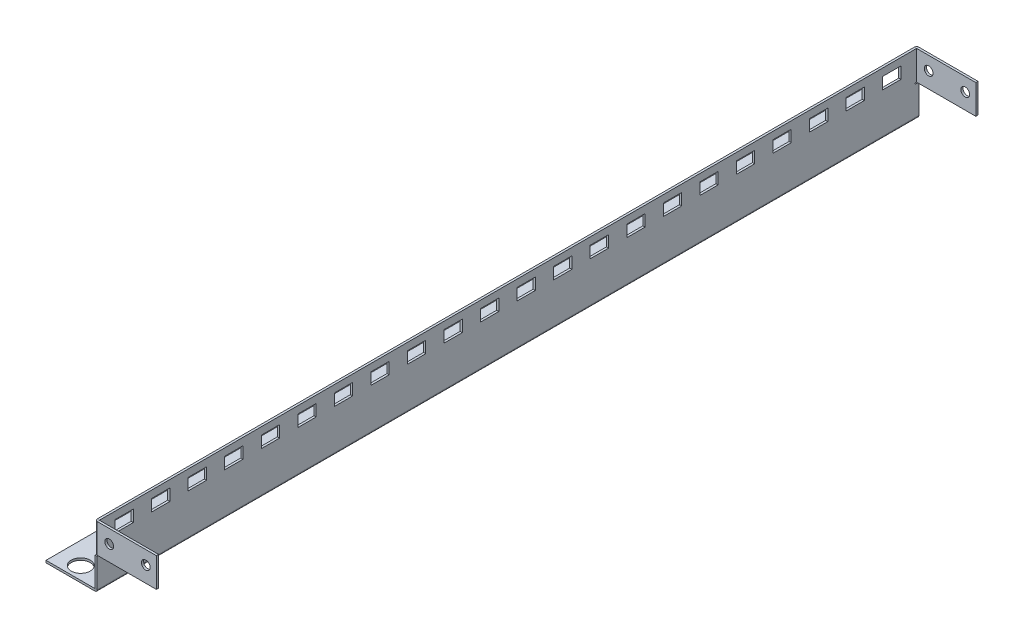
ISO-10303-21;
HEADER;
FILE_DESCRIPTION(('STEP AP214'),'2;1');
FILE_NAME('part.step','',(''),(''),'','','');
FILE_SCHEMA(('AUTOMOTIVE_DESIGN { 1 0 10303 214 1 1 1 1 }'));
ENDSEC;
DATA;
#1=APPLICATION_CONTEXT('core data for automotive mechanical design processes');
#2=APPLICATION_PROTOCOL_DEFINITION('international standard','automotive_design',2000,#1);
#3=PRODUCT_CONTEXT('',#1,'mechanical');
#4=PRODUCT('Part','Part','',(#3));
#5=PRODUCT_RELATED_PRODUCT_CATEGORY('part','',(#4));
#6=PRODUCT_DEFINITION_FORMATION('','',#4);
#7=PRODUCT_DEFINITION_CONTEXT('part definition',#1,'design');
#8=PRODUCT_DEFINITION('design','',#6,#7);
#9=PRODUCT_DEFINITION_SHAPE('','',#8);
#10=(LENGTH_UNIT() NAMED_UNIT(*) SI_UNIT(.MILLI.,.METRE.));
#11=(NAMED_UNIT(*) PLANE_ANGLE_UNIT() SI_UNIT($,.RADIAN.));
#12=(NAMED_UNIT(*) SI_UNIT($,.STERADIAN.) SOLID_ANGLE_UNIT());
#13=UNCERTAINTY_MEASURE_WITH_UNIT(LENGTH_MEASURE(1.E-05),#10,'distance_accuracy_value','');
#14=(GEOMETRIC_REPRESENTATION_CONTEXT(3) GLOBAL_UNCERTAINTY_ASSIGNED_CONTEXT((#13)) GLOBAL_UNIT_ASSIGNED_CONTEXT((#10,
#11,#12)) REPRESENTATION_CONTEXT('',''));
#15=CARTESIAN_POINT('',(0.,0.,0.));
#16=DIRECTION('',(0.,0.,1.));
#17=DIRECTION('',(1.,0.,0.));
#18=AXIS2_PLACEMENT_3D('',#15,#16,#17);
#19=CARTESIAN_POINT('',(1.5,21.,281.));
#20=DIRECTION('',(1.,0.,0.));
#21=DIRECTION('',(0.,0.,-1.));
#22=AXIS2_PLACEMENT_3D('',#19,#20,#21);
#23=PLANE('',#22);
#24=DIRECTION('',(0.,1.,0.));
#25=VECTOR('',#24,1.);
#26=CARTESIAN_POINT('',(1.5,8.00000000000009,231.25));
#27=LINE('',#26,#25);
#28=CARTESIAN_POINT('',(1.5,8.00000000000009,231.25));
#29=VERTEX_POINT('',#28);
#30=CARTESIAN_POINT('',(1.5,16.0000000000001,231.25));
#31=VERTEX_POINT('',#30);
#32=EDGE_CURVE('E961',#29,#31,#27,.T.);
#33=ORIENTED_EDGE('',*,*,#32,.F.);
#34=DIRECTION('',(0.,0.,-1.));
#35=VECTOR('',#34,1.);
#36=CARTESIAN_POINT('',(1.5,8.00000000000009,243.75));
#37=LINE('',#36,#35);
#38=CARTESIAN_POINT('',(1.5,8.00000000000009,243.75));
#39=VERTEX_POINT('',#38);
#40=EDGE_CURVE('E953',#39,#29,#37,.T.);
#41=ORIENTED_EDGE('',*,*,#40,.F.);
#42=DIRECTION('',(0.,-1.,0.));
#43=VECTOR('',#42,1.);
#44=CARTESIAN_POINT('',(1.5,8.00000000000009,243.75));
#45=LINE('',#44,#43);
#46=CARTESIAN_POINT('',(1.5,16.0000000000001,243.75));
#47=VERTEX_POINT('',#46);
#48=EDGE_CURVE('E945',#47,#39,#45,.T.);
#49=ORIENTED_EDGE('',*,*,#48,.F.);
#50=DIRECTION('',(0.,0.,1.));
#51=VECTOR('',#50,1.);
#52=CARTESIAN_POINT('',(1.5,16.0000000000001,243.75));
#53=LINE('',#52,#51);
#54=EDGE_CURVE('E920',#31,#47,#53,.T.);
#55=ORIENTED_EDGE('',*,*,#54,.F.);
#56=EDGE_LOOP('',(#33,#41,#49,#55));
#57=FACE_BOUND('',#56,.T.);
#58=DIRECTION('',(0.,1.,0.));
#59=VECTOR('',#58,1.);
#60=CARTESIAN_POINT('',(1.5,8.00000000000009,256.25));
#61=LINE('',#60,#59);
#62=CARTESIAN_POINT('',(1.5,8.00000000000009,256.25));
#63=VERTEX_POINT('',#62);
#64=CARTESIAN_POINT('',(1.5,16.0000000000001,256.25));
#65=VERTEX_POINT('',#64);
#66=EDGE_CURVE('E966',#63,#65,#61,.T.);
#67=ORIENTED_EDGE('',*,*,#66,.F.);
#68=DIRECTION('',(0.,0.,-1.));
#69=VECTOR('',#68,1.);
#70=CARTESIAN_POINT('',(1.5,8.00000000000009,268.75));
#71=LINE('',#70,#69);
#72=CARTESIAN_POINT('',(1.5,8.00000000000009,268.75));
#73=VERTEX_POINT('',#72);
#74=EDGE_CURVE('E974',#73,#63,#71,.T.);
#75=ORIENTED_EDGE('',*,*,#74,.F.);
#76=DIRECTION('',(0.,-1.,0.));
#77=VECTOR('',#76,1.);
#78=CARTESIAN_POINT('',(1.5,8.00000000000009,268.75));
#79=LINE('',#78,#77);
#80=CARTESIAN_POINT('',(1.5,16.0000000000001,268.75));
#81=VERTEX_POINT('',#80);
#82=EDGE_CURVE('E971',#81,#73,#79,.T.);
#83=ORIENTED_EDGE('',*,*,#82,.F.);
#84=DIRECTION('',(0.,0.,1.));
#85=VECTOR('',#84,1.);
#86=CARTESIAN_POINT('',(1.5,16.0000000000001,268.75));
#87=LINE('',#86,#85);
#88=EDGE_CURVE('E968',#65,#81,#87,.T.);
#89=ORIENTED_EDGE('',*,*,#88,.F.);
#90=EDGE_LOOP('',(#67,#75,#83,#89));
#91=FACE_BOUND('',#90,.T.);
#92=DIRECTION('',(0.,1.,0.));
#93=VECTOR('',#92,1.);
#94=CARTESIAN_POINT('',(1.5,8.00000000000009,206.25));
#95=LINE('',#94,#93);
#96=CARTESIAN_POINT('',(1.5,8.00000000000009,206.25));
#97=VERTEX_POINT('',#96);
#98=CARTESIAN_POINT('',(1.5,16.0000000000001,206.25));
#99=VERTEX_POINT('',#98);
#100=EDGE_CURVE('E1067',#97,#99,#95,.T.);
#101=ORIENTED_EDGE('',*,*,#100,.F.);
#102=DIRECTION('',(0.,0.,-1.));
#103=VECTOR('',#102,1.);
#104=CARTESIAN_POINT('',(1.5,8.00000000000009,218.75));
#105=LINE('',#104,#103);
#106=CARTESIAN_POINT('',(1.5,8.00000000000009,218.75));
#107=VERTEX_POINT('',#106);
#108=EDGE_CURVE('E1069',#107,#97,#105,.T.);
#109=ORIENTED_EDGE('',*,*,#108,.F.);
#110=DIRECTION('',(0.,-1.,0.));
#111=VECTOR('',#110,1.);
#112=CARTESIAN_POINT('',(1.5,8.00000000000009,218.75));
#113=LINE('',#112,#111);
#114=CARTESIAN_POINT('',(1.5,16.0000000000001,218.75));
#115=VERTEX_POINT('',#114);
#116=EDGE_CURVE('E1072',#115,#107,#113,.T.);
#117=ORIENTED_EDGE('',*,*,#116,.F.);
#118=DIRECTION('',(0.,0.,1.));
#119=VECTOR('',#118,1.);
#120=CARTESIAN_POINT('',(1.5,16.0000000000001,218.75));
#121=LINE('',#120,#119);
#122=EDGE_CURVE('E1075',#99,#115,#121,.T.);
#123=ORIENTED_EDGE('',*,*,#122,.F.);
#124=EDGE_LOOP('',(#101,#109,#117,#123));
#125=FACE_BOUND('',#124,.T.);
#126=DIRECTION('',(0.,1.,0.));
#127=VECTOR('',#126,1.);
#128=CARTESIAN_POINT('',(1.5,8.00000000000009,181.25));
#129=LINE('',#128,#127);
#130=CARTESIAN_POINT('',(1.5,8.00000000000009,181.25));
#131=VERTEX_POINT('',#130);
#132=CARTESIAN_POINT('',(1.5,16.0000000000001,181.25));
#133=VERTEX_POINT('',#132);
#134=EDGE_CURVE('E1099',#131,#133,#129,.T.);
#135=ORIENTED_EDGE('',*,*,#134,.F.);
#136=DIRECTION('',(0.,0.,-1.));
#137=VECTOR('',#136,1.);
#138=CARTESIAN_POINT('',(1.5,8.00000000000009,193.75));
#139=LINE('',#138,#137);
#140=CARTESIAN_POINT('',(1.5,8.00000000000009,193.75));
#141=VERTEX_POINT('',#140);
#142=EDGE_CURVE('E1101',#141,#131,#139,.T.);
#143=ORIENTED_EDGE('',*,*,#142,.F.);
#144=DIRECTION('',(0.,-1.,0.));
#145=VECTOR('',#144,1.);
#146=CARTESIAN_POINT('',(1.5,8.00000000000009,193.75));
#147=LINE('',#146,#145);
#148=CARTESIAN_POINT('',(1.5,16.0000000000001,193.75));
#149=VERTEX_POINT('',#148);
#150=EDGE_CURVE('E1104',#149,#141,#147,.T.);
#151=ORIENTED_EDGE('',*,*,#150,.F.);
#152=DIRECTION('',(0.,0.,1.));
#153=VECTOR('',#152,1.);
#154=CARTESIAN_POINT('',(1.5,16.0000000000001,193.75));
#155=LINE('',#154,#153);
#156=EDGE_CURVE('E1107',#133,#149,#155,.T.);
#157=ORIENTED_EDGE('',*,*,#156,.F.);
#158=EDGE_LOOP('',(#135,#143,#151,#157));
#159=FACE_BOUND('',#158,.T.);
#160=DIRECTION('',(0.,1.,0.));
#161=VECTOR('',#160,1.);
#162=CARTESIAN_POINT('',(1.5,8.00000000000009,156.25));
#163=LINE('',#162,#161);
#164=CARTESIAN_POINT('',(1.5,8.00000000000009,156.25));
#165=VERTEX_POINT('',#164);
#166=CARTESIAN_POINT('',(1.5,16.0000000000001,156.25));
#167=VERTEX_POINT('',#166);
#168=EDGE_CURVE('E1131',#165,#167,#163,.T.);
#169=ORIENTED_EDGE('',*,*,#168,.F.);
#170=DIRECTION('',(0.,0.,-1.));
#171=VECTOR('',#170,1.);
#172=CARTESIAN_POINT('',(1.5,8.00000000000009,168.75));
#173=LINE('',#172,#171);
#174=CARTESIAN_POINT('',(1.5,8.00000000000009,168.75));
#175=VERTEX_POINT('',#174);
#176=EDGE_CURVE('E1133',#175,#165,#173,.T.);
#177=ORIENTED_EDGE('',*,*,#176,.F.);
#178=DIRECTION('',(0.,-1.,0.));
#179=VECTOR('',#178,1.);
#180=CARTESIAN_POINT('',(1.5,8.00000000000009,168.75));
#181=LINE('',#180,#179);
#182=CARTESIAN_POINT('',(1.5,16.0000000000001,168.75));
#183=VERTEX_POINT('',#182);
#184=EDGE_CURVE('E1136',#183,#175,#181,.T.);
#185=ORIENTED_EDGE('',*,*,#184,.F.);
#186=DIRECTION('',(0.,0.,1.));
#187=VECTOR('',#186,1.);
#188=CARTESIAN_POINT('',(1.5,16.0000000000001,168.75));
#189=LINE('',#188,#187);
#190=EDGE_CURVE('E1139',#167,#183,#189,.T.);
#191=ORIENTED_EDGE('',*,*,#190,.F.);
#192=EDGE_LOOP('',(#169,#177,#185,#191));
#193=FACE_BOUND('',#192,.T.);
#194=DIRECTION('',(0.,1.,0.));
#195=VECTOR('',#194,1.);
#196=CARTESIAN_POINT('',(1.5,8.00000000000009,131.25));
#197=LINE('',#196,#195);
#198=CARTESIAN_POINT('',(1.5,8.00000000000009,131.25));
#199=VERTEX_POINT('',#198);
#200=CARTESIAN_POINT('',(1.5,16.0000000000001,131.25));
#201=VERTEX_POINT('',#200);
#202=EDGE_CURVE('E1163',#199,#201,#197,.T.);
#203=ORIENTED_EDGE('',*,*,#202,.F.);
#204=DIRECTION('',(0.,0.,-1.));
#205=VECTOR('',#204,1.);
#206=CARTESIAN_POINT('',(1.5,8.00000000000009,143.75));
#207=LINE('',#206,#205);
#208=CARTESIAN_POINT('',(1.5,8.00000000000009,143.75));
#209=VERTEX_POINT('',#208);
#210=EDGE_CURVE('E1165',#209,#199,#207,.T.);
#211=ORIENTED_EDGE('',*,*,#210,.F.);
#212=DIRECTION('',(0.,-1.,0.));
#213=VECTOR('',#212,1.);
#214=CARTESIAN_POINT('',(1.5,8.00000000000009,143.75));
#215=LINE('',#214,#213);
#216=CARTESIAN_POINT('',(1.5,16.0000000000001,143.75));
#217=VERTEX_POINT('',#216);
#218=EDGE_CURVE('E1168',#217,#209,#215,.T.);
#219=ORIENTED_EDGE('',*,*,#218,.F.);
#220=DIRECTION('',(0.,0.,1.));
#221=VECTOR('',#220,1.);
#222=CARTESIAN_POINT('',(1.5,16.0000000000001,143.75));
#223=LINE('',#222,#221);
#224=EDGE_CURVE('E1171',#201,#217,#223,.T.);
#225=ORIENTED_EDGE('',*,*,#224,.F.);
#226=EDGE_LOOP('',(#203,#211,#219,#225));
#227=FACE_BOUND('',#226,.T.);
#228=DIRECTION('',(0.,1.,0.));
#229=VECTOR('',#228,1.);
#230=CARTESIAN_POINT('',(1.5,8.00000000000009,106.25));
#231=LINE('',#230,#229);
#232=CARTESIAN_POINT('',(1.5,8.00000000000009,106.25));
#233=VERTEX_POINT('',#232);
#234=CARTESIAN_POINT('',(1.5,16.0000000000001,106.25));
#235=VERTEX_POINT('',#234);
#236=EDGE_CURVE('E1195',#233,#235,#231,.T.);
#237=ORIENTED_EDGE('',*,*,#236,.F.);
#238=DIRECTION('',(0.,0.,-1.));
#239=VECTOR('',#238,1.);
#240=CARTESIAN_POINT('',(1.5,8.00000000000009,118.75));
#241=LINE('',#240,#239);
#242=CARTESIAN_POINT('',(1.5,8.00000000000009,118.75));
#243=VERTEX_POINT('',#242);
#244=EDGE_CURVE('E1197',#243,#233,#241,.T.);
#245=ORIENTED_EDGE('',*,*,#244,.F.);
#246=DIRECTION('',(0.,-1.,0.));
#247=VECTOR('',#246,1.);
#248=CARTESIAN_POINT('',(1.5,8.00000000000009,118.75));
#249=LINE('',#248,#247);
#250=CARTESIAN_POINT('',(1.5,16.0000000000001,118.75));
#251=VERTEX_POINT('',#250);
#252=EDGE_CURVE('E1200',#251,#243,#249,.T.);
#253=ORIENTED_EDGE('',*,*,#252,.F.);
#254=DIRECTION('',(0.,0.,1.));
#255=VECTOR('',#254,1.);
#256=CARTESIAN_POINT('',(1.5,16.0000000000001,118.75));
#257=LINE('',#256,#255);
#258=EDGE_CURVE('E1203',#235,#251,#257,.T.);
#259=ORIENTED_EDGE('',*,*,#258,.F.);
#260=EDGE_LOOP('',(#237,#245,#253,#259));
#261=FACE_BOUND('',#260,.T.);
#262=DIRECTION('',(0.,1.,0.));
#263=VECTOR('',#262,1.);
#264=CARTESIAN_POINT('',(1.5,8.00000000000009,81.2500000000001));
#265=LINE('',#264,#263);
#266=CARTESIAN_POINT('',(1.5,8.00000000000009,81.2500000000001));
#267=VERTEX_POINT('',#266);
#268=CARTESIAN_POINT('',(1.5,16.0000000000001,81.2500000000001));
#269=VERTEX_POINT('',#268);
#270=EDGE_CURVE('E1227',#267,#269,#265,.T.);
#271=ORIENTED_EDGE('',*,*,#270,.F.);
#272=DIRECTION('',(0.,0.,-1.));
#273=VECTOR('',#272,1.);
#274=CARTESIAN_POINT('',(1.5,8.00000000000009,93.7500000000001));
#275=LINE('',#274,#273);
#276=CARTESIAN_POINT('',(1.5,8.00000000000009,93.7500000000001));
#277=VERTEX_POINT('',#276);
#278=EDGE_CURVE('E1229',#277,#267,#275,.T.);
#279=ORIENTED_EDGE('',*,*,#278,.F.);
#280=DIRECTION('',(0.,-1.,0.));
#281=VECTOR('',#280,1.);
#282=CARTESIAN_POINT('',(1.5,8.00000000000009,93.7500000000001));
#283=LINE('',#282,#281);
#284=CARTESIAN_POINT('',(1.5,16.0000000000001,93.7500000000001));
#285=VERTEX_POINT('',#284);
#286=EDGE_CURVE('E1232',#285,#277,#283,.T.);
#287=ORIENTED_EDGE('',*,*,#286,.F.);
#288=DIRECTION('',(0.,0.,1.));
#289=VECTOR('',#288,1.);
#290=CARTESIAN_POINT('',(1.5,16.0000000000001,93.7500000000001));
#291=LINE('',#290,#289);
#292=EDGE_CURVE('E1235',#269,#285,#291,.T.);
#293=ORIENTED_EDGE('',*,*,#292,.F.);
#294=EDGE_LOOP('',(#271,#279,#287,#293));
#295=FACE_BOUND('',#294,.T.);
#296=DIRECTION('',(0.,1.,0.));
#297=VECTOR('',#296,1.);
#298=CARTESIAN_POINT('',(1.5,8.00000000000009,56.2500000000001));
#299=LINE('',#298,#297);
#300=CARTESIAN_POINT('',(1.5,8.00000000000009,56.2500000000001));
#301=VERTEX_POINT('',#300);
#302=CARTESIAN_POINT('',(1.5,16.0000000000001,56.2500000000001));
#303=VERTEX_POINT('',#302);
#304=EDGE_CURVE('E1259',#301,#303,#299,.T.);
#305=ORIENTED_EDGE('',*,*,#304,.F.);
#306=DIRECTION('',(0.,0.,-1.));
#307=VECTOR('',#306,1.);
#308=CARTESIAN_POINT('',(1.5,8.00000000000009,68.7500000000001));
#309=LINE('',#308,#307);
#310=CARTESIAN_POINT('',(1.5,8.00000000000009,68.7500000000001));
#311=VERTEX_POINT('',#310);
#312=EDGE_CURVE('E1261',#311,#301,#309,.T.);
#313=ORIENTED_EDGE('',*,*,#312,.F.);
#314=DIRECTION('',(0.,-1.,0.));
#315=VECTOR('',#314,1.);
#316=CARTESIAN_POINT('',(1.5,8.00000000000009,68.7500000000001));
#317=LINE('',#316,#315);
#318=CARTESIAN_POINT('',(1.5,16.0000000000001,68.7500000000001));
#319=VERTEX_POINT('',#318);
#320=EDGE_CURVE('E1264',#319,#311,#317,.T.);
#321=ORIENTED_EDGE('',*,*,#320,.F.);
#322=DIRECTION('',(0.,0.,1.));
#323=VECTOR('',#322,1.);
#324=CARTESIAN_POINT('',(1.5,16.0000000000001,68.7500000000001));
#325=LINE('',#324,#323);
#326=EDGE_CURVE('E1267',#303,#319,#325,.T.);
#327=ORIENTED_EDGE('',*,*,#326,.F.);
#328=EDGE_LOOP('',(#305,#313,#321,#327));
#329=FACE_BOUND('',#328,.T.);
#330=DIRECTION('',(0.,1.,0.));
#331=VECTOR('',#330,1.);
#332=CARTESIAN_POINT('',(1.5,8.00000000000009,31.2500000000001));
#333=LINE('',#332,#331);
#334=CARTESIAN_POINT('',(1.5,8.00000000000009,31.2500000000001));
#335=VERTEX_POINT('',#334);
#336=CARTESIAN_POINT('',(1.5,16.0000000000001,31.2500000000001));
#337=VERTEX_POINT('',#336);
#338=EDGE_CURVE('E1291',#335,#337,#333,.T.);
#339=ORIENTED_EDGE('',*,*,#338,.F.);
#340=DIRECTION('',(0.,0.,-1.));
#341=VECTOR('',#340,1.);
#342=CARTESIAN_POINT('',(1.5,8.00000000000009,43.7500000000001));
#343=LINE('',#342,#341);
#344=CARTESIAN_POINT('',(1.5,8.00000000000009,43.7500000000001));
#345=VERTEX_POINT('',#344);
#346=EDGE_CURVE('E1293',#345,#335,#343,.T.);
#347=ORIENTED_EDGE('',*,*,#346,.F.);
#348=DIRECTION('',(0.,-1.,0.));
#349=VECTOR('',#348,1.);
#350=CARTESIAN_POINT('',(1.5,8.00000000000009,43.7500000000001));
#351=LINE('',#350,#349);
#352=CARTESIAN_POINT('',(1.5,16.0000000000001,43.7500000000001));
#353=VERTEX_POINT('',#352);
#354=EDGE_CURVE('E1296',#353,#345,#351,.T.);
#355=ORIENTED_EDGE('',*,*,#354,.F.);
#356=DIRECTION('',(0.,0.,1.));
#357=VECTOR('',#356,1.);
#358=CARTESIAN_POINT('',(1.5,16.0000000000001,43.7500000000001));
#359=LINE('',#358,#357);
#360=EDGE_CURVE('E1299',#337,#353,#359,.T.);
#361=ORIENTED_EDGE('',*,*,#360,.F.);
#362=EDGE_LOOP('',(#339,#347,#355,#361));
#363=FACE_BOUND('',#362,.T.);
#364=DIRECTION('',(0.,1.,0.));
#365=VECTOR('',#364,1.);
#366=CARTESIAN_POINT('',(1.5,8.00000000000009,6.25000000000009));
#367=LINE('',#366,#365);
#368=CARTESIAN_POINT('',(1.5,8.00000000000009,6.25000000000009));
#369=VERTEX_POINT('',#368);
#370=CARTESIAN_POINT('',(1.5,16.0000000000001,6.25000000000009));
#371=VERTEX_POINT('',#370);
#372=EDGE_CURVE('E1323',#369,#371,#367,.T.);
#373=ORIENTED_EDGE('',*,*,#372,.F.);
#374=DIRECTION('',(0.,0.,-1.));
#375=VECTOR('',#374,1.);
#376=CARTESIAN_POINT('',(1.5,8.00000000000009,18.7500000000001));
#377=LINE('',#376,#375);
#378=CARTESIAN_POINT('',(1.5,8.00000000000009,18.7500000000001));
#379=VERTEX_POINT('',#378);
#380=EDGE_CURVE('E1325',#379,#369,#377,.T.);
#381=ORIENTED_EDGE('',*,*,#380,.F.);
#382=DIRECTION('',(0.,-1.,0.));
#383=VECTOR('',#382,1.);
#384=CARTESIAN_POINT('',(1.5,8.00000000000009,18.7500000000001));
#385=LINE('',#384,#383);
#386=CARTESIAN_POINT('',(1.5,16.0000000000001,18.7500000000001));
#387=VERTEX_POINT('',#386);
#388=EDGE_CURVE('E1328',#387,#379,#385,.T.);
#389=ORIENTED_EDGE('',*,*,#388,.F.);
#390=DIRECTION('',(0.,0.,1.));
#391=VECTOR('',#390,1.);
#392=CARTESIAN_POINT('',(1.5,16.0000000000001,18.7500000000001));
#393=LINE('',#392,#391);
#394=EDGE_CURVE('E1331',#371,#387,#393,.T.);
#395=ORIENTED_EDGE('',*,*,#394,.F.);
#396=EDGE_LOOP('',(#373,#381,#389,#395));
#397=FACE_BOUND('',#396,.T.);
#398=DIRECTION('',(0.,1.,0.));
#399=VECTOR('',#398,1.);
#400=CARTESIAN_POINT('',(1.5,8.00000000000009,-18.7499999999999));
#401=LINE('',#400,#399);
#402=CARTESIAN_POINT('',(1.5,8.00000000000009,-18.7499999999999));
#403=VERTEX_POINT('',#402);
#404=CARTESIAN_POINT('',(1.5,16.0000000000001,-18.7499999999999));
#405=VERTEX_POINT('',#404);
#406=EDGE_CURVE('E1355',#403,#405,#401,.T.);
#407=ORIENTED_EDGE('',*,*,#406,.F.);
#408=DIRECTION('',(0.,0.,-1.));
#409=VECTOR('',#408,1.);
#410=CARTESIAN_POINT('',(1.5,8.00000000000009,-6.24999999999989));
#411=LINE('',#410,#409);
#412=CARTESIAN_POINT('',(1.5,8.00000000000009,-6.24999999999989));
#413=VERTEX_POINT('',#412);
#414=EDGE_CURVE('E1357',#413,#403,#411,.T.);
#415=ORIENTED_EDGE('',*,*,#414,.F.);
#416=DIRECTION('',(0.,-1.,0.));
#417=VECTOR('',#416,1.);
#418=CARTESIAN_POINT('',(1.5,8.00000000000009,-6.24999999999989));
#419=LINE('',#418,#417);
#420=CARTESIAN_POINT('',(1.5,16.0000000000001,-6.24999999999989));
#421=VERTEX_POINT('',#420);
#422=EDGE_CURVE('E1360',#421,#413,#419,.T.);
#423=ORIENTED_EDGE('',*,*,#422,.F.);
#424=DIRECTION('',(0.,0.,1.));
#425=VECTOR('',#424,1.);
#426=CARTESIAN_POINT('',(1.5,16.0000000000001,-6.24999999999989));
#427=LINE('',#426,#425);
#428=EDGE_CURVE('E1363',#405,#421,#427,.T.);
#429=ORIENTED_EDGE('',*,*,#428,.F.);
#430=EDGE_LOOP('',(#407,#415,#423,#429));
#431=FACE_BOUND('',#430,.T.);
#432=DIRECTION('',(0.,1.,0.));
#433=VECTOR('',#432,1.);
#434=CARTESIAN_POINT('',(1.5,8.00000000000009,-43.7499999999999));
#435=LINE('',#434,#433);
#436=CARTESIAN_POINT('',(1.5,8.00000000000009,-43.7499999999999));
#437=VERTEX_POINT('',#436);
#438=CARTESIAN_POINT('',(1.5,16.0000000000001,-43.7499999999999));
#439=VERTEX_POINT('',#438);
#440=EDGE_CURVE('E1387',#437,#439,#435,.T.);
#441=ORIENTED_EDGE('',*,*,#440,.F.);
#442=DIRECTION('',(0.,0.,-1.));
#443=VECTOR('',#442,1.);
#444=CARTESIAN_POINT('',(1.5,8.00000000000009,-31.2499999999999));
#445=LINE('',#444,#443);
#446=CARTESIAN_POINT('',(1.5,8.00000000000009,-31.2499999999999));
#447=VERTEX_POINT('',#446);
#448=EDGE_CURVE('E1389',#447,#437,#445,.T.);
#449=ORIENTED_EDGE('',*,*,#448,.F.);
#450=DIRECTION('',(0.,-1.,0.));
#451=VECTOR('',#450,1.);
#452=CARTESIAN_POINT('',(1.5,8.00000000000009,-31.2499999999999));
#453=LINE('',#452,#451);
#454=CARTESIAN_POINT('',(1.5,16.0000000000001,-31.2499999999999));
#455=VERTEX_POINT('',#454);
#456=EDGE_CURVE('E1392',#455,#447,#453,.T.);
#457=ORIENTED_EDGE('',*,*,#456,.F.);
#458=DIRECTION('',(0.,0.,1.));
#459=VECTOR('',#458,1.);
#460=CARTESIAN_POINT('',(1.5,16.0000000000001,-31.2499999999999));
#461=LINE('',#460,#459);
#462=EDGE_CURVE('E1395',#439,#455,#461,.T.);
#463=ORIENTED_EDGE('',*,*,#462,.F.);
#464=EDGE_LOOP('',(#441,#449,#457,#463));
#465=FACE_BOUND('',#464,.T.);
#466=DIRECTION('',(0.,1.,0.));
#467=VECTOR('',#466,1.);
#468=CARTESIAN_POINT('',(1.5,8.00000000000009,-68.7499999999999));
#469=LINE('',#468,#467);
#470=CARTESIAN_POINT('',(1.5,8.00000000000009,-68.7499999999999));
#471=VERTEX_POINT('',#470);
#472=CARTESIAN_POINT('',(1.5,16.0000000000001,-68.7499999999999));
#473=VERTEX_POINT('',#472);
#474=EDGE_CURVE('E1419',#471,#473,#469,.T.);
#475=ORIENTED_EDGE('',*,*,#474,.F.);
#476=DIRECTION('',(0.,0.,-1.));
#477=VECTOR('',#476,1.);
#478=CARTESIAN_POINT('',(1.5,8.00000000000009,-56.2499999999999));
#479=LINE('',#478,#477);
#480=CARTESIAN_POINT('',(1.5,8.00000000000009,-56.2499999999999));
#481=VERTEX_POINT('',#480);
#482=EDGE_CURVE('E1421',#481,#471,#479,.T.);
#483=ORIENTED_EDGE('',*,*,#482,.F.);
#484=DIRECTION('',(0.,-1.,0.));
#485=VECTOR('',#484,1.);
#486=CARTESIAN_POINT('',(1.5,8.00000000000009,-56.2499999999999));
#487=LINE('',#486,#485);
#488=CARTESIAN_POINT('',(1.5,16.0000000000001,-56.2499999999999));
#489=VERTEX_POINT('',#488);
#490=EDGE_CURVE('E1424',#489,#481,#487,.T.);
#491=ORIENTED_EDGE('',*,*,#490,.F.);
#492=DIRECTION('',(0.,0.,1.));
#493=VECTOR('',#492,1.);
#494=CARTESIAN_POINT('',(1.5,16.0000000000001,-56.2499999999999));
#495=LINE('',#494,#493);
#496=EDGE_CURVE('E1427',#473,#489,#495,.T.);
#497=ORIENTED_EDGE('',*,*,#496,.F.);
#498=EDGE_LOOP('',(#475,#483,#491,#497));
#499=FACE_BOUND('',#498,.T.);
#500=DIRECTION('',(0.,1.,0.));
#501=VECTOR('',#500,1.);
#502=CARTESIAN_POINT('',(1.5,8.00000000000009,-93.7499999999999));
#503=LINE('',#502,#501);
#504=CARTESIAN_POINT('',(1.5,8.00000000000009,-93.7499999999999));
#505=VERTEX_POINT('',#504);
#506=CARTESIAN_POINT('',(1.5,16.0000000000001,-93.7499999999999));
#507=VERTEX_POINT('',#506);
#508=EDGE_CURVE('E1451',#505,#507,#503,.T.);
#509=ORIENTED_EDGE('',*,*,#508,.F.);
#510=DIRECTION('',(0.,0.,-1.));
#511=VECTOR('',#510,1.);
#512=CARTESIAN_POINT('',(1.5,8.00000000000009,-81.2499999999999));
#513=LINE('',#512,#511);
#514=CARTESIAN_POINT('',(1.5,8.00000000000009,-81.2499999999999));
#515=VERTEX_POINT('',#514);
#516=EDGE_CURVE('E1453',#515,#505,#513,.T.);
#517=ORIENTED_EDGE('',*,*,#516,.F.);
#518=DIRECTION('',(0.,-1.,0.));
#519=VECTOR('',#518,1.);
#520=CARTESIAN_POINT('',(1.5,8.00000000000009,-81.2499999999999));
#521=LINE('',#520,#519);
#522=CARTESIAN_POINT('',(1.5,16.0000000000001,-81.2499999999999));
#523=VERTEX_POINT('',#522);
#524=EDGE_CURVE('E1456',#523,#515,#521,.T.);
#525=ORIENTED_EDGE('',*,*,#524,.F.);
#526=DIRECTION('',(0.,0.,1.));
#527=VECTOR('',#526,1.);
#528=CARTESIAN_POINT('',(1.5,16.0000000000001,-81.2499999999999));
#529=LINE('',#528,#527);
#530=EDGE_CURVE('E1459',#507,#523,#529,.T.);
#531=ORIENTED_EDGE('',*,*,#530,.F.);
#532=EDGE_LOOP('',(#509,#517,#525,#531));
#533=FACE_BOUND('',#532,.T.);
#534=DIRECTION('',(0.,1.,0.));
#535=VECTOR('',#534,1.);
#536=CARTESIAN_POINT('',(1.5,8.00000000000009,-118.75));
#537=LINE('',#536,#535);
#538=CARTESIAN_POINT('',(1.5,8.00000000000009,-118.75));
#539=VERTEX_POINT('',#538);
#540=CARTESIAN_POINT('',(1.5,16.0000000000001,-118.75));
#541=VERTEX_POINT('',#540);
#542=EDGE_CURVE('E1483',#539,#541,#537,.T.);
#543=ORIENTED_EDGE('',*,*,#542,.F.);
#544=DIRECTION('',(0.,0.,-1.));
#545=VECTOR('',#544,1.);
#546=CARTESIAN_POINT('',(1.5,8.00000000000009,-106.25));
#547=LINE('',#546,#545);
#548=CARTESIAN_POINT('',(1.5,8.00000000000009,-106.25));
#549=VERTEX_POINT('',#548);
#550=EDGE_CURVE('E1485',#549,#539,#547,.T.);
#551=ORIENTED_EDGE('',*,*,#550,.F.);
#552=DIRECTION('',(0.,-1.,0.));
#553=VECTOR('',#552,1.);
#554=CARTESIAN_POINT('',(1.5,8.00000000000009,-106.25));
#555=LINE('',#554,#553);
#556=CARTESIAN_POINT('',(1.5,16.0000000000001,-106.25));
#557=VERTEX_POINT('',#556);
#558=EDGE_CURVE('E1488',#557,#549,#555,.T.);
#559=ORIENTED_EDGE('',*,*,#558,.F.);
#560=DIRECTION('',(0.,0.,1.));
#561=VECTOR('',#560,1.);
#562=CARTESIAN_POINT('',(1.5,16.0000000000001,-106.25));
#563=LINE('',#562,#561);
#564=EDGE_CURVE('E1491',#541,#557,#563,.T.);
#565=ORIENTED_EDGE('',*,*,#564,.F.);
#566=EDGE_LOOP('',(#543,#551,#559,#565));
#567=FACE_BOUND('',#566,.T.);
#568=DIRECTION('',(0.,1.,0.));
#569=VECTOR('',#568,1.);
#570=CARTESIAN_POINT('',(1.5,8.00000000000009,-143.75));
#571=LINE('',#570,#569);
#572=CARTESIAN_POINT('',(1.5,8.00000000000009,-143.75));
#573=VERTEX_POINT('',#572);
#574=CARTESIAN_POINT('',(1.5,16.0000000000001,-143.75));
#575=VERTEX_POINT('',#574);
#576=EDGE_CURVE('E1515',#573,#575,#571,.T.);
#577=ORIENTED_EDGE('',*,*,#576,.F.);
#578=DIRECTION('',(0.,0.,-1.));
#579=VECTOR('',#578,1.);
#580=CARTESIAN_POINT('',(1.5,8.00000000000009,-131.25));
#581=LINE('',#580,#579);
#582=CARTESIAN_POINT('',(1.5,8.00000000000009,-131.25));
#583=VERTEX_POINT('',#582);
#584=EDGE_CURVE('E1517',#583,#573,#581,.T.);
#585=ORIENTED_EDGE('',*,*,#584,.F.);
#586=DIRECTION('',(0.,-1.,0.));
#587=VECTOR('',#586,1.);
#588=CARTESIAN_POINT('',(1.5,8.00000000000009,-131.25));
#589=LINE('',#588,#587);
#590=CARTESIAN_POINT('',(1.5,16.0000000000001,-131.25));
#591=VERTEX_POINT('',#590);
#592=EDGE_CURVE('E1520',#591,#583,#589,.T.);
#593=ORIENTED_EDGE('',*,*,#592,.F.);
#594=DIRECTION('',(0.,0.,1.));
#595=VECTOR('',#594,1.);
#596=CARTESIAN_POINT('',(1.5,16.0000000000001,-131.25));
#597=LINE('',#596,#595);
#598=EDGE_CURVE('E1523',#575,#591,#597,.T.);
#599=ORIENTED_EDGE('',*,*,#598,.F.);
#600=EDGE_LOOP('',(#577,#585,#593,#599));
#601=FACE_BOUND('',#600,.T.);
#602=DIRECTION('',(0.,1.,0.));
#603=VECTOR('',#602,1.);
#604=CARTESIAN_POINT('',(1.5,8.00000000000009,-168.75));
#605=LINE('',#604,#603);
#606=CARTESIAN_POINT('',(1.5,8.00000000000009,-168.75));
#607=VERTEX_POINT('',#606);
#608=CARTESIAN_POINT('',(1.5,16.0000000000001,-168.75));
#609=VERTEX_POINT('',#608);
#610=EDGE_CURVE('E1547',#607,#609,#605,.T.);
#611=ORIENTED_EDGE('',*,*,#610,.F.);
#612=DIRECTION('',(0.,0.,-1.));
#613=VECTOR('',#612,1.);
#614=CARTESIAN_POINT('',(1.5,8.00000000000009,-156.25));
#615=LINE('',#614,#613);
#616=CARTESIAN_POINT('',(1.5,8.00000000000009,-156.25));
#617=VERTEX_POINT('',#616);
#618=EDGE_CURVE('E1549',#617,#607,#615,.T.);
#619=ORIENTED_EDGE('',*,*,#618,.F.);
#620=DIRECTION('',(0.,-1.,0.));
#621=VECTOR('',#620,1.);
#622=CARTESIAN_POINT('',(1.5,8.00000000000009,-156.25));
#623=LINE('',#622,#621);
#624=CARTESIAN_POINT('',(1.5,16.0000000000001,-156.25));
#625=VERTEX_POINT('',#624);
#626=EDGE_CURVE('E1552',#625,#617,#623,.T.);
#627=ORIENTED_EDGE('',*,*,#626,.F.);
#628=DIRECTION('',(0.,0.,1.));
#629=VECTOR('',#628,1.);
#630=CARTESIAN_POINT('',(1.5,16.0000000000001,-156.25));
#631=LINE('',#630,#629);
#632=EDGE_CURVE('E1555',#609,#625,#631,.T.);
#633=ORIENTED_EDGE('',*,*,#632,.F.);
#634=EDGE_LOOP('',(#611,#619,#627,#633));
#635=FACE_BOUND('',#634,.T.);
#636=DIRECTION('',(0.,1.,0.));
#637=VECTOR('',#636,1.);
#638=CARTESIAN_POINT('',(1.5,8.00000000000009,-193.75));
#639=LINE('',#638,#637);
#640=CARTESIAN_POINT('',(1.5,8.00000000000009,-193.75));
#641=VERTEX_POINT('',#640);
#642=CARTESIAN_POINT('',(1.5,16.0000000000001,-193.75));
#643=VERTEX_POINT('',#642);
#644=EDGE_CURVE('E1579',#641,#643,#639,.T.);
#645=ORIENTED_EDGE('',*,*,#644,.F.);
#646=DIRECTION('',(0.,0.,-1.));
#647=VECTOR('',#646,1.);
#648=CARTESIAN_POINT('',(1.5,8.00000000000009,-181.25));
#649=LINE('',#648,#647);
#650=CARTESIAN_POINT('',(1.5,8.00000000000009,-181.25));
#651=VERTEX_POINT('',#650);
#652=EDGE_CURVE('E1581',#651,#641,#649,.T.);
#653=ORIENTED_EDGE('',*,*,#652,.F.);
#654=DIRECTION('',(0.,-1.,0.));
#655=VECTOR('',#654,1.);
#656=CARTESIAN_POINT('',(1.5,8.00000000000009,-181.25));
#657=LINE('',#656,#655);
#658=CARTESIAN_POINT('',(1.5,16.0000000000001,-181.25));
#659=VERTEX_POINT('',#658);
#660=EDGE_CURVE('E1584',#659,#651,#657,.T.);
#661=ORIENTED_EDGE('',*,*,#660,.F.);
#662=DIRECTION('',(0.,0.,1.));
#663=VECTOR('',#662,1.);
#664=CARTESIAN_POINT('',(1.5,16.0000000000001,-181.25));
#665=LINE('',#664,#663);
#666=EDGE_CURVE('E1587',#643,#659,#665,.T.);
#667=ORIENTED_EDGE('',*,*,#666,.F.);
#668=EDGE_LOOP('',(#645,#653,#661,#667));
#669=FACE_BOUND('',#668,.T.);
#670=DIRECTION('',(0.,1.,0.));
#671=VECTOR('',#670,1.);
#672=CARTESIAN_POINT('',(1.5,8.00000000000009,-218.75));
#673=LINE('',#672,#671);
#674=CARTESIAN_POINT('',(1.5,8.00000000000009,-218.75));
#675=VERTEX_POINT('',#674);
#676=CARTESIAN_POINT('',(1.5,16.0000000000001,-218.75));
#677=VERTEX_POINT('',#676);
#678=EDGE_CURVE('E1611',#675,#677,#673,.T.);
#679=ORIENTED_EDGE('',*,*,#678,.F.);
#680=DIRECTION('',(0.,0.,-1.));
#681=VECTOR('',#680,1.);
#682=CARTESIAN_POINT('',(1.5,8.00000000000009,-206.25));
#683=LINE('',#682,#681);
#684=CARTESIAN_POINT('',(1.5,8.00000000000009,-206.25));
#685=VERTEX_POINT('',#684);
#686=EDGE_CURVE('E1613',#685,#675,#683,.T.);
#687=ORIENTED_EDGE('',*,*,#686,.F.);
#688=DIRECTION('',(0.,-1.,0.));
#689=VECTOR('',#688,1.);
#690=CARTESIAN_POINT('',(1.5,8.00000000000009,-206.25));
#691=LINE('',#690,#689);
#692=CARTESIAN_POINT('',(1.5,16.0000000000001,-206.25));
#693=VERTEX_POINT('',#692);
#694=EDGE_CURVE('E1616',#693,#685,#691,.T.);
#695=ORIENTED_EDGE('',*,*,#694,.F.);
#696=DIRECTION('',(0.,0.,1.));
#697=VECTOR('',#696,1.);
#698=CARTESIAN_POINT('',(1.5,16.0000000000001,-206.25));
#699=LINE('',#698,#697);
#700=EDGE_CURVE('E1619',#677,#693,#699,.T.);
#701=ORIENTED_EDGE('',*,*,#700,.F.);
#702=EDGE_LOOP('',(#679,#687,#695,#701));
#703=FACE_BOUND('',#702,.T.);
#704=DIRECTION('',(0.,1.,0.));
#705=VECTOR('',#704,1.);
#706=CARTESIAN_POINT('',(1.5,8.00000000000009,-243.75));
#707=LINE('',#706,#705);
#708=CARTESIAN_POINT('',(1.5,8.00000000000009,-243.75));
#709=VERTEX_POINT('',#708);
#710=CARTESIAN_POINT('',(1.5,16.0000000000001,-243.75));
#711=VERTEX_POINT('',#710);
#712=EDGE_CURVE('E1643',#709,#711,#707,.T.);
#713=ORIENTED_EDGE('',*,*,#712,.F.);
#714=DIRECTION('',(0.,0.,-1.));
#715=VECTOR('',#714,1.);
#716=CARTESIAN_POINT('',(1.5,8.00000000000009,-231.25));
#717=LINE('',#716,#715);
#718=CARTESIAN_POINT('',(1.5,8.00000000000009,-231.25));
#719=VERTEX_POINT('',#718);
#720=EDGE_CURVE('E1645',#719,#709,#717,.T.);
#721=ORIENTED_EDGE('',*,*,#720,.F.);
#722=DIRECTION('',(0.,-1.,0.));
#723=VECTOR('',#722,1.);
#724=CARTESIAN_POINT('',(1.5,8.00000000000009,-231.25));
#725=LINE('',#724,#723);
#726=CARTESIAN_POINT('',(1.5,16.0000000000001,-231.25));
#727=VERTEX_POINT('',#726);
#728=EDGE_CURVE('E1648',#727,#719,#725,.T.);
#729=ORIENTED_EDGE('',*,*,#728,.F.);
#730=DIRECTION('',(0.,0.,1.));
#731=VECTOR('',#730,1.);
#732=CARTESIAN_POINT('',(1.5,16.0000000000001,-231.25));
#733=LINE('',#732,#731);
#734=EDGE_CURVE('E1651',#711,#727,#733,.T.);
#735=ORIENTED_EDGE('',*,*,#734,.F.);
#736=EDGE_LOOP('',(#713,#721,#729,#735));
#737=FACE_BOUND('',#736,.T.);
#738=DIRECTION('',(0.,1.,0.));
#739=VECTOR('',#738,1.);
#740=CARTESIAN_POINT('',(1.5,8.00000000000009,-268.75));
#741=LINE('',#740,#739);
#742=CARTESIAN_POINT('',(1.5,8.00000000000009,-268.75));
#743=VERTEX_POINT('',#742);
#744=CARTESIAN_POINT('',(1.5,16.0000000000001,-268.75));
#745=VERTEX_POINT('',#744);
#746=EDGE_CURVE('E1675',#743,#745,#741,.T.);
#747=ORIENTED_EDGE('',*,*,#746,.F.);
#748=DIRECTION('',(0.,0.,-1.));
#749=VECTOR('',#748,1.);
#750=CARTESIAN_POINT('',(1.5,8.00000000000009,-256.25));
#751=LINE('',#750,#749);
#752=CARTESIAN_POINT('',(1.5,8.00000000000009,-256.25));
#753=VERTEX_POINT('',#752);
#754=EDGE_CURVE('E1677',#753,#743,#751,.T.);
#755=ORIENTED_EDGE('',*,*,#754,.F.);
#756=DIRECTION('',(0.,-1.,0.));
#757=VECTOR('',#756,1.);
#758=CARTESIAN_POINT('',(1.5,8.00000000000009,-256.25));
#759=LINE('',#758,#757);
#760=CARTESIAN_POINT('',(1.5,16.0000000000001,-256.25));
#761=VERTEX_POINT('',#760);
#762=EDGE_CURVE('E1680',#761,#753,#759,.T.);
#763=ORIENTED_EDGE('',*,*,#762,.F.);
#764=DIRECTION('',(0.,0.,1.));
#765=VECTOR('',#764,1.);
#766=CARTESIAN_POINT('',(1.5,16.0000000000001,-256.25));
#767=LINE('',#766,#765);
#768=EDGE_CURVE('E1683',#745,#761,#767,.T.);
#769=ORIENTED_EDGE('',*,*,#768,.F.);
#770=EDGE_LOOP('',(#747,#755,#763,#769));
#771=FACE_BOUND('',#770,.T.);
#772=CARTESIAN_POINT('',(1.49999999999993,0.624999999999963,278.7));
#773=DIRECTION('',(1.,0.,0.));
#774=DIRECTION('',(0.,0.,-1.));
#775=AXIS2_PLACEMENT_3D('',#772,#773,#774);
#776=CIRCLE('',#775,0.375);
#777=CARTESIAN_POINT('',(1.5,0.249999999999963,278.7));
#778=VERTEX_POINT('',#777);
#779=CARTESIAN_POINT('',(1.5,0.999999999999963,278.7));
#780=VERTEX_POINT('',#779);
#781=EDGE_CURVE('E109',#778,#780,#776,.T.);
#782=ORIENTED_EDGE('',*,*,#781,.F.);
#783=DIRECTION('',(0.,0.,-1.));
#784=VECTOR('',#783,1.);
#785=CARTESIAN_POINT('',(1.49999999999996,0.249999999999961,281.));
#786=LINE('',#785,#784);
#787=CARTESIAN_POINT('',(1.49999999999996,0.249999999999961,281.));
#788=VERTEX_POINT('',#787);
#789=EDGE_CURVE('E848',#788,#778,#786,.T.);
#790=ORIENTED_EDGE('',*,*,#789,.F.);
#791=DIRECTION('',(0.,-1.,0.));
#792=VECTOR('',#791,1.);
#793=CARTESIAN_POINT('',(1.5,-21.,281.));
#794=LINE('',#793,#792);
#795=CARTESIAN_POINT('',(1.49999999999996,-19.4500000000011,281.));
#796=VERTEX_POINT('',#795);
#797=EDGE_CURVE('E1040',#788,#796,#794,.T.);
#798=ORIENTED_EDGE('',*,*,#797,.T.);
#799=DIRECTION('',(0.,0.,1.));
#800=VECTOR('',#799,1.);
#801=CARTESIAN_POINT('',(1.49999999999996,-19.4500000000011,281.));
#802=LINE('',#801,#800);
#803=CARTESIAN_POINT('',(1.5,-19.45,-281.));
#804=VERTEX_POINT('',#803);
#805=EDGE_CURVE('E1017',#796,#804,#802,.F.);
#806=ORIENTED_EDGE('',*,*,#805,.T.);
#807=DIRECTION('',(0.,1.,0.));
#808=VECTOR('',#807,1.);
#809=CARTESIAN_POINT('',(1.5,-21.,-281.));
#810=LINE('',#809,#808);
#811=CARTESIAN_POINT('',(1.5,0.250000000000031,-281.));
#812=VERTEX_POINT('',#811);
#813=EDGE_CURVE('E1042',#804,#812,#810,.T.);
#814=ORIENTED_EDGE('',*,*,#813,.T.);
#815=DIRECTION('',(0.,0.,-1.));
#816=VECTOR('',#815,1.);
#817=CARTESIAN_POINT('',(1.5,0.250000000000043,-278.7));
#818=LINE('',#817,#816);
#819=CARTESIAN_POINT('',(1.5,0.25000000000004,-278.7));
#820=VERTEX_POINT('',#819);
#821=EDGE_CURVE('E925',#820,#812,#818,.T.);
#822=ORIENTED_EDGE('',*,*,#821,.F.);
#823=CARTESIAN_POINT('',(1.5,0.625000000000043,-278.7));
#824=DIRECTION('',(1.,0.,0.));
#825=DIRECTION('',(0.,0.,-1.));
#826=AXIS2_PLACEMENT_3D('',#823,#824,#825);
#827=CIRCLE('',#826,0.375);
#828=CARTESIAN_POINT('',(1.5,1.00000000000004,-278.7));
#829=VERTEX_POINT('',#828);
#830=EDGE_CURVE('E921',#829,#820,#827,.T.);
#831=ORIENTED_EDGE('',*,*,#830,.F.);
#832=DIRECTION('',(0.,0.,1.));
#833=VECTOR('',#832,1.);
#834=CARTESIAN_POINT('',(1.5,1.00000000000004,-279.45));
#835=LINE('',#834,#833);
#836=CARTESIAN_POINT('',(1.5,1.00000000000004,-279.45));
#837=VERTEX_POINT('',#836);
#838=EDGE_CURVE('E917',#837,#829,#835,.T.);
#839=ORIENTED_EDGE('',*,*,#838,.F.);
#840=DIRECTION('',(0.,1.,0.));
#841=VECTOR('',#840,1.);
#842=CARTESIAN_POINT('',(1.5,21.,-279.45));
#843=LINE('',#842,#841);
#844=CARTESIAN_POINT('',(1.5,21.,-279.45));
#845=VERTEX_POINT('',#844);
#846=EDGE_CURVE('E906',#845,#837,#843,.F.);
#847=ORIENTED_EDGE('',*,*,#846,.F.);
#848=DIRECTION('',(0.,0.,1.));
#849=VECTOR('',#848,1.);
#850=CARTESIAN_POINT('',(1.5,21.,-281.));
#851=LINE('',#850,#849);
#852=CARTESIAN_POINT('',(1.5,21.,279.45));
#853=VERTEX_POINT('',#852);
#854=EDGE_CURVE('E1046',#845,#853,#851,.T.);
#855=ORIENTED_EDGE('',*,*,#854,.T.);
#856=DIRECTION('',(0.,-1.,0.));
#857=VECTOR('',#856,1.);
#858=CARTESIAN_POINT('',(1.49999999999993,0.999999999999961,279.45));
#859=LINE('',#858,#857);
#860=CARTESIAN_POINT('',(1.5,0.999999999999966,279.45));
#861=VERTEX_POINT('',#860);
#862=EDGE_CURVE('E837',#861,#853,#859,.F.);
#863=ORIENTED_EDGE('',*,*,#862,.F.);
#864=DIRECTION('',(0.,0.,1.));
#865=VECTOR('',#864,1.);
#866=CARTESIAN_POINT('',(1.49999999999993,0.999999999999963,278.7));
#867=LINE('',#866,#865);
#868=EDGE_CURVE('E114',#780,#861,#867,.T.);
#869=ORIENTED_EDGE('',*,*,#868,.F.);
#870=EDGE_LOOP('',(#782,#790,#798,#806,#814,#822,#831,#839,#847,#855,#863,#869));
#871=FACE_BOUND('',#870,.T.);
#872=ADVANCED_FACE('F94',(#57,#91,#125,#159,#193,#227,#261,#295,#329,#363,#397,#431,#465,#499,
#533,#567,#601,#635,#669,#703,#737,#771,#871),#23,.T.);
#873=CARTESIAN_POINT('',(0.,21.,281.));
#874=DIRECTION('',(1.,0.,0.));
#875=DIRECTION('',(0.,0.,-1.));
#876=AXIS2_PLACEMENT_3D('',#873,#874,#875);
#877=PLANE('',#876);
#878=DIRECTION('',(0.,0.,-1.));
#879=VECTOR('',#878,1.);
#880=CARTESIAN_POINT('',(0.,8.00000000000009,256.));
#881=LINE('',#880,#879);
#882=CARTESIAN_POINT('',(0.,8.00000000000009,243.75));
#883=VERTEX_POINT('',#882);
#884=CARTESIAN_POINT('',(0.,8.00000000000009,231.25));
#885=VERTEX_POINT('',#884);
#886=EDGE_CURVE('E958',#883,#885,#881,.T.);
#887=ORIENTED_EDGE('',*,*,#886,.T.);
#888=DIRECTION('',(0.,1.,0.));
#889=VECTOR('',#888,1.);
#890=CARTESIAN_POINT('',(0.,21.,231.25));
#891=LINE('',#890,#889);
#892=CARTESIAN_POINT('',(0.,16.0000000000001,231.25));
#893=VERTEX_POINT('',#892);
#894=EDGE_CURVE('E963',#885,#893,#891,.T.);
#895=ORIENTED_EDGE('',*,*,#894,.T.);
#896=DIRECTION('',(0.,0.,1.));
#897=VECTOR('',#896,1.);
#898=CARTESIAN_POINT('',(0.,16.0000000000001,256.));
#899=LINE('',#898,#897);
#900=CARTESIAN_POINT('',(0.,16.0000000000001,243.75));
#901=VERTEX_POINT('',#900);
#902=EDGE_CURVE('E936',#893,#901,#899,.T.);
#903=ORIENTED_EDGE('',*,*,#902,.T.);
#904=DIRECTION('',(0.,-1.,0.));
#905=VECTOR('',#904,1.);
#906=CARTESIAN_POINT('',(0.,21.,243.75));
#907=LINE('',#906,#905);
#908=EDGE_CURVE('E950',#901,#883,#907,.T.);
#909=ORIENTED_EDGE('',*,*,#908,.T.);
#910=EDGE_LOOP('',(#887,#895,#903,#909));
#911=FACE_BOUND('',#910,.T.);
#912=DIRECTION('',(0.,0.,-1.));
#913=VECTOR('',#912,1.);
#914=CARTESIAN_POINT('',(0.,8.00000000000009,281.));
#915=LINE('',#914,#913);
#916=CARTESIAN_POINT('',(0.,8.00000000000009,268.75));
#917=VERTEX_POINT('',#916);
#918=CARTESIAN_POINT('',(0.,8.00000000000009,256.25));
#919=VERTEX_POINT('',#918);
#920=EDGE_CURVE('E1061',#917,#919,#915,.T.);
#921=ORIENTED_EDGE('',*,*,#920,.T.);
#922=DIRECTION('',(0.,1.,0.));
#923=VECTOR('',#922,1.);
#924=CARTESIAN_POINT('',(0.,21.,256.25));
#925=LINE('',#924,#923);
#926=CARTESIAN_POINT('',(0.,16.0000000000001,256.25));
#927=VERTEX_POINT('',#926);
#928=EDGE_CURVE('E1064',#919,#927,#925,.T.);
#929=ORIENTED_EDGE('',*,*,#928,.T.);
#930=DIRECTION('',(0.,0.,1.));
#931=VECTOR('',#930,1.);
#932=CARTESIAN_POINT('',(0.,16.0000000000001,281.));
#933=LINE('',#932,#931);
#934=CARTESIAN_POINT('',(0.,16.0000000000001,268.75));
#935=VERTEX_POINT('',#934);
#936=EDGE_CURVE('E1049',#927,#935,#933,.T.);
#937=ORIENTED_EDGE('',*,*,#936,.T.);
#938=DIRECTION('',(0.,-1.,0.));
#939=VECTOR('',#938,1.);
#940=CARTESIAN_POINT('',(0.,21.,268.75));
#941=LINE('',#940,#939);
#942=EDGE_CURVE('E1058',#935,#917,#941,.T.);
#943=ORIENTED_EDGE('',*,*,#942,.T.);
#944=EDGE_LOOP('',(#921,#929,#937,#943));
#945=FACE_BOUND('',#944,.T.);
#946=DIRECTION('',(0.,1.,0.));
#947=VECTOR('',#946,1.);
#948=CARTESIAN_POINT('',(0.,21.,206.25));
#949=LINE('',#948,#947);
#950=CARTESIAN_POINT('',(0.,8.00000000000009,206.25));
#951=VERTEX_POINT('',#950);
#952=CARTESIAN_POINT('',(0.,16.0000000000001,206.25));
#953=VERTEX_POINT('',#952);
#954=EDGE_CURVE('E1078',#951,#953,#949,.T.);
#955=ORIENTED_EDGE('',*,*,#954,.T.);
#956=DIRECTION('',(0.,0.,1.));
#957=VECTOR('',#956,1.);
#958=CARTESIAN_POINT('',(0.,16.0000000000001,231.));
#959=LINE('',#958,#957);
#960=CARTESIAN_POINT('',(0.,16.0000000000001,218.75));
#961=VERTEX_POINT('',#960);
#962=EDGE_CURVE('E1080',#953,#961,#959,.T.);
#963=ORIENTED_EDGE('',*,*,#962,.T.);
#964=DIRECTION('',(0.,-1.,0.));
#965=VECTOR('',#964,1.);
#966=CARTESIAN_POINT('',(0.,21.,218.75));
#967=LINE('',#966,#965);
#968=CARTESIAN_POINT('',(0.,8.00000000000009,218.75));
#969=VERTEX_POINT('',#968);
#970=EDGE_CURVE('E1082',#961,#969,#967,.T.);
#971=ORIENTED_EDGE('',*,*,#970,.T.);
#972=DIRECTION('',(0.,0.,-1.));
#973=VECTOR('',#972,1.);
#974=CARTESIAN_POINT('',(0.,8.00000000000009,231.));
#975=LINE('',#974,#973);
#976=EDGE_CURVE('E1084',#969,#951,#975,.T.);
#977=ORIENTED_EDGE('',*,*,#976,.T.);
#978=EDGE_LOOP('',(#955,#963,#971,#977));
#979=FACE_BOUND('',#978,.T.);
#980=DIRECTION('',(0.,1.,0.));
#981=VECTOR('',#980,1.);
#982=CARTESIAN_POINT('',(0.,21.,181.25));
#983=LINE('',#982,#981);
#984=CARTESIAN_POINT('',(0.,8.00000000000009,181.25));
#985=VERTEX_POINT('',#984);
#986=CARTESIAN_POINT('',(0.,16.0000000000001,181.25));
#987=VERTEX_POINT('',#986);
#988=EDGE_CURVE('E1110',#985,#987,#983,.T.);
#989=ORIENTED_EDGE('',*,*,#988,.T.);
#990=DIRECTION('',(0.,0.,1.));
#991=VECTOR('',#990,1.);
#992=CARTESIAN_POINT('',(0.,16.0000000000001,206.));
#993=LINE('',#992,#991);
#994=CARTESIAN_POINT('',(0.,16.0000000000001,193.75));
#995=VERTEX_POINT('',#994);
#996=EDGE_CURVE('E1112',#987,#995,#993,.T.);
#997=ORIENTED_EDGE('',*,*,#996,.T.);
#998=DIRECTION('',(0.,-1.,0.));
#999=VECTOR('',#998,1.);
#1000=CARTESIAN_POINT('',(0.,21.,193.75));
#1001=LINE('',#1000,#999);
#1002=CARTESIAN_POINT('',(0.,8.00000000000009,193.75));
#1003=VERTEX_POINT('',#1002);
#1004=EDGE_CURVE('E1114',#995,#1003,#1001,.T.);
#1005=ORIENTED_EDGE('',*,*,#1004,.T.);
#1006=DIRECTION('',(0.,0.,-1.));
#1007=VECTOR('',#1006,1.);
#1008=CARTESIAN_POINT('',(0.,8.00000000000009,206.));
#1009=LINE('',#1008,#1007);
#1010=EDGE_CURVE('E1116',#1003,#985,#1009,.T.);
#1011=ORIENTED_EDGE('',*,*,#1010,.T.);
#1012=EDGE_LOOP('',(#989,#997,#1005,#1011));
#1013=FACE_BOUND('',#1012,.T.);
#1014=DIRECTION('',(0.,1.,0.));
#1015=VECTOR('',#1014,1.);
#1016=CARTESIAN_POINT('',(0.,21.,156.25));
#1017=LINE('',#1016,#1015);
#1018=CARTESIAN_POINT('',(0.,8.00000000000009,156.25));
#1019=VERTEX_POINT('',#1018);
#1020=CARTESIAN_POINT('',(0.,16.0000000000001,156.25));
#1021=VERTEX_POINT('',#1020);
#1022=EDGE_CURVE('E1142',#1019,#1021,#1017,.T.);
#1023=ORIENTED_EDGE('',*,*,#1022,.T.);
#1024=DIRECTION('',(0.,0.,1.));
#1025=VECTOR('',#1024,1.);
#1026=CARTESIAN_POINT('',(0.,16.0000000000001,181.));
#1027=LINE('',#1026,#1025);
#1028=CARTESIAN_POINT('',(0.,16.0000000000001,168.75));
#1029=VERTEX_POINT('',#1028);
#1030=EDGE_CURVE('E1144',#1021,#1029,#1027,.T.);
#1031=ORIENTED_EDGE('',*,*,#1030,.T.);
#1032=DIRECTION('',(0.,-1.,0.));
#1033=VECTOR('',#1032,1.);
#1034=CARTESIAN_POINT('',(0.,21.,168.75));
#1035=LINE('',#1034,#1033);
#1036=CARTESIAN_POINT('',(0.,8.00000000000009,168.75));
#1037=VERTEX_POINT('',#1036);
#1038=EDGE_CURVE('E1146',#1029,#1037,#1035,.T.);
#1039=ORIENTED_EDGE('',*,*,#1038,.T.);
#1040=DIRECTION('',(0.,0.,-1.));
#1041=VECTOR('',#1040,1.);
#1042=CARTESIAN_POINT('',(0.,8.00000000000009,181.));
#1043=LINE('',#1042,#1041);
#1044=EDGE_CURVE('E1148',#1037,#1019,#1043,.T.);
#1045=ORIENTED_EDGE('',*,*,#1044,.T.);
#1046=EDGE_LOOP('',(#1023,#1031,#1039,#1045));
#1047=FACE_BOUND('',#1046,.T.);
#1048=DIRECTION('',(0.,1.,0.));
#1049=VECTOR('',#1048,1.);
#1050=CARTESIAN_POINT('',(0.,21.,131.25));
#1051=LINE('',#1050,#1049);
#1052=CARTESIAN_POINT('',(0.,8.00000000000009,131.25));
#1053=VERTEX_POINT('',#1052);
#1054=CARTESIAN_POINT('',(0.,16.0000000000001,131.25));
#1055=VERTEX_POINT('',#1054);
#1056=EDGE_CURVE('E1174',#1053,#1055,#1051,.T.);
#1057=ORIENTED_EDGE('',*,*,#1056,.T.);
#1058=DIRECTION('',(0.,0.,1.));
#1059=VECTOR('',#1058,1.);
#1060=CARTESIAN_POINT('',(0.,16.0000000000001,156.));
#1061=LINE('',#1060,#1059);
#1062=CARTESIAN_POINT('',(0.,16.0000000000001,143.75));
#1063=VERTEX_POINT('',#1062);
#1064=EDGE_CURVE('E1176',#1055,#1063,#1061,.T.);
#1065=ORIENTED_EDGE('',*,*,#1064,.T.);
#1066=DIRECTION('',(0.,-1.,0.));
#1067=VECTOR('',#1066,1.);
#1068=CARTESIAN_POINT('',(0.,21.,143.75));
#1069=LINE('',#1068,#1067);
#1070=CARTESIAN_POINT('',(0.,8.00000000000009,143.75));
#1071=VERTEX_POINT('',#1070);
#1072=EDGE_CURVE('E1178',#1063,#1071,#1069,.T.);
#1073=ORIENTED_EDGE('',*,*,#1072,.T.);
#1074=DIRECTION('',(0.,0.,-1.));
#1075=VECTOR('',#1074,1.);
#1076=CARTESIAN_POINT('',(0.,8.00000000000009,156.));
#1077=LINE('',#1076,#1075);
#1078=EDGE_CURVE('E1180',#1071,#1053,#1077,.T.);
#1079=ORIENTED_EDGE('',*,*,#1078,.T.);
#1080=EDGE_LOOP('',(#1057,#1065,#1073,#1079));
#1081=FACE_BOUND('',#1080,.T.);
#1082=DIRECTION('',(0.,1.,0.));
#1083=VECTOR('',#1082,1.);
#1084=CARTESIAN_POINT('',(0.,21.,106.25));
#1085=LINE('',#1084,#1083);
#1086=CARTESIAN_POINT('',(0.,8.00000000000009,106.25));
#1087=VERTEX_POINT('',#1086);
#1088=CARTESIAN_POINT('',(0.,16.0000000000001,106.25));
#1089=VERTEX_POINT('',#1088);
#1090=EDGE_CURVE('E1206',#1087,#1089,#1085,.T.);
#1091=ORIENTED_EDGE('',*,*,#1090,.T.);
#1092=DIRECTION('',(0.,0.,1.));
#1093=VECTOR('',#1092,1.);
#1094=CARTESIAN_POINT('',(0.,16.0000000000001,131.));
#1095=LINE('',#1094,#1093);
#1096=CARTESIAN_POINT('',(0.,16.0000000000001,118.75));
#1097=VERTEX_POINT('',#1096);
#1098=EDGE_CURVE('E1208',#1089,#1097,#1095,.T.);
#1099=ORIENTED_EDGE('',*,*,#1098,.T.);
#1100=DIRECTION('',(0.,-1.,0.));
#1101=VECTOR('',#1100,1.);
#1102=CARTESIAN_POINT('',(0.,21.,118.75));
#1103=LINE('',#1102,#1101);
#1104=CARTESIAN_POINT('',(0.,8.00000000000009,118.75));
#1105=VERTEX_POINT('',#1104);
#1106=EDGE_CURVE('E1210',#1097,#1105,#1103,.T.);
#1107=ORIENTED_EDGE('',*,*,#1106,.T.);
#1108=DIRECTION('',(0.,0.,-1.));
#1109=VECTOR('',#1108,1.);
#1110=CARTESIAN_POINT('',(0.,8.00000000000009,131.));
#1111=LINE('',#1110,#1109);
#1112=EDGE_CURVE('E1212',#1105,#1087,#1111,.T.);
#1113=ORIENTED_EDGE('',*,*,#1112,.T.);
#1114=EDGE_LOOP('',(#1091,#1099,#1107,#1113));
#1115=FACE_BOUND('',#1114,.T.);
#1116=DIRECTION('',(0.,1.,0.));
#1117=VECTOR('',#1116,1.);
#1118=CARTESIAN_POINT('',(0.,21.,81.2500000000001));
#1119=LINE('',#1118,#1117);
#1120=CARTESIAN_POINT('',(0.,8.00000000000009,81.2500000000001));
#1121=VERTEX_POINT('',#1120);
#1122=CARTESIAN_POINT('',(0.,16.0000000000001,81.2500000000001));
#1123=VERTEX_POINT('',#1122);
#1124=EDGE_CURVE('E1238',#1121,#1123,#1119,.T.);
#1125=ORIENTED_EDGE('',*,*,#1124,.T.);
#1126=DIRECTION('',(0.,0.,1.));
#1127=VECTOR('',#1126,1.);
#1128=CARTESIAN_POINT('',(0.,16.0000000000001,106.));
#1129=LINE('',#1128,#1127);
#1130=CARTESIAN_POINT('',(0.,16.0000000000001,93.7500000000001));
#1131=VERTEX_POINT('',#1130);
#1132=EDGE_CURVE('E1240',#1123,#1131,#1129,.T.);
#1133=ORIENTED_EDGE('',*,*,#1132,.T.);
#1134=DIRECTION('',(0.,-1.,0.));
#1135=VECTOR('',#1134,1.);
#1136=CARTESIAN_POINT('',(0.,21.,93.7500000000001));
#1137=LINE('',#1136,#1135);
#1138=CARTESIAN_POINT('',(0.,8.00000000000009,93.7500000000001));
#1139=VERTEX_POINT('',#1138);
#1140=EDGE_CURVE('E1242',#1131,#1139,#1137,.T.);
#1141=ORIENTED_EDGE('',*,*,#1140,.T.);
#1142=DIRECTION('',(0.,0.,-1.));
#1143=VECTOR('',#1142,1.);
#1144=CARTESIAN_POINT('',(0.,8.00000000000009,106.));
#1145=LINE('',#1144,#1143);
#1146=EDGE_CURVE('E1244',#1139,#1121,#1145,.T.);
#1147=ORIENTED_EDGE('',*,*,#1146,.T.);
#1148=EDGE_LOOP('',(#1125,#1133,#1141,#1147));
#1149=FACE_BOUND('',#1148,.T.);
#1150=DIRECTION('',(0.,1.,0.));
#1151=VECTOR('',#1150,1.);
#1152=CARTESIAN_POINT('',(0.,21.,56.2500000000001));
#1153=LINE('',#1152,#1151);
#1154=CARTESIAN_POINT('',(0.,8.00000000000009,56.2500000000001));
#1155=VERTEX_POINT('',#1154);
#1156=CARTESIAN_POINT('',(0.,16.0000000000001,56.2500000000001));
#1157=VERTEX_POINT('',#1156);
#1158=EDGE_CURVE('E1270',#1155,#1157,#1153,.T.);
#1159=ORIENTED_EDGE('',*,*,#1158,.T.);
#1160=DIRECTION('',(0.,0.,1.));
#1161=VECTOR('',#1160,1.);
#1162=CARTESIAN_POINT('',(0.,16.0000000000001,81.));
#1163=LINE('',#1162,#1161);
#1164=CARTESIAN_POINT('',(0.,16.0000000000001,68.7500000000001));
#1165=VERTEX_POINT('',#1164);
#1166=EDGE_CURVE('E1272',#1157,#1165,#1163,.T.);
#1167=ORIENTED_EDGE('',*,*,#1166,.T.);
#1168=DIRECTION('',(0.,-1.,0.));
#1169=VECTOR('',#1168,1.);
#1170=CARTESIAN_POINT('',(0.,21.,68.7500000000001));
#1171=LINE('',#1170,#1169);
#1172=CARTESIAN_POINT('',(0.,8.00000000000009,68.7500000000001));
#1173=VERTEX_POINT('',#1172);
#1174=EDGE_CURVE('E1274',#1165,#1173,#1171,.T.);
#1175=ORIENTED_EDGE('',*,*,#1174,.T.);
#1176=DIRECTION('',(0.,0.,-1.));
#1177=VECTOR('',#1176,1.);
#1178=CARTESIAN_POINT('',(0.,8.00000000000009,81.));
#1179=LINE('',#1178,#1177);
#1180=EDGE_CURVE('E1276',#1173,#1155,#1179,.T.);
#1181=ORIENTED_EDGE('',*,*,#1180,.T.);
#1182=EDGE_LOOP('',(#1159,#1167,#1175,#1181));
#1183=FACE_BOUND('',#1182,.T.);
#1184=DIRECTION('',(0.,1.,0.));
#1185=VECTOR('',#1184,1.);
#1186=CARTESIAN_POINT('',(0.,21.,31.2500000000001));
#1187=LINE('',#1186,#1185);
#1188=CARTESIAN_POINT('',(0.,8.00000000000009,31.2500000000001));
#1189=VERTEX_POINT('',#1188);
#1190=CARTESIAN_POINT('',(0.,16.0000000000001,31.2500000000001));
#1191=VERTEX_POINT('',#1190);
#1192=EDGE_CURVE('E1302',#1189,#1191,#1187,.T.);
#1193=ORIENTED_EDGE('',*,*,#1192,.T.);
#1194=DIRECTION('',(0.,0.,1.));
#1195=VECTOR('',#1194,1.);
#1196=CARTESIAN_POINT('',(0.,16.0000000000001,56.));
#1197=LINE('',#1196,#1195);
#1198=CARTESIAN_POINT('',(0.,16.0000000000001,43.7500000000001));
#1199=VERTEX_POINT('',#1198);
#1200=EDGE_CURVE('E1304',#1191,#1199,#1197,.T.);
#1201=ORIENTED_EDGE('',*,*,#1200,.T.);
#1202=DIRECTION('',(0.,-1.,0.));
#1203=VECTOR('',#1202,1.);
#1204=CARTESIAN_POINT('',(0.,21.,43.7500000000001));
#1205=LINE('',#1204,#1203);
#1206=CARTESIAN_POINT('',(0.,8.00000000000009,43.7500000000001));
#1207=VERTEX_POINT('',#1206);
#1208=EDGE_CURVE('E1306',#1199,#1207,#1205,.T.);
#1209=ORIENTED_EDGE('',*,*,#1208,.T.);
#1210=DIRECTION('',(0.,0.,-1.));
#1211=VECTOR('',#1210,1.);
#1212=CARTESIAN_POINT('',(0.,8.00000000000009,56.));
#1213=LINE('',#1212,#1211);
#1214=EDGE_CURVE('E1308',#1207,#1189,#1213,.T.);
#1215=ORIENTED_EDGE('',*,*,#1214,.T.);
#1216=EDGE_LOOP('',(#1193,#1201,#1209,#1215));
#1217=FACE_BOUND('',#1216,.T.);
#1218=DIRECTION('',(0.,1.,0.));
#1219=VECTOR('',#1218,1.);
#1220=CARTESIAN_POINT('',(0.,21.,6.25000000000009));
#1221=LINE('',#1220,#1219);
#1222=CARTESIAN_POINT('',(0.,8.00000000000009,6.25000000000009));
#1223=VERTEX_POINT('',#1222);
#1224=CARTESIAN_POINT('',(0.,16.0000000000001,6.25000000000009));
#1225=VERTEX_POINT('',#1224);
#1226=EDGE_CURVE('E1334',#1223,#1225,#1221,.T.);
#1227=ORIENTED_EDGE('',*,*,#1226,.T.);
#1228=DIRECTION('',(0.,0.,1.));
#1229=VECTOR('',#1228,1.);
#1230=CARTESIAN_POINT('',(0.,16.0000000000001,31.0000000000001));
#1231=LINE('',#1230,#1229);
#1232=CARTESIAN_POINT('',(0.,16.0000000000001,18.7500000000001));
#1233=VERTEX_POINT('',#1232);
#1234=EDGE_CURVE('E1336',#1225,#1233,#1231,.T.);
#1235=ORIENTED_EDGE('',*,*,#1234,.T.);
#1236=DIRECTION('',(0.,-1.,0.));
#1237=VECTOR('',#1236,1.);
#1238=CARTESIAN_POINT('',(0.,21.,18.7500000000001));
#1239=LINE('',#1238,#1237);
#1240=CARTESIAN_POINT('',(0.,8.00000000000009,18.7500000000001));
#1241=VERTEX_POINT('',#1240);
#1242=EDGE_CURVE('E1338',#1233,#1241,#1239,.T.);
#1243=ORIENTED_EDGE('',*,*,#1242,.T.);
#1244=DIRECTION('',(0.,0.,-1.));
#1245=VECTOR('',#1244,1.);
#1246=CARTESIAN_POINT('',(0.,8.00000000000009,31.0000000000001));
#1247=LINE('',#1246,#1245);
#1248=EDGE_CURVE('E1340',#1241,#1223,#1247,.T.);
#1249=ORIENTED_EDGE('',*,*,#1248,.T.);
#1250=EDGE_LOOP('',(#1227,#1235,#1243,#1249));
#1251=FACE_BOUND('',#1250,.T.);
#1252=DIRECTION('',(0.,1.,0.));
#1253=VECTOR('',#1252,1.);
#1254=CARTESIAN_POINT('',(0.,21.,-18.7499999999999));
#1255=LINE('',#1254,#1253);
#1256=CARTESIAN_POINT('',(0.,8.00000000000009,-18.7499999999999));
#1257=VERTEX_POINT('',#1256);
#1258=CARTESIAN_POINT('',(0.,16.0000000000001,-18.7499999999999));
#1259=VERTEX_POINT('',#1258);
#1260=EDGE_CURVE('E1366',#1257,#1259,#1255,.T.);
#1261=ORIENTED_EDGE('',*,*,#1260,.T.);
#1262=DIRECTION('',(0.,0.,1.));
#1263=VECTOR('',#1262,1.);
#1264=CARTESIAN_POINT('',(0.,16.0000000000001,6.00000000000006));
#1265=LINE('',#1264,#1263);
#1266=CARTESIAN_POINT('',(0.,16.0000000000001,-6.24999999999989));
#1267=VERTEX_POINT('',#1266);
#1268=EDGE_CURVE('E1368',#1259,#1267,#1265,.T.);
#1269=ORIENTED_EDGE('',*,*,#1268,.T.);
#1270=DIRECTION('',(0.,-1.,0.));
#1271=VECTOR('',#1270,1.);
#1272=CARTESIAN_POINT('',(0.,21.,-6.24999999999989));
#1273=LINE('',#1272,#1271);
#1274=CARTESIAN_POINT('',(0.,8.00000000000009,-6.24999999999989));
#1275=VERTEX_POINT('',#1274);
#1276=EDGE_CURVE('E1370',#1267,#1275,#1273,.T.);
#1277=ORIENTED_EDGE('',*,*,#1276,.T.);
#1278=DIRECTION('',(0.,0.,-1.));
#1279=VECTOR('',#1278,1.);
#1280=CARTESIAN_POINT('',(0.,8.00000000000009,6.00000000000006));
#1281=LINE('',#1280,#1279);
#1282=EDGE_CURVE('E1372',#1275,#1257,#1281,.T.);
#1283=ORIENTED_EDGE('',*,*,#1282,.T.);
#1284=EDGE_LOOP('',(#1261,#1269,#1277,#1283));
#1285=FACE_BOUND('',#1284,.T.);
#1286=DIRECTION('',(0.,1.,0.));
#1287=VECTOR('',#1286,1.);
#1288=CARTESIAN_POINT('',(0.,21.,-43.7499999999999));
#1289=LINE('',#1288,#1287);
#1290=CARTESIAN_POINT('',(0.,8.00000000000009,-43.7499999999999));
#1291=VERTEX_POINT('',#1290);
#1292=CARTESIAN_POINT('',(0.,16.0000000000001,-43.7499999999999));
#1293=VERTEX_POINT('',#1292);
#1294=EDGE_CURVE('E1398',#1291,#1293,#1289,.T.);
#1295=ORIENTED_EDGE('',*,*,#1294,.T.);
#1296=DIRECTION('',(0.,0.,1.));
#1297=VECTOR('',#1296,1.);
#1298=CARTESIAN_POINT('',(0.,16.0000000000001,-19.));
#1299=LINE('',#1298,#1297);
#1300=CARTESIAN_POINT('',(0.,16.0000000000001,-31.2499999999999));
#1301=VERTEX_POINT('',#1300);
#1302=EDGE_CURVE('E1400',#1293,#1301,#1299,.T.);
#1303=ORIENTED_EDGE('',*,*,#1302,.T.);
#1304=DIRECTION('',(0.,-1.,0.));
#1305=VECTOR('',#1304,1.);
#1306=CARTESIAN_POINT('',(0.,21.,-31.2499999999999));
#1307=LINE('',#1306,#1305);
#1308=CARTESIAN_POINT('',(0.,8.00000000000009,-31.2499999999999));
#1309=VERTEX_POINT('',#1308);
#1310=EDGE_CURVE('E1402',#1301,#1309,#1307,.T.);
#1311=ORIENTED_EDGE('',*,*,#1310,.T.);
#1312=DIRECTION('',(0.,0.,-1.));
#1313=VECTOR('',#1312,1.);
#1314=CARTESIAN_POINT('',(0.,8.00000000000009,-19.));
#1315=LINE('',#1314,#1313);
#1316=EDGE_CURVE('E1404',#1309,#1291,#1315,.T.);
#1317=ORIENTED_EDGE('',*,*,#1316,.T.);
#1318=EDGE_LOOP('',(#1295,#1303,#1311,#1317));
#1319=FACE_BOUND('',#1318,.T.);
#1320=DIRECTION('',(0.,1.,0.));
#1321=VECTOR('',#1320,1.);
#1322=CARTESIAN_POINT('',(0.,21.,-68.7499999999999));
#1323=LINE('',#1322,#1321);
#1324=CARTESIAN_POINT('',(0.,8.00000000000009,-68.7499999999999));
#1325=VERTEX_POINT('',#1324);
#1326=CARTESIAN_POINT('',(0.,16.0000000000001,-68.7499999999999));
#1327=VERTEX_POINT('',#1326);
#1328=EDGE_CURVE('E1430',#1325,#1327,#1323,.T.);
#1329=ORIENTED_EDGE('',*,*,#1328,.T.);
#1330=DIRECTION('',(0.,0.,1.));
#1331=VECTOR('',#1330,1.);
#1332=CARTESIAN_POINT('',(0.,16.0000000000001,-43.9999999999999));
#1333=LINE('',#1332,#1331);
#1334=CARTESIAN_POINT('',(0.,16.0000000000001,-56.2499999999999));
#1335=VERTEX_POINT('',#1334);
#1336=EDGE_CURVE('E1432',#1327,#1335,#1333,.T.);
#1337=ORIENTED_EDGE('',*,*,#1336,.T.);
#1338=DIRECTION('',(0.,-1.,0.));
#1339=VECTOR('',#1338,1.);
#1340=CARTESIAN_POINT('',(0.,21.,-56.2499999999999));
#1341=LINE('',#1340,#1339);
#1342=CARTESIAN_POINT('',(0.,8.00000000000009,-56.2499999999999));
#1343=VERTEX_POINT('',#1342);
#1344=EDGE_CURVE('E1434',#1335,#1343,#1341,.T.);
#1345=ORIENTED_EDGE('',*,*,#1344,.T.);
#1346=DIRECTION('',(0.,0.,-1.));
#1347=VECTOR('',#1346,1.);
#1348=CARTESIAN_POINT('',(0.,8.00000000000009,-43.9999999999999));
#1349=LINE('',#1348,#1347);
#1350=EDGE_CURVE('E1436',#1343,#1325,#1349,.T.);
#1351=ORIENTED_EDGE('',*,*,#1350,.T.);
#1352=EDGE_LOOP('',(#1329,#1337,#1345,#1351));
#1353=FACE_BOUND('',#1352,.T.);
#1354=DIRECTION('',(0.,1.,0.));
#1355=VECTOR('',#1354,1.);
#1356=CARTESIAN_POINT('',(0.,21.,-93.7499999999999));
#1357=LINE('',#1356,#1355);
#1358=CARTESIAN_POINT('',(0.,8.00000000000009,-93.7499999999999));
#1359=VERTEX_POINT('',#1358);
#1360=CARTESIAN_POINT('',(0.,16.0000000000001,-93.7499999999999));
#1361=VERTEX_POINT('',#1360);
#1362=EDGE_CURVE('E1462',#1359,#1361,#1357,.T.);
#1363=ORIENTED_EDGE('',*,*,#1362,.T.);
#1364=DIRECTION('',(0.,0.,1.));
#1365=VECTOR('',#1364,1.);
#1366=CARTESIAN_POINT('',(0.,16.0000000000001,-68.9999999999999));
#1367=LINE('',#1366,#1365);
#1368=CARTESIAN_POINT('',(0.,16.0000000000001,-81.2499999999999));
#1369=VERTEX_POINT('',#1368);
#1370=EDGE_CURVE('E1464',#1361,#1369,#1367,.T.);
#1371=ORIENTED_EDGE('',*,*,#1370,.T.);
#1372=DIRECTION('',(0.,-1.,0.));
#1373=VECTOR('',#1372,1.);
#1374=CARTESIAN_POINT('',(0.,21.,-81.2499999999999));
#1375=LINE('',#1374,#1373);
#1376=CARTESIAN_POINT('',(0.,8.00000000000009,-81.2499999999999));
#1377=VERTEX_POINT('',#1376);
#1378=EDGE_CURVE('E1466',#1369,#1377,#1375,.T.);
#1379=ORIENTED_EDGE('',*,*,#1378,.T.);
#1380=DIRECTION('',(0.,0.,-1.));
#1381=VECTOR('',#1380,1.);
#1382=CARTESIAN_POINT('',(0.,8.00000000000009,-68.9999999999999));
#1383=LINE('',#1382,#1381);
#1384=EDGE_CURVE('E1468',#1377,#1359,#1383,.T.);
#1385=ORIENTED_EDGE('',*,*,#1384,.T.);
#1386=EDGE_LOOP('',(#1363,#1371,#1379,#1385));
#1387=FACE_BOUND('',#1386,.T.);
#1388=DIRECTION('',(0.,1.,0.));
#1389=VECTOR('',#1388,1.);
#1390=CARTESIAN_POINT('',(0.,21.,-118.75));
#1391=LINE('',#1390,#1389);
#1392=CARTESIAN_POINT('',(0.,8.00000000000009,-118.75));
#1393=VERTEX_POINT('',#1392);
#1394=CARTESIAN_POINT('',(0.,16.0000000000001,-118.75));
#1395=VERTEX_POINT('',#1394);
#1396=EDGE_CURVE('E1494',#1393,#1395,#1391,.T.);
#1397=ORIENTED_EDGE('',*,*,#1396,.T.);
#1398=DIRECTION('',(0.,0.,1.));
#1399=VECTOR('',#1398,1.);
#1400=CARTESIAN_POINT('',(0.,16.0000000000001,-93.9999999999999));
#1401=LINE('',#1400,#1399);
#1402=CARTESIAN_POINT('',(0.,16.0000000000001,-106.25));
#1403=VERTEX_POINT('',#1402);
#1404=EDGE_CURVE('E1496',#1395,#1403,#1401,.T.);
#1405=ORIENTED_EDGE('',*,*,#1404,.T.);
#1406=DIRECTION('',(0.,-1.,0.));
#1407=VECTOR('',#1406,1.);
#1408=CARTESIAN_POINT('',(0.,21.,-106.25));
#1409=LINE('',#1408,#1407);
#1410=CARTESIAN_POINT('',(0.,8.00000000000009,-106.25));
#1411=VERTEX_POINT('',#1410);
#1412=EDGE_CURVE('E1498',#1403,#1411,#1409,.T.);
#1413=ORIENTED_EDGE('',*,*,#1412,.T.);
#1414=DIRECTION('',(0.,0.,-1.));
#1415=VECTOR('',#1414,1.);
#1416=CARTESIAN_POINT('',(0.,8.00000000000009,-93.9999999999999));
#1417=LINE('',#1416,#1415);
#1418=EDGE_CURVE('E1500',#1411,#1393,#1417,.T.);
#1419=ORIENTED_EDGE('',*,*,#1418,.T.);
#1420=EDGE_LOOP('',(#1397,#1405,#1413,#1419));
#1421=FACE_BOUND('',#1420,.T.);
#1422=DIRECTION('',(0.,1.,0.));
#1423=VECTOR('',#1422,1.);
#1424=CARTESIAN_POINT('',(0.,21.,-143.75));
#1425=LINE('',#1424,#1423);
#1426=CARTESIAN_POINT('',(0.,8.00000000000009,-143.75));
#1427=VERTEX_POINT('',#1426);
#1428=CARTESIAN_POINT('',(0.,16.0000000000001,-143.75));
#1429=VERTEX_POINT('',#1428);
#1430=EDGE_CURVE('E1526',#1427,#1429,#1425,.T.);
#1431=ORIENTED_EDGE('',*,*,#1430,.T.);
#1432=DIRECTION('',(0.,0.,1.));
#1433=VECTOR('',#1432,1.);
#1434=CARTESIAN_POINT('',(0.,16.0000000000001,-119.));
#1435=LINE('',#1434,#1433);
#1436=CARTESIAN_POINT('',(0.,16.0000000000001,-131.25));
#1437=VERTEX_POINT('',#1436);
#1438=EDGE_CURVE('E1528',#1429,#1437,#1435,.T.);
#1439=ORIENTED_EDGE('',*,*,#1438,.T.);
#1440=DIRECTION('',(0.,-1.,0.));
#1441=VECTOR('',#1440,1.);
#1442=CARTESIAN_POINT('',(0.,21.,-131.25));
#1443=LINE('',#1442,#1441);
#1444=CARTESIAN_POINT('',(0.,8.00000000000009,-131.25));
#1445=VERTEX_POINT('',#1444);
#1446=EDGE_CURVE('E1530',#1437,#1445,#1443,.T.);
#1447=ORIENTED_EDGE('',*,*,#1446,.T.);
#1448=DIRECTION('',(0.,0.,-1.));
#1449=VECTOR('',#1448,1.);
#1450=CARTESIAN_POINT('',(0.,8.00000000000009,-119.));
#1451=LINE('',#1450,#1449);
#1452=EDGE_CURVE('E1532',#1445,#1427,#1451,.T.);
#1453=ORIENTED_EDGE('',*,*,#1452,.T.);
#1454=EDGE_LOOP('',(#1431,#1439,#1447,#1453));
#1455=FACE_BOUND('',#1454,.T.);
#1456=DIRECTION('',(0.,1.,0.));
#1457=VECTOR('',#1456,1.);
#1458=CARTESIAN_POINT('',(0.,21.,-168.75));
#1459=LINE('',#1458,#1457);
#1460=CARTESIAN_POINT('',(0.,8.00000000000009,-168.75));
#1461=VERTEX_POINT('',#1460);
#1462=CARTESIAN_POINT('',(0.,16.0000000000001,-168.75));
#1463=VERTEX_POINT('',#1462);
#1464=EDGE_CURVE('E1558',#1461,#1463,#1459,.T.);
#1465=ORIENTED_EDGE('',*,*,#1464,.T.);
#1466=DIRECTION('',(0.,0.,1.));
#1467=VECTOR('',#1466,1.);
#1468=CARTESIAN_POINT('',(0.,16.0000000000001,-144.));
#1469=LINE('',#1468,#1467);
#1470=CARTESIAN_POINT('',(0.,16.0000000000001,-156.25));
#1471=VERTEX_POINT('',#1470);
#1472=EDGE_CURVE('E1560',#1463,#1471,#1469,.T.);
#1473=ORIENTED_EDGE('',*,*,#1472,.T.);
#1474=DIRECTION('',(0.,-1.,0.));
#1475=VECTOR('',#1474,1.);
#1476=CARTESIAN_POINT('',(0.,21.,-156.25));
#1477=LINE('',#1476,#1475);
#1478=CARTESIAN_POINT('',(0.,8.00000000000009,-156.25));
#1479=VERTEX_POINT('',#1478);
#1480=EDGE_CURVE('E1562',#1471,#1479,#1477,.T.);
#1481=ORIENTED_EDGE('',*,*,#1480,.T.);
#1482=DIRECTION('',(0.,0.,-1.));
#1483=VECTOR('',#1482,1.);
#1484=CARTESIAN_POINT('',(0.,8.00000000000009,-144.));
#1485=LINE('',#1484,#1483);
#1486=EDGE_CURVE('E1564',#1479,#1461,#1485,.T.);
#1487=ORIENTED_EDGE('',*,*,#1486,.T.);
#1488=EDGE_LOOP('',(#1465,#1473,#1481,#1487));
#1489=FACE_BOUND('',#1488,.T.);
#1490=DIRECTION('',(0.,1.,0.));
#1491=VECTOR('',#1490,1.);
#1492=CARTESIAN_POINT('',(0.,21.,-193.75));
#1493=LINE('',#1492,#1491);
#1494=CARTESIAN_POINT('',(0.,8.00000000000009,-193.75));
#1495=VERTEX_POINT('',#1494);
#1496=CARTESIAN_POINT('',(0.,16.0000000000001,-193.75));
#1497=VERTEX_POINT('',#1496);
#1498=EDGE_CURVE('E1590',#1495,#1497,#1493,.T.);
#1499=ORIENTED_EDGE('',*,*,#1498,.T.);
#1500=DIRECTION('',(0.,0.,1.));
#1501=VECTOR('',#1500,1.);
#1502=CARTESIAN_POINT('',(0.,16.0000000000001,-169.));
#1503=LINE('',#1502,#1501);
#1504=CARTESIAN_POINT('',(0.,16.0000000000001,-181.25));
#1505=VERTEX_POINT('',#1504);
#1506=EDGE_CURVE('E1592',#1497,#1505,#1503,.T.);
#1507=ORIENTED_EDGE('',*,*,#1506,.T.);
#1508=DIRECTION('',(0.,-1.,0.));
#1509=VECTOR('',#1508,1.);
#1510=CARTESIAN_POINT('',(0.,21.,-181.25));
#1511=LINE('',#1510,#1509);
#1512=CARTESIAN_POINT('',(0.,8.00000000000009,-181.25));
#1513=VERTEX_POINT('',#1512);
#1514=EDGE_CURVE('E1594',#1505,#1513,#1511,.T.);
#1515=ORIENTED_EDGE('',*,*,#1514,.T.);
#1516=DIRECTION('',(0.,0.,-1.));
#1517=VECTOR('',#1516,1.);
#1518=CARTESIAN_POINT('',(0.,8.00000000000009,-169.));
#1519=LINE('',#1518,#1517);
#1520=EDGE_CURVE('E1596',#1513,#1495,#1519,.T.);
#1521=ORIENTED_EDGE('',*,*,#1520,.T.);
#1522=EDGE_LOOP('',(#1499,#1507,#1515,#1521));
#1523=FACE_BOUND('',#1522,.T.);
#1524=DIRECTION('',(0.,1.,0.));
#1525=VECTOR('',#1524,1.);
#1526=CARTESIAN_POINT('',(0.,21.,-218.75));
#1527=LINE('',#1526,#1525);
#1528=CARTESIAN_POINT('',(0.,8.00000000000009,-218.75));
#1529=VERTEX_POINT('',#1528);
#1530=CARTESIAN_POINT('',(0.,16.0000000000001,-218.75));
#1531=VERTEX_POINT('',#1530);
#1532=EDGE_CURVE('E1622',#1529,#1531,#1527,.T.);
#1533=ORIENTED_EDGE('',*,*,#1532,.T.);
#1534=DIRECTION('',(0.,0.,1.));
#1535=VECTOR('',#1534,1.);
#1536=CARTESIAN_POINT('',(0.,16.0000000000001,-194.));
#1537=LINE('',#1536,#1535);
#1538=CARTESIAN_POINT('',(0.,16.0000000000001,-206.25));
#1539=VERTEX_POINT('',#1538);
#1540=EDGE_CURVE('E1624',#1531,#1539,#1537,.T.);
#1541=ORIENTED_EDGE('',*,*,#1540,.T.);
#1542=DIRECTION('',(0.,-1.,0.));
#1543=VECTOR('',#1542,1.);
#1544=CARTESIAN_POINT('',(0.,21.,-206.25));
#1545=LINE('',#1544,#1543);
#1546=CARTESIAN_POINT('',(0.,8.00000000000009,-206.25));
#1547=VERTEX_POINT('',#1546);
#1548=EDGE_CURVE('E1626',#1539,#1547,#1545,.T.);
#1549=ORIENTED_EDGE('',*,*,#1548,.T.);
#1550=DIRECTION('',(0.,0.,-1.));
#1551=VECTOR('',#1550,1.);
#1552=CARTESIAN_POINT('',(0.,8.00000000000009,-194.));
#1553=LINE('',#1552,#1551);
#1554=EDGE_CURVE('E1628',#1547,#1529,#1553,.T.);
#1555=ORIENTED_EDGE('',*,*,#1554,.T.);
#1556=EDGE_LOOP('',(#1533,#1541,#1549,#1555));
#1557=FACE_BOUND('',#1556,.T.);
#1558=DIRECTION('',(0.,1.,0.));
#1559=VECTOR('',#1558,1.);
#1560=CARTESIAN_POINT('',(0.,21.,-243.75));
#1561=LINE('',#1560,#1559);
#1562=CARTESIAN_POINT('',(0.,8.00000000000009,-243.75));
#1563=VERTEX_POINT('',#1562);
#1564=CARTESIAN_POINT('',(0.,16.0000000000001,-243.75));
#1565=VERTEX_POINT('',#1564);
#1566=EDGE_CURVE('E1654',#1563,#1565,#1561,.T.);
#1567=ORIENTED_EDGE('',*,*,#1566,.T.);
#1568=DIRECTION('',(0.,0.,1.));
#1569=VECTOR('',#1568,1.);
#1570=CARTESIAN_POINT('',(0.,16.0000000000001,-219.));
#1571=LINE('',#1570,#1569);
#1572=CARTESIAN_POINT('',(0.,16.0000000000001,-231.25));
#1573=VERTEX_POINT('',#1572);
#1574=EDGE_CURVE('E1656',#1565,#1573,#1571,.T.);
#1575=ORIENTED_EDGE('',*,*,#1574,.T.);
#1576=DIRECTION('',(0.,-1.,0.));
#1577=VECTOR('',#1576,1.);
#1578=CARTESIAN_POINT('',(0.,21.,-231.25));
#1579=LINE('',#1578,#1577);
#1580=CARTESIAN_POINT('',(0.,8.00000000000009,-231.25));
#1581=VERTEX_POINT('',#1580);
#1582=EDGE_CURVE('E1658',#1573,#1581,#1579,.T.);
#1583=ORIENTED_EDGE('',*,*,#1582,.T.);
#1584=DIRECTION('',(0.,0.,-1.));
#1585=VECTOR('',#1584,1.);
#1586=CARTESIAN_POINT('',(0.,8.00000000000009,-219.));
#1587=LINE('',#1586,#1585);
#1588=EDGE_CURVE('E1660',#1581,#1563,#1587,.T.);
#1589=ORIENTED_EDGE('',*,*,#1588,.T.);
#1590=EDGE_LOOP('',(#1567,#1575,#1583,#1589));
#1591=FACE_BOUND('',#1590,.T.);
#1592=DIRECTION('',(0.,1.,0.));
#1593=VECTOR('',#1592,1.);
#1594=CARTESIAN_POINT('',(0.,21.,-268.75));
#1595=LINE('',#1594,#1593);
#1596=CARTESIAN_POINT('',(0.,8.00000000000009,-268.75));
#1597=VERTEX_POINT('',#1596);
#1598=CARTESIAN_POINT('',(0.,16.0000000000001,-268.75));
#1599=VERTEX_POINT('',#1598);
#1600=EDGE_CURVE('E1686',#1597,#1599,#1595,.T.);
#1601=ORIENTED_EDGE('',*,*,#1600,.T.);
#1602=DIRECTION('',(0.,0.,1.));
#1603=VECTOR('',#1602,1.);
#1604=CARTESIAN_POINT('',(0.,16.0000000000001,-244.));
#1605=LINE('',#1604,#1603);
#1606=CARTESIAN_POINT('',(0.,16.0000000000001,-256.25));
#1607=VERTEX_POINT('',#1606);
#1608=EDGE_CURVE('E1688',#1599,#1607,#1605,.T.);
#1609=ORIENTED_EDGE('',*,*,#1608,.T.);
#1610=DIRECTION('',(0.,-1.,0.));
#1611=VECTOR('',#1610,1.);
#1612=CARTESIAN_POINT('',(0.,21.,-256.25));
#1613=LINE('',#1612,#1611);
#1614=CARTESIAN_POINT('',(0.,8.00000000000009,-256.25));
#1615=VERTEX_POINT('',#1614);
#1616=EDGE_CURVE('E1690',#1607,#1615,#1613,.T.);
#1617=ORIENTED_EDGE('',*,*,#1616,.T.);
#1618=DIRECTION('',(0.,0.,-1.));
#1619=VECTOR('',#1618,1.);
#1620=CARTESIAN_POINT('',(0.,8.00000000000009,-244.));
#1621=LINE('',#1620,#1619);
#1622=EDGE_CURVE('E1692',#1615,#1597,#1621,.T.);
#1623=ORIENTED_EDGE('',*,*,#1622,.T.);
#1624=EDGE_LOOP('',(#1601,#1609,#1617,#1623));
#1625=FACE_BOUND('',#1624,.T.);
#1626=DIRECTION('',(0.,0.,1.));
#1627=VECTOR('',#1626,1.);
#1628=CARTESIAN_POINT('',(0.,0.249999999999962,281.));
#1629=LINE('',#1628,#1627);
#1630=CARTESIAN_POINT('',(0.,0.249999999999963,278.7));
#1631=VERTEX_POINT('',#1630);
#1632=CARTESIAN_POINT('',(0.,0.249999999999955,281.));
#1633=VERTEX_POINT('',#1632);
#1634=EDGE_CURVE('E851',#1631,#1633,#1629,.T.);
#1635=ORIENTED_EDGE('',*,*,#1634,.F.);
#1636=CARTESIAN_POINT('',(0.,0.624999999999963,278.7));
#1637=DIRECTION('',(1.,0.,0.));
#1638=DIRECTION('',(0.,0.,-1.));
#1639=AXIS2_PLACEMENT_3D('',#1636,#1637,#1638);
#1640=CIRCLE('',#1639,0.375);
#1641=CARTESIAN_POINT('',(0.,0.999999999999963,278.7));
#1642=VERTEX_POINT('',#1641);
#1643=EDGE_CURVE('E13',#1642,#1631,#1640,.F.);
#1644=ORIENTED_EDGE('',*,*,#1643,.F.);
#1645=DIRECTION('',(0.,0.,-1.));
#1646=VECTOR('',#1645,1.);
#1647=CARTESIAN_POINT('',(0.,0.999999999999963,281.));
#1648=LINE('',#1647,#1646);
#1649=CARTESIAN_POINT('',(0.,0.999999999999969,279.45));
#1650=VERTEX_POINT('',#1649);
#1651=EDGE_CURVE('E102',#1650,#1642,#1648,.T.);
#1652=ORIENTED_EDGE('',*,*,#1651,.F.);
#1653=DIRECTION('',(0.,-1.,0.));
#1654=VECTOR('',#1653,1.);
#1655=CARTESIAN_POINT('',(0.,0.999999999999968,279.45));
#1656=LINE('',#1655,#1654);
#1657=CARTESIAN_POINT('',(0.,21.,279.45));
#1658=VERTEX_POINT('',#1657);
#1659=EDGE_CURVE('E825',#1650,#1658,#1656,.F.);
#1660=ORIENTED_EDGE('',*,*,#1659,.T.);
#1661=DIRECTION('',(0.,0.,1.));
#1662=VECTOR('',#1661,1.);
#1663=CARTESIAN_POINT('',(0.,21.,-281.));
#1664=LINE('',#1663,#1662);
#1665=CARTESIAN_POINT('',(0.,21.,-279.45));
#1666=VERTEX_POINT('',#1665);
#1667=EDGE_CURVE('E1043',#1666,#1658,#1664,.T.);
#1668=ORIENTED_EDGE('',*,*,#1667,.F.);
#1669=DIRECTION('',(0.,1.,0.));
#1670=VECTOR('',#1669,1.);
#1671=CARTESIAN_POINT('',(0.,21.,-279.45));
#1672=LINE('',#1671,#1670);
#1673=CARTESIAN_POINT('',(0.,1.00000000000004,-279.45));
#1674=VERTEX_POINT('',#1673);
#1675=EDGE_CURVE('E894',#1666,#1674,#1672,.F.);
#1676=ORIENTED_EDGE('',*,*,#1675,.T.);
#1677=DIRECTION('',(0.,0.,-1.));
#1678=VECTOR('',#1677,1.);
#1679=CARTESIAN_POINT('',(0.,1.00000000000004,281.));
#1680=LINE('',#1679,#1678);
#1681=CARTESIAN_POINT('',(0.,1.00000000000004,-278.7));
#1682=VERTEX_POINT('',#1681);
#1683=EDGE_CURVE('E1713',#1682,#1674,#1680,.T.);
#1684=ORIENTED_EDGE('',*,*,#1683,.F.);
#1685=CARTESIAN_POINT('',(0.,0.625000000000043,-278.7));
#1686=DIRECTION('',(1.,0.,0.));
#1687=DIRECTION('',(0.,0.,-1.));
#1688=AXIS2_PLACEMENT_3D('',#1685,#1686,#1687);
#1689=CIRCLE('',#1688,0.375);
#1690=CARTESIAN_POINT('',(0.,0.25000000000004,-278.7));
#1691=VERTEX_POINT('',#1690);
#1692=EDGE_CURVE('E1710',#1691,#1682,#1689,.F.);
#1693=ORIENTED_EDGE('',*,*,#1692,.F.);
#1694=DIRECTION('',(0.,0.,1.));
#1695=VECTOR('',#1694,1.);
#1696=CARTESIAN_POINT('',(0.,0.250000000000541,281.));
#1697=LINE('',#1696,#1695);
#1698=CARTESIAN_POINT('',(0.,0.250000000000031,-281.));
#1699=VERTEX_POINT('',#1698);
#1700=EDGE_CURVE('E1707',#1699,#1691,#1697,.T.);
#1701=ORIENTED_EDGE('',*,*,#1700,.F.);
#1702=DIRECTION('',(0.,1.,0.));
#1703=VECTOR('',#1702,1.);
#1704=CARTESIAN_POINT('',(0.,-21.,-281.));
#1705=LINE('',#1704,#1703);
#1706=CARTESIAN_POINT('',(0.,-19.45,-281.));
#1707=VERTEX_POINT('',#1706);
#1708=EDGE_CURVE('E1051',#1707,#1699,#1705,.T.);
#1709=ORIENTED_EDGE('',*,*,#1708,.F.);
#1710=DIRECTION('',(0.,0.,1.));
#1711=VECTOR('',#1710,1.);
#1712=CARTESIAN_POINT('',(0.,-19.45,281.));
#1713=LINE('',#1712,#1711);
#1714=CARTESIAN_POINT('',(0.,-19.45,281.));
#1715=VERTEX_POINT('',#1714);
#1716=EDGE_CURVE('E1030',#1715,#1707,#1713,.F.);
#1717=ORIENTED_EDGE('',*,*,#1716,.F.);
#1718=DIRECTION('',(0.,-1.,0.));
#1719=VECTOR('',#1718,1.);
#1720=CARTESIAN_POINT('',(0.,-21.,281.));
#1721=LINE('',#1720,#1719);
#1722=EDGE_CURVE('E1037',#1633,#1715,#1721,.T.);
#1723=ORIENTED_EDGE('',*,*,#1722,.F.);
#1724=EDGE_LOOP('',(#1635,#1644,#1652,#1660,#1668,#1676,#1684,#1693,#1701,#1709,#1717,#1723));
#1725=FACE_BOUND('',#1724,.T.);
#1726=ADVANCED_FACE('F1741',(#911,#945,#979,#1013,#1047,#1081,#1115,#1149,#1183,#1217,#1251,
#1285,#1319,#1353,#1387,#1421,#1455,#1489,#1523,#1557,#1591,#1625,#1725),#877,.F.);
#1727=CARTESIAN_POINT('',(1.5,21.,-281.));
#1728=DIRECTION('',(0.,-1.,0.));
#1729=DIRECTION('',(0.,0.,-1.));
#1730=AXIS2_PLACEMENT_3D('',#1727,#1728,#1729);
#1731=PLANE('',#1730);
#1732=DIRECTION('',(-1.,0.,0.));
#1733=VECTOR('',#1732,1.);
#1734=CARTESIAN_POINT('',(1.50000000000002,21.,279.45));
#1735=LINE('',#1734,#1733);
#1736=EDGE_CURVE('E843',#853,#1658,#1735,.T.);
#1737=ORIENTED_EDGE('',*,*,#1736,.F.);
#1738=ORIENTED_EDGE('',*,*,#854,.F.);
#1739=DIRECTION('',(-1.,0.,0.));
#1740=VECTOR('',#1739,1.);
#1741=CARTESIAN_POINT('',(1.5,21.,-279.45));
#1742=LINE('',#1741,#1740);
#1743=EDGE_CURVE('E900',#845,#1666,#1742,.T.);
#1744=ORIENTED_EDGE('',*,*,#1743,.T.);
#1745=ORIENTED_EDGE('',*,*,#1667,.T.);
#1746=EDGE_LOOP('',(#1737,#1738,#1744,#1745));
#1747=FACE_BOUND('',#1746,.T.);
#1748=ADVANCED_FACE('F1784',(#1747),#1731,.F.);
#1749=CARTESIAN_POINT('',(1.5,-21.,281.));
#1750=DIRECTION('',(0.,0.,-1.));
#1751=DIRECTION('',(-1.,0.,0.));
#1752=AXIS2_PLACEMENT_3D('',#1749,#1750,#1751);
#1753=PLANE('',#1752);
#1754=DIRECTION('',(-1.,0.,0.));
#1755=VECTOR('',#1754,1.);
#1756=CARTESIAN_POINT('',(1.49999999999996,0.249999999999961,281.));
#1757=LINE('',#1756,#1755);
#1758=EDGE_CURVE('E852',#788,#1633,#1757,.T.);
#1759=ORIENTED_EDGE('',*,*,#1758,.T.);
#1760=ORIENTED_EDGE('',*,*,#1722,.T.);
#1761=DIRECTION('',(1.,-6.93889390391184E-13,0.));
#1762=VECTOR('',#1761,1.);
#1763=CARTESIAN_POINT('',(0.,-19.45,281.));
#1764=LINE('',#1763,#1762);
#1765=EDGE_CURVE('E1024',#1715,#796,#1764,.T.);
#1766=ORIENTED_EDGE('',*,*,#1765,.T.);
#1767=ORIENTED_EDGE('',*,*,#797,.F.);
#1768=EDGE_LOOP('',(#1759,#1760,#1766,#1767));
#1769=FACE_BOUND('',#1768,.T.);
#1770=ADVANCED_FACE('F1738',(#1769),#1753,.F.);
#1771=CARTESIAN_POINT('',(1.5,-21.,-281.));
#1772=DIRECTION('',(0.,0.,1.));
#1773=DIRECTION('',(1.,0.,0.));
#1774=AXIS2_PLACEMENT_3D('',#1771,#1772,#1773);
#1775=PLANE('',#1774);
#1776=DIRECTION('',(-1.,0.,0.));
#1777=VECTOR('',#1776,1.);
#1778=CARTESIAN_POINT('',(1.5,0.25000000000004,-281.));
#1779=LINE('',#1778,#1777);
#1780=EDGE_CURVE('E928',#812,#1699,#1779,.T.);
#1781=ORIENTED_EDGE('',*,*,#1780,.F.);
#1782=ORIENTED_EDGE('',*,*,#813,.F.);
#1783=DIRECTION('',(1.,-6.93889390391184E-13,0.));
#1784=VECTOR('',#1783,1.);
#1785=CARTESIAN_POINT('',(0.,-19.45,-281.));
#1786=LINE('',#1785,#1784);
#1787=EDGE_CURVE('E1034',#1707,#804,#1786,.T.);
#1788=ORIENTED_EDGE('',*,*,#1787,.F.);
#1789=ORIENTED_EDGE('',*,*,#1708,.T.);
#1790=EDGE_LOOP('',(#1781,#1782,#1788,#1789));
#1791=FACE_BOUND('',#1790,.T.);
#1792=ADVANCED_FACE('F1795',(#1791),#1775,.F.);
#1793=CARTESIAN_POINT('',(-0.0500000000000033,-19.45,-281.));
#1794=DIRECTION('',(0.,0.,-1.));
#1795=DIRECTION('',(-1.,0.,0.));
#1796=AXIS2_PLACEMENT_3D('',#1793,#1794,#1795);
#1797=PLANE('',#1796);
#1798=DIRECTION('',(0.,1.,0.));
#1799=VECTOR('',#1798,1.);
#1800=CARTESIAN_POINT('',(-0.0499999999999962,-21.,-281.));
#1801=LINE('',#1800,#1799);
#1802=CARTESIAN_POINT('',(-0.0500000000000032,-19.5,-281.));
#1803=VERTEX_POINT('',#1802);
#1804=CARTESIAN_POINT('',(-0.0499999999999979,-21.,-281.));
#1805=VERTEX_POINT('',#1804);
#1806=EDGE_CURVE('E980',#1803,#1805,#1801,.F.);
#1807=ORIENTED_EDGE('',*,*,#1806,.F.);
#1808=CARTESIAN_POINT('',(-0.0500000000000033,-19.45,-281.));
#1809=DIRECTION('',(0.,0.,1.));
#1810=DIRECTION('',(1.,0.,0.));
#1811=AXIS2_PLACEMENT_3D('',#1808,#1809,#1810);
#1812=CIRCLE('',#1811,0.0499999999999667);
#1813=EDGE_CURVE('E1027',#1707,#1803,#1812,.F.);
#1814=ORIENTED_EDGE('',*,*,#1813,.F.);
#1815=ORIENTED_EDGE('',*,*,#1787,.T.);
#1816=CARTESIAN_POINT('',(-0.0500000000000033,-19.45,-281.));
#1817=DIRECTION('',(0.,0.,1.));
#1818=DIRECTION('',(1.,0.,0.));
#1819=AXIS2_PLACEMENT_3D('',#1816,#1817,#1818);
#1820=CIRCLE('',#1819,1.54999999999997);
#1821=EDGE_CURVE('E1020',#804,#1805,#1820,.F.);
#1822=ORIENTED_EDGE('',*,*,#1821,.T.);
#1823=EDGE_LOOP('',(#1807,#1814,#1815,#1822));
#1824=FACE_BOUND('',#1823,.T.);
#1825=ADVANCED_FACE('F1749',(#1824),#1797,.T.);
#1826=CARTESIAN_POINT('',(-0.0500000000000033,-19.45,281.));
#1827=DIRECTION('',(0.,0.,-1.));
#1828=DIRECTION('',(-1.,0.,0.));
#1829=AXIS2_PLACEMENT_3D('',#1826,#1827,#1828);
#1830=PLANE('',#1829);
#1831=CARTESIAN_POINT('',(-0.0500000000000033,-19.45,281.));
#1832=DIRECTION('',(0.,0.,1.));
#1833=DIRECTION('',(1.,0.,0.));
#1834=AXIS2_PLACEMENT_3D('',#1831,#1832,#1833);
#1835=CIRCLE('',#1834,0.0499999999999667);
#1836=CARTESIAN_POINT('',(-0.0500000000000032,-19.5,281.));
#1837=VERTEX_POINT('',#1836);
#1838=EDGE_CURVE('E990',#1837,#1715,#1835,.T.);
#1839=ORIENTED_EDGE('',*,*,#1838,.F.);
#1840=DIRECTION('',(0.,1.,0.));
#1841=VECTOR('',#1840,1.);
#1842=CARTESIAN_POINT('',(-0.0500000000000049,-19.5,281.));
#1843=LINE('',#1842,#1841);
#1844=CARTESIAN_POINT('',(-0.0499999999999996,-21.,281.));
#1845=VERTEX_POINT('',#1844);
#1846=EDGE_CURVE('E1010',#1837,#1845,#1843,.F.);
#1847=ORIENTED_EDGE('',*,*,#1846,.T.);
#1848=CARTESIAN_POINT('',(-0.0500000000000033,-19.45,281.));
#1849=DIRECTION('',(0.,0.,1.));
#1850=DIRECTION('',(1.,0.,0.));
#1851=AXIS2_PLACEMENT_3D('',#1848,#1849,#1850);
#1852=CIRCLE('',#1851,1.54999999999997);
#1853=EDGE_CURVE('E1021',#1845,#796,#1852,.T.);
#1854=ORIENTED_EDGE('',*,*,#1853,.T.);
#1855=ORIENTED_EDGE('',*,*,#1765,.F.);
#1856=EDGE_LOOP('',(#1839,#1847,#1854,#1855));
#1857=FACE_BOUND('',#1856,.T.);
#1858=ADVANCED_FACE('F1735',(#1857),#1830,.F.);
#1859=CARTESIAN_POINT('',(-0.0500000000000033,-19.45,281.));
#1860=DIRECTION('',(0.,0.,1.));
#1861=DIRECTION('',(0.,-1.,0.));
#1862=AXIS2_PLACEMENT_3D('',#1859,#1860,#1861);
#1863=CYLINDRICAL_SURFACE('',#1862,1.54999999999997);
#1864=ORIENTED_EDGE('',*,*,#805,.F.);
#1865=ORIENTED_EDGE('',*,*,#1853,.F.);
#1866=DIRECTION('',(0.,0.,1.));
#1867=VECTOR('',#1866,1.);
#1868=CARTESIAN_POINT('',(-0.0499999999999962,-21.,-281.));
#1869=LINE('',#1868,#1867);
#1870=EDGE_CURVE('E1008',#1845,#1805,#1869,.F.);
#1871=ORIENTED_EDGE('',*,*,#1870,.T.);
#1872=ORIENTED_EDGE('',*,*,#1821,.F.);
#1873=EDGE_LOOP('',(#1864,#1865,#1871,#1872));
#1874=FACE_BOUND('',#1873,.T.);
#1875=ADVANCED_FACE('F1731',(#1874),#1863,.T.);
#1876=CARTESIAN_POINT('',(-0.0500000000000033,-19.45,281.));
#1877=DIRECTION('',(0.,0.,1.));
#1878=DIRECTION('',(0.,-1.,0.));
#1879=AXIS2_PLACEMENT_3D('',#1876,#1877,#1878);
#1880=CYLINDRICAL_SURFACE('',#1879,0.0499999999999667);
#1881=ORIENTED_EDGE('',*,*,#1716,.T.);
#1882=ORIENTED_EDGE('',*,*,#1813,.T.);
#1883=DIRECTION('',(0.,0.,1.));
#1884=VECTOR('',#1883,1.);
#1885=CARTESIAN_POINT('',(-0.0500000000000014,-19.5,-281.));
#1886=LINE('',#1885,#1884);
#1887=EDGE_CURVE('E1013',#1803,#1837,#1886,.T.);
#1888=ORIENTED_EDGE('',*,*,#1887,.T.);
#1889=ORIENTED_EDGE('',*,*,#1838,.T.);
#1890=EDGE_LOOP('',(#1881,#1882,#1888,#1889));
#1891=FACE_BOUND('',#1890,.T.);
#1892=ADVANCED_FACE('F1746',(#1891),#1880,.F.);
#1893=CARTESIAN_POINT('',(-33.5,-21.0000000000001,281.));
#1894=DIRECTION('',(0.,0.,-1.));
#1895=DIRECTION('',(-1.,0.,0.));
#1896=AXIS2_PLACEMENT_3D('',#1893,#1894,#1895);
#1897=PLANE('',#1896);
#1898=ORIENTED_EDGE('',*,*,#1846,.F.);
#1899=DIRECTION('',(1.,0.,0.));
#1900=VECTOR('',#1899,1.);
#1901=CARTESIAN_POINT('',(-33.5,-19.5000000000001,281.));
#1902=LINE('',#1901,#1900);
#1903=CARTESIAN_POINT('',(-33.5,-19.5000000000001,281.));
#1904=VERTEX_POINT('',#1903);
#1905=EDGE_CURVE('E1006',#1837,#1904,#1902,.F.);
#1906=ORIENTED_EDGE('',*,*,#1905,.T.);
#1907=DIRECTION('',(0.,1.,0.));
#1908=VECTOR('',#1907,1.);
#1909=CARTESIAN_POINT('',(-33.5,-21.0000000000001,281.));
#1910=LINE('',#1909,#1908);
#1911=CARTESIAN_POINT('',(-33.5,-21.0000000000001,281.));
#1912=VERTEX_POINT('',#1911);
#1913=EDGE_CURVE('E987',#1912,#1904,#1910,.T.);
#1914=ORIENTED_EDGE('',*,*,#1913,.F.);
#1915=DIRECTION('',(-1.,0.,0.));
#1916=VECTOR('',#1915,1.);
#1917=CARTESIAN_POINT('',(0.,-21.,281.));
#1918=LINE('',#1917,#1916);
#1919=EDGE_CURVE('E999',#1845,#1912,#1918,.T.);
#1920=ORIENTED_EDGE('',*,*,#1919,.F.);
#1921=EDGE_LOOP('',(#1898,#1906,#1914,#1920));
#1922=FACE_BOUND('',#1921,.T.);
#1923=ADVANCED_FACE('F1767',(#1922),#1897,.F.);
#1924=CARTESIAN_POINT('',(0.,-21.,-281.));
#1925=DIRECTION('',(0.,0.,1.));
#1926=DIRECTION('',(1.,0.,0.));
#1927=AXIS2_PLACEMENT_3D('',#1924,#1925,#1926);
#1928=PLANE('',#1927);
#1929=ORIENTED_EDGE('',*,*,#1806,.T.);
#1930=DIRECTION('',(1.,0.,0.));
#1931=VECTOR('',#1930,1.);
#1932=CARTESIAN_POINT('',(9.36498926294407E-13,-21.,-281.));
#1933=LINE('',#1932,#1931);
#1934=CARTESIAN_POINT('',(-33.5,-21.0000000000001,-281.));
#1935=VERTEX_POINT('',#1934);
#1936=EDGE_CURVE('E994',#1935,#1805,#1933,.T.);
#1937=ORIENTED_EDGE('',*,*,#1936,.F.);
#1938=DIRECTION('',(0.,1.,0.));
#1939=VECTOR('',#1938,1.);
#1940=CARTESIAN_POINT('',(-33.5,-21.0000000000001,-281.));
#1941=LINE('',#1940,#1939);
#1942=CARTESIAN_POINT('',(-33.5,-19.5000000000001,-281.));
#1943=VERTEX_POINT('',#1942);
#1944=EDGE_CURVE('E991',#1935,#1943,#1941,.T.);
#1945=ORIENTED_EDGE('',*,*,#1944,.T.);
#1946=DIRECTION('',(-1.,0.,0.));
#1947=VECTOR('',#1946,1.);
#1948=CARTESIAN_POINT('',(0.,-19.5,-281.));
#1949=LINE('',#1948,#1947);
#1950=EDGE_CURVE('E1001',#1943,#1803,#1949,.F.);
#1951=ORIENTED_EDGE('',*,*,#1950,.T.);
#1952=EDGE_LOOP('',(#1929,#1937,#1945,#1951));
#1953=FACE_BOUND('',#1952,.T.);
#1954=ADVANCED_FACE('F1752',(#1953),#1928,.F.);
#1955=CARTESIAN_POINT('',(0.,-21.,281.));
#1956=DIRECTION('',(0.,1.,0.));
#1957=DIRECTION('',(-1.,0.,0.));
#1958=AXIS2_PLACEMENT_3D('',#1955,#1956,#1957);
#1959=PLANE('',#1958);
#1960=CARTESIAN_POINT('',(-18.500000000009,-21.0000000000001,272.250000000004));
#1961=DIRECTION('',(0.,1.,0.));
#1962=DIRECTION('',(-1.,0.,0.));
#1963=AXIS2_PLACEMENT_3D('',#1960,#1961,#1962);
#1964=CIRCLE('',#1963,6.50000000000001);
#1965=CARTESIAN_POINT('',(-25.000000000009,-21.0000000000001,272.250000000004));
#1966=VERTEX_POINT('',#1965);
#1967=EDGE_CURVE('E3139',#1966,#1966,#1964,.T.);
#1968=ORIENTED_EDGE('',*,*,#1967,.T.);
#1969=EDGE_LOOP('',(#1968));
#1970=FACE_BOUND('',#1969,.T.);
#1971=CARTESIAN_POINT('',(-18.5000000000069,-21.,-271.749999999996));
#1972=DIRECTION('',(0.,1.,0.));
#1973=DIRECTION('',(-1.,0.,0.));
#1974=AXIS2_PLACEMENT_3D('',#1971,#1972,#1973);
#1975=CIRCLE('',#1974,6.50000000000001);
#1976=CARTESIAN_POINT('',(-25.0000000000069,-21.0000000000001,-271.749999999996));
#1977=VERTEX_POINT('',#1976);
#1978=EDGE_CURVE('E3147',#1977,#1977,#1975,.T.);
#1979=ORIENTED_EDGE('',*,*,#1978,.T.);
#1980=EDGE_LOOP('',(#1979));
#1981=FACE_BOUND('',#1980,.T.);
#1982=ORIENTED_EDGE('',*,*,#1870,.F.);
#1983=ORIENTED_EDGE('',*,*,#1919,.T.);
#1984=DIRECTION('',(0.,0.,-1.));
#1985=VECTOR('',#1984,1.);
#1986=CARTESIAN_POINT('',(-33.5,-21.0000000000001,281.));
#1987=LINE('',#1986,#1985);
#1988=EDGE_CURVE('E997',#1912,#1935,#1987,.T.);
#1989=ORIENTED_EDGE('',*,*,#1988,.T.);
#1990=ORIENTED_EDGE('',*,*,#1936,.T.);
#1991=EDGE_LOOP('',(#1982,#1983,#1989,#1990));
#1992=FACE_BOUND('',#1991,.T.);
#1993=ADVANCED_FACE('F1755',(#1970,#1981,#1992),#1959,.F.);
#1994=CARTESIAN_POINT('',(0.,-19.5,281.));
#1995=DIRECTION('',(0.,1.,0.));
#1996=DIRECTION('',(-1.,0.,0.));
#1997=AXIS2_PLACEMENT_3D('',#1994,#1995,#1996);
#1998=PLANE('',#1997);
#1999=CARTESIAN_POINT('',(-18.500000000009,-19.5000000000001,272.250000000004));
#2000=DIRECTION('',(0.,1.,0.));
#2001=DIRECTION('',(-1.,0.,0.));
#2002=AXIS2_PLACEMENT_3D('',#1999,#2000,#2001);
#2003=CIRCLE('',#2002,6.50000000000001);
#2004=CARTESIAN_POINT('',(-25.000000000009,-19.5000000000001,272.250000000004));
#2005=VERTEX_POINT('',#2004);
#2006=EDGE_CURVE('E3142',#2005,#2005,#2003,.T.);
#2007=ORIENTED_EDGE('',*,*,#2006,.F.);
#2008=EDGE_LOOP('',(#2007));
#2009=FACE_BOUND('',#2008,.T.);
#2010=CARTESIAN_POINT('',(-18.5000000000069,-19.5,-271.749999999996));
#2011=DIRECTION('',(0.,1.,0.));
#2012=DIRECTION('',(-1.,0.,0.));
#2013=AXIS2_PLACEMENT_3D('',#2010,#2011,#2012);
#2014=CIRCLE('',#2013,6.50000000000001);
#2015=CARTESIAN_POINT('',(-25.0000000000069,-19.5000000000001,-271.749999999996));
#2016=VERTEX_POINT('',#2015);
#2017=EDGE_CURVE('E3144',#2016,#2016,#2014,.T.);
#2018=ORIENTED_EDGE('',*,*,#2017,.F.);
#2019=EDGE_LOOP('',(#2018));
#2020=FACE_BOUND('',#2019,.T.);
#2021=ORIENTED_EDGE('',*,*,#1905,.F.);
#2022=ORIENTED_EDGE('',*,*,#1887,.F.);
#2023=ORIENTED_EDGE('',*,*,#1950,.F.);
#2024=DIRECTION('',(0.,0.,1.));
#2025=VECTOR('',#2024,1.);
#2026=CARTESIAN_POINT('',(-33.5,-19.5000000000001,-281.));
#2027=LINE('',#2026,#2025);
#2028=EDGE_CURVE('E1004',#1904,#1943,#2027,.F.);
#2029=ORIENTED_EDGE('',*,*,#2028,.F.);
#2030=EDGE_LOOP('',(#2021,#2022,#2023,#2029));
#2031=FACE_BOUND('',#2030,.T.);
#2032=ADVANCED_FACE('F1765',(#2009,#2020,#2031),#1998,.T.);
#2033=CARTESIAN_POINT('',(-33.5,-21.0000000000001,-281.));
#2034=DIRECTION('',(1.,0.,0.));
#2035=DIRECTION('',(0.,1.,0.));
#2036=AXIS2_PLACEMENT_3D('',#2033,#2034,#2035);
#2037=PLANE('',#2036);
#2038=ORIENTED_EDGE('',*,*,#2028,.T.);
#2039=ORIENTED_EDGE('',*,*,#1944,.F.);
#2040=ORIENTED_EDGE('',*,*,#1988,.F.);
#2041=ORIENTED_EDGE('',*,*,#1913,.T.);
#2042=EDGE_LOOP('',(#2038,#2039,#2040,#2041));
#2043=FACE_BOUND('',#2042,.T.);
#2044=ADVANCED_FACE('F1761',(#2043),#2037,.F.);
#2045=CARTESIAN_POINT('',(-8.5,8.00000000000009,256.25));
#2046=DIRECTION('',(0.,0.,-1.));
#2047=DIRECTION('',(-1.,0.,0.));
#2048=AXIS2_PLACEMENT_3D('',#2045,#2046,#2047);
#2049=PLANE('',#2048);
#2050=DIRECTION('',(1.,0.,0.));
#2051=VECTOR('',#2050,1.);
#2052=CARTESIAN_POINT('',(-8.5,8.00000000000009,256.25));
#2053=LINE('',#2052,#2051);
#2054=EDGE_CURVE('E978',#919,#63,#2053,.T.);
#2055=ORIENTED_EDGE('',*,*,#2054,.T.);
#2056=ORIENTED_EDGE('',*,*,#66,.T.);
#2057=DIRECTION('',(1.,0.,0.));
#2058=VECTOR('',#2057,1.);
#2059=CARTESIAN_POINT('',(-8.5,16.0000000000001,256.25));
#2060=LINE('',#2059,#2058);
#2061=EDGE_CURVE('E977',#927,#65,#2060,.T.);
#2062=ORIENTED_EDGE('',*,*,#2061,.F.);
#2063=ORIENTED_EDGE('',*,*,#928,.F.);
#2064=EDGE_LOOP('',(#2055,#2056,#2062,#2063));
#2065=FACE_BOUND('',#2064,.T.);
#2066=ADVANCED_FACE('F2491',(#2065),#2049,.F.);
#2067=CARTESIAN_POINT('',(-8.5,8.00000000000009,268.75));
#2068=DIRECTION('',(0.,-1.,0.));
#2069=DIRECTION('',(0.,0.,-1.));
#2070=AXIS2_PLACEMENT_3D('',#2067,#2068,#2069);
#2071=PLANE('',#2070);
#2072=DIRECTION('',(1.,0.,0.));
#2073=VECTOR('',#2072,1.);
#2074=CARTESIAN_POINT('',(-8.5,8.00000000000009,268.75));
#2075=LINE('',#2074,#2073);
#2076=EDGE_CURVE('E981',#917,#73,#2075,.T.);
#2077=ORIENTED_EDGE('',*,*,#2076,.T.);
#2078=ORIENTED_EDGE('',*,*,#74,.T.);
#2079=ORIENTED_EDGE('',*,*,#2054,.F.);
#2080=ORIENTED_EDGE('',*,*,#920,.F.);
#2081=EDGE_LOOP('',(#2077,#2078,#2079,#2080));
#2082=FACE_BOUND('',#2081,.T.);
#2083=ADVANCED_FACE('F2483',(#2082),#2071,.F.);
#2084=CARTESIAN_POINT('',(-8.5,8.00000000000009,268.75));
#2085=DIRECTION('',(0.,0.,1.));
#2086=DIRECTION('',(1.,0.,0.));
#2087=AXIS2_PLACEMENT_3D('',#2084,#2085,#2086);
#2088=PLANE('',#2087);
#2089=DIRECTION('',(1.,0.,0.));
#2090=VECTOR('',#2089,1.);
#2091=CARTESIAN_POINT('',(-8.5,16.0000000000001,268.75));
#2092=LINE('',#2091,#2090);
#2093=EDGE_CURVE('E983',#935,#81,#2092,.T.);
#2094=ORIENTED_EDGE('',*,*,#2093,.T.);
#2095=ORIENTED_EDGE('',*,*,#82,.T.);
#2096=ORIENTED_EDGE('',*,*,#2076,.F.);
#2097=ORIENTED_EDGE('',*,*,#942,.F.);
#2098=EDGE_LOOP('',(#2094,#2095,#2096,#2097));
#2099=FACE_BOUND('',#2098,.T.);
#2100=ADVANCED_FACE('F2475',(#2099),#2088,.F.);
#2101=CARTESIAN_POINT('',(-8.5,16.0000000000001,268.75));
#2102=DIRECTION('',(0.,1.,0.));
#2103=DIRECTION('',(0.,0.,1.));
#2104=AXIS2_PLACEMENT_3D('',#2101,#2102,#2103);
#2105=PLANE('',#2104);
#2106=ORIENTED_EDGE('',*,*,#2061,.T.);
#2107=ORIENTED_EDGE('',*,*,#88,.T.);
#2108=ORIENTED_EDGE('',*,*,#2093,.F.);
#2109=ORIENTED_EDGE('',*,*,#936,.F.);
#2110=EDGE_LOOP('',(#2106,#2107,#2108,#2109));
#2111=FACE_BOUND('',#2110,.T.);
#2112=ADVANCED_FACE('F2447',(#2111),#2105,.F.);
#2113=CARTESIAN_POINT('',(-8.5,8.00000000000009,231.25));
#2114=DIRECTION('',(0.,0.,-1.));
#2115=DIRECTION('',(-1.,0.,0.));
#2116=AXIS2_PLACEMENT_3D('',#2113,#2114,#2115);
#2117=PLANE('',#2116);
#2118=DIRECTION('',(1.,0.,0.));
#2119=VECTOR('',#2118,1.);
#2120=CARTESIAN_POINT('',(-8.5,8.00000000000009,231.25));
#2121=LINE('',#2120,#2119);
#2122=EDGE_CURVE('E955',#885,#29,#2121,.T.);
#2123=ORIENTED_EDGE('',*,*,#2122,.T.);
#2124=ORIENTED_EDGE('',*,*,#32,.T.);
#2125=DIRECTION('',(1.,0.,0.));
#2126=VECTOR('',#2125,1.);
#2127=CARTESIAN_POINT('',(-8.5,16.0000000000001,231.25));
#2128=LINE('',#2127,#2126);
#2129=EDGE_CURVE('E939',#893,#31,#2128,.T.);
#2130=ORIENTED_EDGE('',*,*,#2129,.F.);
#2131=ORIENTED_EDGE('',*,*,#894,.F.);
#2132=EDGE_LOOP('',(#2123,#2124,#2130,#2131));
#2133=FACE_BOUND('',#2132,.T.);
#2134=ADVANCED_FACE('F1819',(#2133),#2117,.F.);
#2135=CARTESIAN_POINT('',(-8.5,8.00000000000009,243.75));
#2136=DIRECTION('',(0.,-1.,0.));
#2137=DIRECTION('',(0.,0.,-1.));
#2138=AXIS2_PLACEMENT_3D('',#2135,#2136,#2137);
#2139=PLANE('',#2138);
#2140=DIRECTION('',(1.,0.,0.));
#2141=VECTOR('',#2140,1.);
#2142=CARTESIAN_POINT('',(-8.5,8.00000000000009,243.75));
#2143=LINE('',#2142,#2141);
#2144=EDGE_CURVE('E947',#883,#39,#2143,.T.);
#2145=ORIENTED_EDGE('',*,*,#2144,.T.);
#2146=ORIENTED_EDGE('',*,*,#40,.T.);
#2147=ORIENTED_EDGE('',*,*,#2122,.F.);
#2148=ORIENTED_EDGE('',*,*,#886,.F.);
#2149=EDGE_LOOP('',(#2145,#2146,#2147,#2148));
#2150=FACE_BOUND('',#2149,.T.);
#2151=ADVANCED_FACE('F2453',(#2150),#2139,.F.);
#2152=CARTESIAN_POINT('',(-8.5,8.00000000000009,243.75));
#2153=DIRECTION('',(0.,0.,1.));
#2154=DIRECTION('',(1.,0.,0.));
#2155=AXIS2_PLACEMENT_3D('',#2152,#2153,#2154);
#2156=PLANE('',#2155);
#2157=DIRECTION('',(1.,0.,0.));
#2158=VECTOR('',#2157,1.);
#2159=CARTESIAN_POINT('',(-8.5,16.0000000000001,243.75));
#2160=LINE('',#2159,#2158);
#2161=EDGE_CURVE('E942',#901,#47,#2160,.T.);
#2162=ORIENTED_EDGE('',*,*,#2161,.T.);
#2163=ORIENTED_EDGE('',*,*,#48,.T.);
#2164=ORIENTED_EDGE('',*,*,#2144,.F.);
#2165=ORIENTED_EDGE('',*,*,#908,.F.);
#2166=EDGE_LOOP('',(#2162,#2163,#2164,#2165));
#2167=FACE_BOUND('',#2166,.T.);
#2168=ADVANCED_FACE('F2444',(#2167),#2156,.F.);
#2169=CARTESIAN_POINT('',(-8.5,16.0000000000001,243.75));
#2170=DIRECTION('',(0.,1.,0.));
#2171=DIRECTION('',(0.,0.,1.));
#2172=AXIS2_PLACEMENT_3D('',#2169,#2170,#2171);
#2173=PLANE('',#2172);
#2174=ORIENTED_EDGE('',*,*,#2129,.T.);
#2175=ORIENTED_EDGE('',*,*,#54,.T.);
#2176=ORIENTED_EDGE('',*,*,#2161,.F.);
#2177=ORIENTED_EDGE('',*,*,#902,.F.);
#2178=EDGE_LOOP('',(#2174,#2175,#2176,#2177));
#2179=FACE_BOUND('',#2178,.T.);
#2180=ADVANCED_FACE('F1817',(#2179),#2173,.F.);
#2181=CARTESIAN_POINT('',(-8.5,16.0000000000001,218.75));
#2182=DIRECTION('',(0.,1.,0.));
#2183=DIRECTION('',(0.,0.,1.));
#2184=AXIS2_PLACEMENT_3D('',#2181,#2182,#2183);
#2185=PLANE('',#2184);
#2186=DIRECTION('',(1.,0.,0.));
#2187=VECTOR('',#2186,1.);
#2188=CARTESIAN_POINT('',(-8.5,16.0000000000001,206.25));
#2189=LINE('',#2188,#2187);
#2190=EDGE_CURVE('E1090',#953,#99,#2189,.T.);
#2191=ORIENTED_EDGE('',*,*,#2190,.T.);
#2192=ORIENTED_EDGE('',*,*,#122,.T.);
#2193=DIRECTION('',(1.,0.,0.));
#2194=VECTOR('',#2193,1.);
#2195=CARTESIAN_POINT('',(-8.5,16.0000000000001,218.75));
#2196=LINE('',#2195,#2194);
#2197=EDGE_CURVE('E1096',#961,#115,#2196,.T.);
#2198=ORIENTED_EDGE('',*,*,#2197,.F.);
#2199=ORIENTED_EDGE('',*,*,#962,.F.);
#2200=EDGE_LOOP('',(#2191,#2192,#2198,#2199));
#2201=FACE_BOUND('',#2200,.T.);
#2202=ADVANCED_FACE('F1813',(#2201),#2185,.F.);
#2203=CARTESIAN_POINT('',(-8.5,8.00000000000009,218.75));
#2204=DIRECTION('',(0.,0.,1.));
#2205=DIRECTION('',(1.,0.,0.));
#2206=AXIS2_PLACEMENT_3D('',#2203,#2204,#2205);
#2207=PLANE('',#2206);
#2208=ORIENTED_EDGE('',*,*,#2197,.T.);
#2209=ORIENTED_EDGE('',*,*,#116,.T.);
#2210=DIRECTION('',(1.,0.,0.));
#2211=VECTOR('',#2210,1.);
#2212=CARTESIAN_POINT('',(-8.5,8.00000000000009,218.75));
#2213=LINE('',#2212,#2211);
#2214=EDGE_CURVE('E1093',#969,#107,#2213,.T.);
#2215=ORIENTED_EDGE('',*,*,#2214,.F.);
#2216=ORIENTED_EDGE('',*,*,#970,.F.);
#2217=EDGE_LOOP('',(#2208,#2209,#2215,#2216));
#2218=FACE_BOUND('',#2217,.T.);
#2219=ADVANCED_FACE('F1809',(#2218),#2207,.F.);
#2220=CARTESIAN_POINT('',(-8.5,8.00000000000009,218.75));
#2221=DIRECTION('',(0.,-1.,0.));
#2222=DIRECTION('',(0.,0.,-1.));
#2223=AXIS2_PLACEMENT_3D('',#2220,#2221,#2222);
#2224=PLANE('',#2223);
#2225=ORIENTED_EDGE('',*,*,#2214,.T.);
#2226=ORIENTED_EDGE('',*,*,#108,.T.);
#2227=DIRECTION('',(1.,0.,0.));
#2228=VECTOR('',#2227,1.);
#2229=CARTESIAN_POINT('',(-8.5,8.00000000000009,206.25));
#2230=LINE('',#2229,#2228);
#2231=EDGE_CURVE('E1087',#951,#97,#2230,.T.);
#2232=ORIENTED_EDGE('',*,*,#2231,.F.);
#2233=ORIENTED_EDGE('',*,*,#976,.F.);
#2234=EDGE_LOOP('',(#2225,#2226,#2232,#2233));
#2235=FACE_BOUND('',#2234,.T.);
#2236=ADVANCED_FACE('F1805',(#2235),#2224,.F.);
#2237=CARTESIAN_POINT('',(-8.5,8.00000000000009,206.25));
#2238=DIRECTION('',(0.,0.,-1.));
#2239=DIRECTION('',(-1.,0.,0.));
#2240=AXIS2_PLACEMENT_3D('',#2237,#2238,#2239);
#2241=PLANE('',#2240);
#2242=ORIENTED_EDGE('',*,*,#2231,.T.);
#2243=ORIENTED_EDGE('',*,*,#100,.T.);
#2244=ORIENTED_EDGE('',*,*,#2190,.F.);
#2245=ORIENTED_EDGE('',*,*,#954,.F.);
#2246=EDGE_LOOP('',(#2242,#2243,#2244,#2245));
#2247=FACE_BOUND('',#2246,.T.);
#2248=ADVANCED_FACE('F1801',(#2247),#2241,.F.);
#2249=CARTESIAN_POINT('',(-8.5,16.0000000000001,193.75));
#2250=DIRECTION('',(0.,1.,0.));
#2251=DIRECTION('',(0.,0.,1.));
#2252=AXIS2_PLACEMENT_3D('',#2249,#2250,#2251);
#2253=PLANE('',#2252);
#2254=DIRECTION('',(1.,0.,0.));
#2255=VECTOR('',#2254,1.);
#2256=CARTESIAN_POINT('',(-8.5,16.0000000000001,181.25));
#2257=LINE('',#2256,#2255);
#2258=EDGE_CURVE('E1122',#987,#133,#2257,.T.);
#2259=ORIENTED_EDGE('',*,*,#2258,.T.);
#2260=ORIENTED_EDGE('',*,*,#156,.T.);
#2261=DIRECTION('',(1.,0.,0.));
#2262=VECTOR('',#2261,1.);
#2263=CARTESIAN_POINT('',(-8.5,16.0000000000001,193.75));
#2264=LINE('',#2263,#2262);
#2265=EDGE_CURVE('E1128',#995,#149,#2264,.T.);
#2266=ORIENTED_EDGE('',*,*,#2265,.F.);
#2267=ORIENTED_EDGE('',*,*,#996,.F.);
#2268=EDGE_LOOP('',(#2259,#2260,#2266,#2267));
#2269=FACE_BOUND('',#2268,.T.);
#2270=ADVANCED_FACE('F1804',(#2269),#2253,.F.);
#2271=CARTESIAN_POINT('',(-8.5,8.00000000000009,193.75));
#2272=DIRECTION('',(0.,0.,1.));
#2273=DIRECTION('',(1.,0.,0.));
#2274=AXIS2_PLACEMENT_3D('',#2271,#2272,#2273);
#2275=PLANE('',#2274);
#2276=ORIENTED_EDGE('',*,*,#2265,.T.);
#2277=ORIENTED_EDGE('',*,*,#150,.T.);
#2278=DIRECTION('',(1.,0.,0.));
#2279=VECTOR('',#2278,1.);
#2280=CARTESIAN_POINT('',(-8.5,8.00000000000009,193.75));
#2281=LINE('',#2280,#2279);
#2282=EDGE_CURVE('E1125',#1003,#141,#2281,.T.);
#2283=ORIENTED_EDGE('',*,*,#2282,.F.);
#2284=ORIENTED_EDGE('',*,*,#1004,.F.);
#2285=EDGE_LOOP('',(#2276,#2277,#2283,#2284));
#2286=FACE_BOUND('',#2285,.T.);
#2287=ADVANCED_FACE('F1828',(#2286),#2275,.F.);
#2288=CARTESIAN_POINT('',(-8.5,8.00000000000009,193.75));
#2289=DIRECTION('',(0.,-1.,0.));
#2290=DIRECTION('',(0.,0.,-1.));
#2291=AXIS2_PLACEMENT_3D('',#2288,#2289,#2290);
#2292=PLANE('',#2291);
#2293=ORIENTED_EDGE('',*,*,#2282,.T.);
#2294=ORIENTED_EDGE('',*,*,#142,.T.);
#2295=DIRECTION('',(1.,0.,0.));
#2296=VECTOR('',#2295,1.);
#2297=CARTESIAN_POINT('',(-8.5,8.00000000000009,181.25));
#2298=LINE('',#2297,#2296);
#2299=EDGE_CURVE('E1119',#985,#131,#2298,.T.);
#2300=ORIENTED_EDGE('',*,*,#2299,.F.);
#2301=ORIENTED_EDGE('',*,*,#1010,.F.);
#2302=EDGE_LOOP('',(#2293,#2294,#2300,#2301));
#2303=FACE_BOUND('',#2302,.T.);
#2304=ADVANCED_FACE('F1824',(#2303),#2292,.F.);
#2305=CARTESIAN_POINT('',(-8.5,8.00000000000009,181.25));
#2306=DIRECTION('',(0.,0.,-1.));
#2307=DIRECTION('',(-1.,0.,0.));
#2308=AXIS2_PLACEMENT_3D('',#2305,#2306,#2307);
#2309=PLANE('',#2308);
#2310=ORIENTED_EDGE('',*,*,#2299,.T.);
#2311=ORIENTED_EDGE('',*,*,#134,.T.);
#2312=ORIENTED_EDGE('',*,*,#2258,.F.);
#2313=ORIENTED_EDGE('',*,*,#988,.F.);
#2314=EDGE_LOOP('',(#2310,#2311,#2312,#2313));
#2315=FACE_BOUND('',#2314,.T.);
#2316=ADVANCED_FACE('F1820',(#2315),#2309,.F.);
#2317=CARTESIAN_POINT('',(-8.5,16.0000000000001,168.75));
#2318=DIRECTION('',(0.,1.,0.));
#2319=DIRECTION('',(0.,0.,1.));
#2320=AXIS2_PLACEMENT_3D('',#2317,#2318,#2319);
#2321=PLANE('',#2320);
#2322=DIRECTION('',(1.,0.,0.));
#2323=VECTOR('',#2322,1.);
#2324=CARTESIAN_POINT('',(-8.5,16.0000000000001,156.25));
#2325=LINE('',#2324,#2323);
#2326=EDGE_CURVE('E1154',#1021,#167,#2325,.T.);
#2327=ORIENTED_EDGE('',*,*,#2326,.T.);
#2328=ORIENTED_EDGE('',*,*,#190,.T.);
#2329=DIRECTION('',(1.,0.,0.));
#2330=VECTOR('',#2329,1.);
#2331=CARTESIAN_POINT('',(-8.5,16.0000000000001,168.75));
#2332=LINE('',#2331,#2330);
#2333=EDGE_CURVE('E1160',#1029,#183,#2332,.T.);
#2334=ORIENTED_EDGE('',*,*,#2333,.F.);
#2335=ORIENTED_EDGE('',*,*,#1030,.F.);
#2336=EDGE_LOOP('',(#2327,#2328,#2334,#2335));
#2337=FACE_BOUND('',#2336,.T.);
#2338=ADVANCED_FACE('F1823',(#2337),#2321,.F.);
#2339=CARTESIAN_POINT('',(-8.5,8.00000000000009,168.75));
#2340=DIRECTION('',(0.,0.,1.));
#2341=DIRECTION('',(1.,0.,0.));
#2342=AXIS2_PLACEMENT_3D('',#2339,#2340,#2341);
#2343=PLANE('',#2342);
#2344=ORIENTED_EDGE('',*,*,#2333,.T.);
#2345=ORIENTED_EDGE('',*,*,#184,.T.);
#2346=DIRECTION('',(1.,0.,0.));
#2347=VECTOR('',#2346,1.);
#2348=CARTESIAN_POINT('',(-8.5,8.00000000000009,168.75));
#2349=LINE('',#2348,#2347);
#2350=EDGE_CURVE('E1157',#1037,#175,#2349,.T.);
#2351=ORIENTED_EDGE('',*,*,#2350,.F.);
#2352=ORIENTED_EDGE('',*,*,#1038,.F.);
#2353=EDGE_LOOP('',(#2344,#2345,#2351,#2352));
#2354=FACE_BOUND('',#2353,.T.);
#2355=ADVANCED_FACE('F1844',(#2354),#2343,.F.);
#2356=CARTESIAN_POINT('',(-8.5,8.00000000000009,168.75));
#2357=DIRECTION('',(0.,-1.,0.));
#2358=DIRECTION('',(0.,0.,-1.));
#2359=AXIS2_PLACEMENT_3D('',#2356,#2357,#2358);
#2360=PLANE('',#2359);
#2361=ORIENTED_EDGE('',*,*,#2350,.T.);
#2362=ORIENTED_EDGE('',*,*,#176,.T.);
#2363=DIRECTION('',(1.,0.,0.));
#2364=VECTOR('',#2363,1.);
#2365=CARTESIAN_POINT('',(-8.5,8.00000000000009,156.25));
#2366=LINE('',#2365,#2364);
#2367=EDGE_CURVE('E1151',#1019,#165,#2366,.T.);
#2368=ORIENTED_EDGE('',*,*,#2367,.F.);
#2369=ORIENTED_EDGE('',*,*,#1044,.F.);
#2370=EDGE_LOOP('',(#2361,#2362,#2368,#2369));
#2371=FACE_BOUND('',#2370,.T.);
#2372=ADVANCED_FACE('F1840',(#2371),#2360,.F.);
#2373=CARTESIAN_POINT('',(-8.5,8.00000000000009,156.25));
#2374=DIRECTION('',(0.,0.,-1.));
#2375=DIRECTION('',(-1.,0.,0.));
#2376=AXIS2_PLACEMENT_3D('',#2373,#2374,#2375);
#2377=PLANE('',#2376);
#2378=ORIENTED_EDGE('',*,*,#2367,.T.);
#2379=ORIENTED_EDGE('',*,*,#168,.T.);
#2380=ORIENTED_EDGE('',*,*,#2326,.F.);
#2381=ORIENTED_EDGE('',*,*,#1022,.F.);
#2382=EDGE_LOOP('',(#2378,#2379,#2380,#2381));
#2383=FACE_BOUND('',#2382,.T.);
#2384=ADVANCED_FACE('F1836',(#2383),#2377,.F.);
#2385=CARTESIAN_POINT('',(-8.5,16.0000000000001,143.75));
#2386=DIRECTION('',(0.,1.,0.));
#2387=DIRECTION('',(0.,0.,1.));
#2388=AXIS2_PLACEMENT_3D('',#2385,#2386,#2387);
#2389=PLANE('',#2388);
#2390=DIRECTION('',(1.,0.,0.));
#2391=VECTOR('',#2390,1.);
#2392=CARTESIAN_POINT('',(-8.5,16.0000000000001,131.25));
#2393=LINE('',#2392,#2391);
#2394=EDGE_CURVE('E1186',#1055,#201,#2393,.T.);
#2395=ORIENTED_EDGE('',*,*,#2394,.T.);
#2396=ORIENTED_EDGE('',*,*,#224,.T.);
#2397=DIRECTION('',(1.,0.,0.));
#2398=VECTOR('',#2397,1.);
#2399=CARTESIAN_POINT('',(-8.5,16.0000000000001,143.75));
#2400=LINE('',#2399,#2398);
#2401=EDGE_CURVE('E1192',#1063,#217,#2400,.T.);
#2402=ORIENTED_EDGE('',*,*,#2401,.F.);
#2403=ORIENTED_EDGE('',*,*,#1064,.F.);
#2404=EDGE_LOOP('',(#2395,#2396,#2402,#2403));
#2405=FACE_BOUND('',#2404,.T.);
#2406=ADVANCED_FACE('F1839',(#2405),#2389,.F.);
#2407=CARTESIAN_POINT('',(-8.5,8.00000000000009,143.75));
#2408=DIRECTION('',(0.,0.,1.));
#2409=DIRECTION('',(1.,0.,0.));
#2410=AXIS2_PLACEMENT_3D('',#2407,#2408,#2409);
#2411=PLANE('',#2410);
#2412=ORIENTED_EDGE('',*,*,#2401,.T.);
#2413=ORIENTED_EDGE('',*,*,#218,.T.);
#2414=DIRECTION('',(1.,0.,0.));
#2415=VECTOR('',#2414,1.);
#2416=CARTESIAN_POINT('',(-8.5,8.00000000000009,143.75));
#2417=LINE('',#2416,#2415);
#2418=EDGE_CURVE('E1189',#1071,#209,#2417,.T.);
#2419=ORIENTED_EDGE('',*,*,#2418,.F.);
#2420=ORIENTED_EDGE('',*,*,#1072,.F.);
#2421=EDGE_LOOP('',(#2412,#2413,#2419,#2420));
#2422=FACE_BOUND('',#2421,.T.);
#2423=ADVANCED_FACE('F1860',(#2422),#2411,.F.);
#2424=CARTESIAN_POINT('',(-8.5,8.00000000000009,143.75));
#2425=DIRECTION('',(0.,-1.,0.));
#2426=DIRECTION('',(0.,0.,-1.));
#2427=AXIS2_PLACEMENT_3D('',#2424,#2425,#2426);
#2428=PLANE('',#2427);
#2429=ORIENTED_EDGE('',*,*,#2418,.T.);
#2430=ORIENTED_EDGE('',*,*,#210,.T.);
#2431=DIRECTION('',(1.,0.,0.));
#2432=VECTOR('',#2431,1.);
#2433=CARTESIAN_POINT('',(-8.5,8.00000000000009,131.25));
#2434=LINE('',#2433,#2432);
#2435=EDGE_CURVE('E1183',#1053,#199,#2434,.T.);
#2436=ORIENTED_EDGE('',*,*,#2435,.F.);
#2437=ORIENTED_EDGE('',*,*,#1078,.F.);
#2438=EDGE_LOOP('',(#2429,#2430,#2436,#2437));
#2439=FACE_BOUND('',#2438,.T.);
#2440=ADVANCED_FACE('F1856',(#2439),#2428,.F.);
#2441=CARTESIAN_POINT('',(-8.5,8.00000000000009,131.25));
#2442=DIRECTION('',(0.,0.,-1.));
#2443=DIRECTION('',(-1.,0.,0.));
#2444=AXIS2_PLACEMENT_3D('',#2441,#2442,#2443);
#2445=PLANE('',#2444);
#2446=ORIENTED_EDGE('',*,*,#2435,.T.);
#2447=ORIENTED_EDGE('',*,*,#202,.T.);
#2448=ORIENTED_EDGE('',*,*,#2394,.F.);
#2449=ORIENTED_EDGE('',*,*,#1056,.F.);
#2450=EDGE_LOOP('',(#2446,#2447,#2448,#2449));
#2451=FACE_BOUND('',#2450,.T.);
#2452=ADVANCED_FACE('F1852',(#2451),#2445,.F.);
#2453=CARTESIAN_POINT('',(-8.5,16.0000000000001,118.75));
#2454=DIRECTION('',(0.,1.,0.));
#2455=DIRECTION('',(0.,0.,1.));
#2456=AXIS2_PLACEMENT_3D('',#2453,#2454,#2455);
#2457=PLANE('',#2456);
#2458=DIRECTION('',(1.,0.,0.));
#2459=VECTOR('',#2458,1.);
#2460=CARTESIAN_POINT('',(-8.5,16.0000000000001,106.25));
#2461=LINE('',#2460,#2459);
#2462=EDGE_CURVE('E1218',#1089,#235,#2461,.T.);
#2463=ORIENTED_EDGE('',*,*,#2462,.T.);
#2464=ORIENTED_EDGE('',*,*,#258,.T.);
#2465=DIRECTION('',(1.,0.,0.));
#2466=VECTOR('',#2465,1.);
#2467=CARTESIAN_POINT('',(-8.5,16.0000000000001,118.75));
#2468=LINE('',#2467,#2466);
#2469=EDGE_CURVE('E1224',#1097,#251,#2468,.T.);
#2470=ORIENTED_EDGE('',*,*,#2469,.F.);
#2471=ORIENTED_EDGE('',*,*,#1098,.F.);
#2472=EDGE_LOOP('',(#2463,#2464,#2470,#2471));
#2473=FACE_BOUND('',#2472,.T.);
#2474=ADVANCED_FACE('F1855',(#2473),#2457,.F.);
#2475=CARTESIAN_POINT('',(-8.5,8.00000000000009,118.75));
#2476=DIRECTION('',(0.,0.,1.));
#2477=DIRECTION('',(1.,0.,0.));
#2478=AXIS2_PLACEMENT_3D('',#2475,#2476,#2477);
#2479=PLANE('',#2478);
#2480=ORIENTED_EDGE('',*,*,#2469,.T.);
#2481=ORIENTED_EDGE('',*,*,#252,.T.);
#2482=DIRECTION('',(1.,0.,0.));
#2483=VECTOR('',#2482,1.);
#2484=CARTESIAN_POINT('',(-8.5,8.00000000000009,118.75));
#2485=LINE('',#2484,#2483);
#2486=EDGE_CURVE('E1221',#1105,#243,#2485,.T.);
#2487=ORIENTED_EDGE('',*,*,#2486,.F.);
#2488=ORIENTED_EDGE('',*,*,#1106,.F.);
#2489=EDGE_LOOP('',(#2480,#2481,#2487,#2488));
#2490=FACE_BOUND('',#2489,.T.);
#2491=ADVANCED_FACE('F1876',(#2490),#2479,.F.);
#2492=CARTESIAN_POINT('',(-8.5,8.00000000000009,118.75));
#2493=DIRECTION('',(0.,-1.,0.));
#2494=DIRECTION('',(0.,0.,-1.));
#2495=AXIS2_PLACEMENT_3D('',#2492,#2493,#2494);
#2496=PLANE('',#2495);
#2497=ORIENTED_EDGE('',*,*,#2486,.T.);
#2498=ORIENTED_EDGE('',*,*,#244,.T.);
#2499=DIRECTION('',(1.,0.,0.));
#2500=VECTOR('',#2499,1.);
#2501=CARTESIAN_POINT('',(-8.5,8.00000000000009,106.25));
#2502=LINE('',#2501,#2500);
#2503=EDGE_CURVE('E1215',#1087,#233,#2502,.T.);
#2504=ORIENTED_EDGE('',*,*,#2503,.F.);
#2505=ORIENTED_EDGE('',*,*,#1112,.F.);
#2506=EDGE_LOOP('',(#2497,#2498,#2504,#2505));
#2507=FACE_BOUND('',#2506,.T.);
#2508=ADVANCED_FACE('F1872',(#2507),#2496,.F.);
#2509=CARTESIAN_POINT('',(-8.5,8.00000000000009,106.25));
#2510=DIRECTION('',(0.,0.,-1.));
#2511=DIRECTION('',(-1.,0.,0.));
#2512=AXIS2_PLACEMENT_3D('',#2509,#2510,#2511);
#2513=PLANE('',#2512);
#2514=ORIENTED_EDGE('',*,*,#2503,.T.);
#2515=ORIENTED_EDGE('',*,*,#236,.T.);
#2516=ORIENTED_EDGE('',*,*,#2462,.F.);
#2517=ORIENTED_EDGE('',*,*,#1090,.F.);
#2518=EDGE_LOOP('',(#2514,#2515,#2516,#2517));
#2519=FACE_BOUND('',#2518,.T.);
#2520=ADVANCED_FACE('F1868',(#2519),#2513,.F.);
#2521=CARTESIAN_POINT('',(-8.5,16.0000000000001,93.7500000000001));
#2522=DIRECTION('',(0.,1.,0.));
#2523=DIRECTION('',(0.,0.,1.));
#2524=AXIS2_PLACEMENT_3D('',#2521,#2522,#2523);
#2525=PLANE('',#2524);
#2526=DIRECTION('',(1.,0.,0.));
#2527=VECTOR('',#2526,1.);
#2528=CARTESIAN_POINT('',(-8.5,16.0000000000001,81.2500000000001));
#2529=LINE('',#2528,#2527);
#2530=EDGE_CURVE('E1250',#1123,#269,#2529,.T.);
#2531=ORIENTED_EDGE('',*,*,#2530,.T.);
#2532=ORIENTED_EDGE('',*,*,#292,.T.);
#2533=DIRECTION('',(1.,0.,0.));
#2534=VECTOR('',#2533,1.);
#2535=CARTESIAN_POINT('',(-8.5,16.0000000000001,93.7500000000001));
#2536=LINE('',#2535,#2534);
#2537=EDGE_CURVE('E1256',#1131,#285,#2536,.T.);
#2538=ORIENTED_EDGE('',*,*,#2537,.F.);
#2539=ORIENTED_EDGE('',*,*,#1132,.F.);
#2540=EDGE_LOOP('',(#2531,#2532,#2538,#2539));
#2541=FACE_BOUND('',#2540,.T.);
#2542=ADVANCED_FACE('F1871',(#2541),#2525,.F.);
#2543=CARTESIAN_POINT('',(-8.5,8.00000000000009,93.7500000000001));
#2544=DIRECTION('',(0.,0.,1.));
#2545=DIRECTION('',(1.,0.,0.));
#2546=AXIS2_PLACEMENT_3D('',#2543,#2544,#2545);
#2547=PLANE('',#2546);
#2548=ORIENTED_EDGE('',*,*,#2537,.T.);
#2549=ORIENTED_EDGE('',*,*,#286,.T.);
#2550=DIRECTION('',(1.,0.,0.));
#2551=VECTOR('',#2550,1.);
#2552=CARTESIAN_POINT('',(-8.5,8.00000000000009,93.7500000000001));
#2553=LINE('',#2552,#2551);
#2554=EDGE_CURVE('E1253',#1139,#277,#2553,.T.);
#2555=ORIENTED_EDGE('',*,*,#2554,.F.);
#2556=ORIENTED_EDGE('',*,*,#1140,.F.);
#2557=EDGE_LOOP('',(#2548,#2549,#2555,#2556));
#2558=FACE_BOUND('',#2557,.T.);
#2559=ADVANCED_FACE('F1892',(#2558),#2547,.F.);
#2560=CARTESIAN_POINT('',(-8.5,8.00000000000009,93.7500000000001));
#2561=DIRECTION('',(0.,-1.,0.));
#2562=DIRECTION('',(0.,0.,-1.));
#2563=AXIS2_PLACEMENT_3D('',#2560,#2561,#2562);
#2564=PLANE('',#2563);
#2565=ORIENTED_EDGE('',*,*,#2554,.T.);
#2566=ORIENTED_EDGE('',*,*,#278,.T.);
#2567=DIRECTION('',(1.,0.,0.));
#2568=VECTOR('',#2567,1.);
#2569=CARTESIAN_POINT('',(-8.5,8.00000000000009,81.2500000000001));
#2570=LINE('',#2569,#2568);
#2571=EDGE_CURVE('E1247',#1121,#267,#2570,.T.);
#2572=ORIENTED_EDGE('',*,*,#2571,.F.);
#2573=ORIENTED_EDGE('',*,*,#1146,.F.);
#2574=EDGE_LOOP('',(#2565,#2566,#2572,#2573));
#2575=FACE_BOUND('',#2574,.T.);
#2576=ADVANCED_FACE('F1888',(#2575),#2564,.F.);
#2577=CARTESIAN_POINT('',(-8.5,8.00000000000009,81.2500000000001));
#2578=DIRECTION('',(0.,0.,-1.));
#2579=DIRECTION('',(-1.,0.,0.));
#2580=AXIS2_PLACEMENT_3D('',#2577,#2578,#2579);
#2581=PLANE('',#2580);
#2582=ORIENTED_EDGE('',*,*,#2571,.T.);
#2583=ORIENTED_EDGE('',*,*,#270,.T.);
#2584=ORIENTED_EDGE('',*,*,#2530,.F.);
#2585=ORIENTED_EDGE('',*,*,#1124,.F.);
#2586=EDGE_LOOP('',(#2582,#2583,#2584,#2585));
#2587=FACE_BOUND('',#2586,.T.);
#2588=ADVANCED_FACE('F1884',(#2587),#2581,.F.);
#2589=CARTESIAN_POINT('',(-8.5,16.0000000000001,68.7500000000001));
#2590=DIRECTION('',(0.,1.,0.));
#2591=DIRECTION('',(0.,0.,1.));
#2592=AXIS2_PLACEMENT_3D('',#2589,#2590,#2591);
#2593=PLANE('',#2592);
#2594=DIRECTION('',(1.,0.,0.));
#2595=VECTOR('',#2594,1.);
#2596=CARTESIAN_POINT('',(-8.5,16.0000000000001,56.2500000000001));
#2597=LINE('',#2596,#2595);
#2598=EDGE_CURVE('E1282',#1157,#303,#2597,.T.);
#2599=ORIENTED_EDGE('',*,*,#2598,.T.);
#2600=ORIENTED_EDGE('',*,*,#326,.T.);
#2601=DIRECTION('',(1.,0.,0.));
#2602=VECTOR('',#2601,1.);
#2603=CARTESIAN_POINT('',(-8.5,16.0000000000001,68.7500000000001));
#2604=LINE('',#2603,#2602);
#2605=EDGE_CURVE('E1288',#1165,#319,#2604,.T.);
#2606=ORIENTED_EDGE('',*,*,#2605,.F.);
#2607=ORIENTED_EDGE('',*,*,#1166,.F.);
#2608=EDGE_LOOP('',(#2599,#2600,#2606,#2607));
#2609=FACE_BOUND('',#2608,.T.);
#2610=ADVANCED_FACE('F1887',(#2609),#2593,.F.);
#2611=CARTESIAN_POINT('',(-8.5,8.00000000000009,68.7500000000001));
#2612=DIRECTION('',(0.,0.,1.));
#2613=DIRECTION('',(1.,0.,0.));
#2614=AXIS2_PLACEMENT_3D('',#2611,#2612,#2613);
#2615=PLANE('',#2614);
#2616=ORIENTED_EDGE('',*,*,#2605,.T.);
#2617=ORIENTED_EDGE('',*,*,#320,.T.);
#2618=DIRECTION('',(1.,0.,0.));
#2619=VECTOR('',#2618,1.);
#2620=CARTESIAN_POINT('',(-8.5,8.00000000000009,68.7500000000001));
#2621=LINE('',#2620,#2619);
#2622=EDGE_CURVE('E1285',#1173,#311,#2621,.T.);
#2623=ORIENTED_EDGE('',*,*,#2622,.F.);
#2624=ORIENTED_EDGE('',*,*,#1174,.F.);
#2625=EDGE_LOOP('',(#2616,#2617,#2623,#2624));
#2626=FACE_BOUND('',#2625,.T.);
#2627=ADVANCED_FACE('F1908',(#2626),#2615,.F.);
#2628=CARTESIAN_POINT('',(-8.5,8.00000000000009,68.7500000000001));
#2629=DIRECTION('',(0.,-1.,0.));
#2630=DIRECTION('',(0.,0.,-1.));
#2631=AXIS2_PLACEMENT_3D('',#2628,#2629,#2630);
#2632=PLANE('',#2631);
#2633=ORIENTED_EDGE('',*,*,#2622,.T.);
#2634=ORIENTED_EDGE('',*,*,#312,.T.);
#2635=DIRECTION('',(1.,0.,0.));
#2636=VECTOR('',#2635,1.);
#2637=CARTESIAN_POINT('',(-8.5,8.00000000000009,56.2500000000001));
#2638=LINE('',#2637,#2636);
#2639=EDGE_CURVE('E1279',#1155,#301,#2638,.T.);
#2640=ORIENTED_EDGE('',*,*,#2639,.F.);
#2641=ORIENTED_EDGE('',*,*,#1180,.F.);
#2642=EDGE_LOOP('',(#2633,#2634,#2640,#2641));
#2643=FACE_BOUND('',#2642,.T.);
#2644=ADVANCED_FACE('F1904',(#2643),#2632,.F.);
#2645=CARTESIAN_POINT('',(-8.5,8.00000000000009,56.2500000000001));
#2646=DIRECTION('',(0.,0.,-1.));
#2647=DIRECTION('',(-1.,0.,0.));
#2648=AXIS2_PLACEMENT_3D('',#2645,#2646,#2647);
#2649=PLANE('',#2648);
#2650=ORIENTED_EDGE('',*,*,#2639,.T.);
#2651=ORIENTED_EDGE('',*,*,#304,.T.);
#2652=ORIENTED_EDGE('',*,*,#2598,.F.);
#2653=ORIENTED_EDGE('',*,*,#1158,.F.);
#2654=EDGE_LOOP('',(#2650,#2651,#2652,#2653));
#2655=FACE_BOUND('',#2654,.T.);
#2656=ADVANCED_FACE('F1900',(#2655),#2649,.F.);
#2657=CARTESIAN_POINT('',(-8.5,16.0000000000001,43.7500000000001));
#2658=DIRECTION('',(0.,1.,0.));
#2659=DIRECTION('',(0.,0.,1.));
#2660=AXIS2_PLACEMENT_3D('',#2657,#2658,#2659);
#2661=PLANE('',#2660);
#2662=DIRECTION('',(1.,0.,0.));
#2663=VECTOR('',#2662,1.);
#2664=CARTESIAN_POINT('',(-8.5,16.0000000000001,31.2500000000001));
#2665=LINE('',#2664,#2663);
#2666=EDGE_CURVE('E1314',#1191,#337,#2665,.T.);
#2667=ORIENTED_EDGE('',*,*,#2666,.T.);
#2668=ORIENTED_EDGE('',*,*,#360,.T.);
#2669=DIRECTION('',(1.,0.,0.));
#2670=VECTOR('',#2669,1.);
#2671=CARTESIAN_POINT('',(-8.5,16.0000000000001,43.7500000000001));
#2672=LINE('',#2671,#2670);
#2673=EDGE_CURVE('E1320',#1199,#353,#2672,.T.);
#2674=ORIENTED_EDGE('',*,*,#2673,.F.);
#2675=ORIENTED_EDGE('',*,*,#1200,.F.);
#2676=EDGE_LOOP('',(#2667,#2668,#2674,#2675));
#2677=FACE_BOUND('',#2676,.T.);
#2678=ADVANCED_FACE('F1903',(#2677),#2661,.F.);
#2679=CARTESIAN_POINT('',(-8.5,8.00000000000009,43.7500000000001));
#2680=DIRECTION('',(0.,0.,1.));
#2681=DIRECTION('',(1.,0.,0.));
#2682=AXIS2_PLACEMENT_3D('',#2679,#2680,#2681);
#2683=PLANE('',#2682);
#2684=ORIENTED_EDGE('',*,*,#2673,.T.);
#2685=ORIENTED_EDGE('',*,*,#354,.T.);
#2686=DIRECTION('',(1.,0.,0.));
#2687=VECTOR('',#2686,1.);
#2688=CARTESIAN_POINT('',(-8.5,8.00000000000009,43.7500000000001));
#2689=LINE('',#2688,#2687);
#2690=EDGE_CURVE('E1317',#1207,#345,#2689,.T.);
#2691=ORIENTED_EDGE('',*,*,#2690,.F.);
#2692=ORIENTED_EDGE('',*,*,#1208,.F.);
#2693=EDGE_LOOP('',(#2684,#2685,#2691,#2692));
#2694=FACE_BOUND('',#2693,.T.);
#2695=ADVANCED_FACE('F1924',(#2694),#2683,.F.);
#2696=CARTESIAN_POINT('',(-8.5,8.00000000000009,43.7500000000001));
#2697=DIRECTION('',(0.,-1.,0.));
#2698=DIRECTION('',(0.,0.,-1.));
#2699=AXIS2_PLACEMENT_3D('',#2696,#2697,#2698);
#2700=PLANE('',#2699);
#2701=ORIENTED_EDGE('',*,*,#2690,.T.);
#2702=ORIENTED_EDGE('',*,*,#346,.T.);
#2703=DIRECTION('',(1.,0.,0.));
#2704=VECTOR('',#2703,1.);
#2705=CARTESIAN_POINT('',(-8.5,8.00000000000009,31.2500000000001));
#2706=LINE('',#2705,#2704);
#2707=EDGE_CURVE('E1311',#1189,#335,#2706,.T.);
#2708=ORIENTED_EDGE('',*,*,#2707,.F.);
#2709=ORIENTED_EDGE('',*,*,#1214,.F.);
#2710=EDGE_LOOP('',(#2701,#2702,#2708,#2709));
#2711=FACE_BOUND('',#2710,.T.);
#2712=ADVANCED_FACE('F1920',(#2711),#2700,.F.);
#2713=CARTESIAN_POINT('',(-8.5,8.00000000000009,31.2500000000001));
#2714=DIRECTION('',(0.,0.,-1.));
#2715=DIRECTION('',(-1.,0.,0.));
#2716=AXIS2_PLACEMENT_3D('',#2713,#2714,#2715);
#2717=PLANE('',#2716);
#2718=ORIENTED_EDGE('',*,*,#2707,.T.);
#2719=ORIENTED_EDGE('',*,*,#338,.T.);
#2720=ORIENTED_EDGE('',*,*,#2666,.F.);
#2721=ORIENTED_EDGE('',*,*,#1192,.F.);
#2722=EDGE_LOOP('',(#2718,#2719,#2720,#2721));
#2723=FACE_BOUND('',#2722,.T.);
#2724=ADVANCED_FACE('F1916',(#2723),#2717,.F.);
#2725=CARTESIAN_POINT('',(-8.5,16.0000000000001,18.7500000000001));
#2726=DIRECTION('',(0.,1.,0.));
#2727=DIRECTION('',(0.,0.,1.));
#2728=AXIS2_PLACEMENT_3D('',#2725,#2726,#2727);
#2729=PLANE('',#2728);
#2730=DIRECTION('',(1.,0.,0.));
#2731=VECTOR('',#2730,1.);
#2732=CARTESIAN_POINT('',(-8.5,16.0000000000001,6.25000000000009));
#2733=LINE('',#2732,#2731);
#2734=EDGE_CURVE('E1346',#1225,#371,#2733,.T.);
#2735=ORIENTED_EDGE('',*,*,#2734,.T.);
#2736=ORIENTED_EDGE('',*,*,#394,.T.);
#2737=DIRECTION('',(1.,0.,0.));
#2738=VECTOR('',#2737,1.);
#2739=CARTESIAN_POINT('',(-8.5,16.0000000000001,18.7500000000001));
#2740=LINE('',#2739,#2738);
#2741=EDGE_CURVE('E1352',#1233,#387,#2740,.T.);
#2742=ORIENTED_EDGE('',*,*,#2741,.F.);
#2743=ORIENTED_EDGE('',*,*,#1234,.F.);
#2744=EDGE_LOOP('',(#2735,#2736,#2742,#2743));
#2745=FACE_BOUND('',#2744,.T.);
#2746=ADVANCED_FACE('F1919',(#2745),#2729,.F.);
#2747=CARTESIAN_POINT('',(-8.5,8.00000000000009,18.7500000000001));
#2748=DIRECTION('',(0.,0.,1.));
#2749=DIRECTION('',(1.,0.,0.));
#2750=AXIS2_PLACEMENT_3D('',#2747,#2748,#2749);
#2751=PLANE('',#2750);
#2752=ORIENTED_EDGE('',*,*,#2741,.T.);
#2753=ORIENTED_EDGE('',*,*,#388,.T.);
#2754=DIRECTION('',(1.,0.,0.));
#2755=VECTOR('',#2754,1.);
#2756=CARTESIAN_POINT('',(-8.5,8.00000000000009,18.7500000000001));
#2757=LINE('',#2756,#2755);
#2758=EDGE_CURVE('E1349',#1241,#379,#2757,.T.);
#2759=ORIENTED_EDGE('',*,*,#2758,.F.);
#2760=ORIENTED_EDGE('',*,*,#1242,.F.);
#2761=EDGE_LOOP('',(#2752,#2753,#2759,#2760));
#2762=FACE_BOUND('',#2761,.T.);
#2763=ADVANCED_FACE('F1940',(#2762),#2751,.F.);
#2764=CARTESIAN_POINT('',(-8.5,8.00000000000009,18.7500000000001));
#2765=DIRECTION('',(0.,-1.,0.));
#2766=DIRECTION('',(0.,0.,-1.));
#2767=AXIS2_PLACEMENT_3D('',#2764,#2765,#2766);
#2768=PLANE('',#2767);
#2769=ORIENTED_EDGE('',*,*,#2758,.T.);
#2770=ORIENTED_EDGE('',*,*,#380,.T.);
#2771=DIRECTION('',(1.,0.,0.));
#2772=VECTOR('',#2771,1.);
#2773=CARTESIAN_POINT('',(-8.5,8.00000000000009,6.25000000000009));
#2774=LINE('',#2773,#2772);
#2775=EDGE_CURVE('E1343',#1223,#369,#2774,.T.);
#2776=ORIENTED_EDGE('',*,*,#2775,.F.);
#2777=ORIENTED_EDGE('',*,*,#1248,.F.);
#2778=EDGE_LOOP('',(#2769,#2770,#2776,#2777));
#2779=FACE_BOUND('',#2778,.T.);
#2780=ADVANCED_FACE('F1936',(#2779),#2768,.F.);
#2781=CARTESIAN_POINT('',(-8.5,8.00000000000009,6.25000000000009));
#2782=DIRECTION('',(0.,0.,-1.));
#2783=DIRECTION('',(-1.,0.,0.));
#2784=AXIS2_PLACEMENT_3D('',#2781,#2782,#2783);
#2785=PLANE('',#2784);
#2786=ORIENTED_EDGE('',*,*,#2775,.T.);
#2787=ORIENTED_EDGE('',*,*,#372,.T.);
#2788=ORIENTED_EDGE('',*,*,#2734,.F.);
#2789=ORIENTED_EDGE('',*,*,#1226,.F.);
#2790=EDGE_LOOP('',(#2786,#2787,#2788,#2789));
#2791=FACE_BOUND('',#2790,.T.);
#2792=ADVANCED_FACE('F1932',(#2791),#2785,.F.);
#2793=CARTESIAN_POINT('',(-8.5,16.0000000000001,-6.24999999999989));
#2794=DIRECTION('',(0.,1.,0.));
#2795=DIRECTION('',(0.,0.,1.));
#2796=AXIS2_PLACEMENT_3D('',#2793,#2794,#2795);
#2797=PLANE('',#2796);
#2798=DIRECTION('',(1.,0.,0.));
#2799=VECTOR('',#2798,1.);
#2800=CARTESIAN_POINT('',(-8.5,16.0000000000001,-18.7499999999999));
#2801=LINE('',#2800,#2799);
#2802=EDGE_CURVE('E1378',#1259,#405,#2801,.T.);
#2803=ORIENTED_EDGE('',*,*,#2802,.T.);
#2804=ORIENTED_EDGE('',*,*,#428,.T.);
#2805=DIRECTION('',(1.,0.,0.));
#2806=VECTOR('',#2805,1.);
#2807=CARTESIAN_POINT('',(-8.5,16.0000000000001,-6.24999999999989));
#2808=LINE('',#2807,#2806);
#2809=EDGE_CURVE('E1384',#1267,#421,#2808,.T.);
#2810=ORIENTED_EDGE('',*,*,#2809,.F.);
#2811=ORIENTED_EDGE('',*,*,#1268,.F.);
#2812=EDGE_LOOP('',(#2803,#2804,#2810,#2811));
#2813=FACE_BOUND('',#2812,.T.);
#2814=ADVANCED_FACE('F1935',(#2813),#2797,.F.);
#2815=CARTESIAN_POINT('',(-8.5,8.00000000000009,-6.24999999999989));
#2816=DIRECTION('',(0.,0.,1.));
#2817=DIRECTION('',(1.,0.,0.));
#2818=AXIS2_PLACEMENT_3D('',#2815,#2816,#2817);
#2819=PLANE('',#2818);
#2820=ORIENTED_EDGE('',*,*,#2809,.T.);
#2821=ORIENTED_EDGE('',*,*,#422,.T.);
#2822=DIRECTION('',(1.,0.,0.));
#2823=VECTOR('',#2822,1.);
#2824=CARTESIAN_POINT('',(-8.5,8.00000000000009,-6.24999999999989));
#2825=LINE('',#2824,#2823);
#2826=EDGE_CURVE('E1381',#1275,#413,#2825,.T.);
#2827=ORIENTED_EDGE('',*,*,#2826,.F.);
#2828=ORIENTED_EDGE('',*,*,#1276,.F.);
#2829=EDGE_LOOP('',(#2820,#2821,#2827,#2828));
#2830=FACE_BOUND('',#2829,.T.);
#2831=ADVANCED_FACE('F1956',(#2830),#2819,.F.);
#2832=CARTESIAN_POINT('',(-8.5,8.00000000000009,-6.24999999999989));
#2833=DIRECTION('',(0.,-1.,0.));
#2834=DIRECTION('',(0.,0.,-1.));
#2835=AXIS2_PLACEMENT_3D('',#2832,#2833,#2834);
#2836=PLANE('',#2835);
#2837=ORIENTED_EDGE('',*,*,#2826,.T.);
#2838=ORIENTED_EDGE('',*,*,#414,.T.);
#2839=DIRECTION('',(1.,0.,0.));
#2840=VECTOR('',#2839,1.);
#2841=CARTESIAN_POINT('',(-8.5,8.00000000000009,-18.7499999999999));
#2842=LINE('',#2841,#2840);
#2843=EDGE_CURVE('E1375',#1257,#403,#2842,.T.);
#2844=ORIENTED_EDGE('',*,*,#2843,.F.);
#2845=ORIENTED_EDGE('',*,*,#1282,.F.);
#2846=EDGE_LOOP('',(#2837,#2838,#2844,#2845));
#2847=FACE_BOUND('',#2846,.T.);
#2848=ADVANCED_FACE('F1952',(#2847),#2836,.F.);
#2849=CARTESIAN_POINT('',(-8.5,8.00000000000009,-18.7499999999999));
#2850=DIRECTION('',(0.,0.,-1.));
#2851=DIRECTION('',(-1.,0.,0.));
#2852=AXIS2_PLACEMENT_3D('',#2849,#2850,#2851);
#2853=PLANE('',#2852);
#2854=ORIENTED_EDGE('',*,*,#2843,.T.);
#2855=ORIENTED_EDGE('',*,*,#406,.T.);
#2856=ORIENTED_EDGE('',*,*,#2802,.F.);
#2857=ORIENTED_EDGE('',*,*,#1260,.F.);
#2858=EDGE_LOOP('',(#2854,#2855,#2856,#2857));
#2859=FACE_BOUND('',#2858,.T.);
#2860=ADVANCED_FACE('F1948',(#2859),#2853,.F.);
#2861=CARTESIAN_POINT('',(-8.5,16.0000000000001,-31.2499999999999));
#2862=DIRECTION('',(0.,1.,0.));
#2863=DIRECTION('',(0.,0.,1.));
#2864=AXIS2_PLACEMENT_3D('',#2861,#2862,#2863);
#2865=PLANE('',#2864);
#2866=DIRECTION('',(1.,0.,0.));
#2867=VECTOR('',#2866,1.);
#2868=CARTESIAN_POINT('',(-8.5,16.0000000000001,-43.7499999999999));
#2869=LINE('',#2868,#2867);
#2870=EDGE_CURVE('E1410',#1293,#439,#2869,.T.);
#2871=ORIENTED_EDGE('',*,*,#2870,.T.);
#2872=ORIENTED_EDGE('',*,*,#462,.T.);
#2873=DIRECTION('',(1.,0.,0.));
#2874=VECTOR('',#2873,1.);
#2875=CARTESIAN_POINT('',(-8.5,16.0000000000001,-31.2499999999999));
#2876=LINE('',#2875,#2874);
#2877=EDGE_CURVE('E1416',#1301,#455,#2876,.T.);
#2878=ORIENTED_EDGE('',*,*,#2877,.F.);
#2879=ORIENTED_EDGE('',*,*,#1302,.F.);
#2880=EDGE_LOOP('',(#2871,#2872,#2878,#2879));
#2881=FACE_BOUND('',#2880,.T.);
#2882=ADVANCED_FACE('F1951',(#2881),#2865,.F.);
#2883=CARTESIAN_POINT('',(-8.5,8.00000000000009,-31.2499999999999));
#2884=DIRECTION('',(0.,0.,1.));
#2885=DIRECTION('',(1.,0.,0.));
#2886=AXIS2_PLACEMENT_3D('',#2883,#2884,#2885);
#2887=PLANE('',#2886);
#2888=ORIENTED_EDGE('',*,*,#2877,.T.);
#2889=ORIENTED_EDGE('',*,*,#456,.T.);
#2890=DIRECTION('',(1.,0.,0.));
#2891=VECTOR('',#2890,1.);
#2892=CARTESIAN_POINT('',(-8.5,8.00000000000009,-31.2499999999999));
#2893=LINE('',#2892,#2891);
#2894=EDGE_CURVE('E1413',#1309,#447,#2893,.T.);
#2895=ORIENTED_EDGE('',*,*,#2894,.F.);
#2896=ORIENTED_EDGE('',*,*,#1310,.F.);
#2897=EDGE_LOOP('',(#2888,#2889,#2895,#2896));
#2898=FACE_BOUND('',#2897,.T.);
#2899=ADVANCED_FACE('F1972',(#2898),#2887,.F.);
#2900=CARTESIAN_POINT('',(-8.5,8.00000000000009,-31.2499999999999));
#2901=DIRECTION('',(0.,-1.,0.));
#2902=DIRECTION('',(0.,0.,-1.));
#2903=AXIS2_PLACEMENT_3D('',#2900,#2901,#2902);
#2904=PLANE('',#2903);
#2905=ORIENTED_EDGE('',*,*,#2894,.T.);
#2906=ORIENTED_EDGE('',*,*,#448,.T.);
#2907=DIRECTION('',(1.,0.,0.));
#2908=VECTOR('',#2907,1.);
#2909=CARTESIAN_POINT('',(-8.5,8.00000000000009,-43.7499999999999));
#2910=LINE('',#2909,#2908);
#2911=EDGE_CURVE('E1407',#1291,#437,#2910,.T.);
#2912=ORIENTED_EDGE('',*,*,#2911,.F.);
#2913=ORIENTED_EDGE('',*,*,#1316,.F.);
#2914=EDGE_LOOP('',(#2905,#2906,#2912,#2913));
#2915=FACE_BOUND('',#2914,.T.);
#2916=ADVANCED_FACE('F1968',(#2915),#2904,.F.);
#2917=CARTESIAN_POINT('',(-8.5,8.00000000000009,-43.7499999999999));
#2918=DIRECTION('',(0.,0.,-1.));
#2919=DIRECTION('',(-1.,0.,0.));
#2920=AXIS2_PLACEMENT_3D('',#2917,#2918,#2919);
#2921=PLANE('',#2920);
#2922=ORIENTED_EDGE('',*,*,#2911,.T.);
#2923=ORIENTED_EDGE('',*,*,#440,.T.);
#2924=ORIENTED_EDGE('',*,*,#2870,.F.);
#2925=ORIENTED_EDGE('',*,*,#1294,.F.);
#2926=EDGE_LOOP('',(#2922,#2923,#2924,#2925));
#2927=FACE_BOUND('',#2926,.T.);
#2928=ADVANCED_FACE('F1964',(#2927),#2921,.F.);
#2929=CARTESIAN_POINT('',(-8.5,16.0000000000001,-56.2499999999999));
#2930=DIRECTION('',(0.,1.,0.));
#2931=DIRECTION('',(0.,0.,1.));
#2932=AXIS2_PLACEMENT_3D('',#2929,#2930,#2931);
#2933=PLANE('',#2932);
#2934=DIRECTION('',(1.,0.,0.));
#2935=VECTOR('',#2934,1.);
#2936=CARTESIAN_POINT('',(-8.5,16.0000000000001,-68.7499999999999));
#2937=LINE('',#2936,#2935);
#2938=EDGE_CURVE('E1442',#1327,#473,#2937,.T.);
#2939=ORIENTED_EDGE('',*,*,#2938,.T.);
#2940=ORIENTED_EDGE('',*,*,#496,.T.);
#2941=DIRECTION('',(1.,0.,0.));
#2942=VECTOR('',#2941,1.);
#2943=CARTESIAN_POINT('',(-8.5,16.0000000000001,-56.2499999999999));
#2944=LINE('',#2943,#2942);
#2945=EDGE_CURVE('E1448',#1335,#489,#2944,.T.);
#2946=ORIENTED_EDGE('',*,*,#2945,.F.);
#2947=ORIENTED_EDGE('',*,*,#1336,.F.);
#2948=EDGE_LOOP('',(#2939,#2940,#2946,#2947));
#2949=FACE_BOUND('',#2948,.T.);
#2950=ADVANCED_FACE('F1967',(#2949),#2933,.F.);
#2951=CARTESIAN_POINT('',(-8.5,8.00000000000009,-56.2499999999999));
#2952=DIRECTION('',(0.,0.,1.));
#2953=DIRECTION('',(1.,0.,0.));
#2954=AXIS2_PLACEMENT_3D('',#2951,#2952,#2953);
#2955=PLANE('',#2954);
#2956=ORIENTED_EDGE('',*,*,#2945,.T.);
#2957=ORIENTED_EDGE('',*,*,#490,.T.);
#2958=DIRECTION('',(1.,0.,0.));
#2959=VECTOR('',#2958,1.);
#2960=CARTESIAN_POINT('',(-8.5,8.00000000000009,-56.2499999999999));
#2961=LINE('',#2960,#2959);
#2962=EDGE_CURVE('E1445',#1343,#481,#2961,.T.);
#2963=ORIENTED_EDGE('',*,*,#2962,.F.);
#2964=ORIENTED_EDGE('',*,*,#1344,.F.);
#2965=EDGE_LOOP('',(#2956,#2957,#2963,#2964));
#2966=FACE_BOUND('',#2965,.T.);
#2967=ADVANCED_FACE('F1988',(#2966),#2955,.F.);
#2968=CARTESIAN_POINT('',(-8.5,8.00000000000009,-56.2499999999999));
#2969=DIRECTION('',(0.,-1.,0.));
#2970=DIRECTION('',(0.,0.,-1.));
#2971=AXIS2_PLACEMENT_3D('',#2968,#2969,#2970);
#2972=PLANE('',#2971);
#2973=ORIENTED_EDGE('',*,*,#2962,.T.);
#2974=ORIENTED_EDGE('',*,*,#482,.T.);
#2975=DIRECTION('',(1.,0.,0.));
#2976=VECTOR('',#2975,1.);
#2977=CARTESIAN_POINT('',(-8.5,8.00000000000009,-68.7499999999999));
#2978=LINE('',#2977,#2976);
#2979=EDGE_CURVE('E1439',#1325,#471,#2978,.T.);
#2980=ORIENTED_EDGE('',*,*,#2979,.F.);
#2981=ORIENTED_EDGE('',*,*,#1350,.F.);
#2982=EDGE_LOOP('',(#2973,#2974,#2980,#2981));
#2983=FACE_BOUND('',#2982,.T.);
#2984=ADVANCED_FACE('F1984',(#2983),#2972,.F.);
#2985=CARTESIAN_POINT('',(-8.5,8.00000000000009,-68.7499999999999));
#2986=DIRECTION('',(0.,0.,-1.));
#2987=DIRECTION('',(-1.,0.,0.));
#2988=AXIS2_PLACEMENT_3D('',#2985,#2986,#2987);
#2989=PLANE('',#2988);
#2990=ORIENTED_EDGE('',*,*,#2979,.T.);
#2991=ORIENTED_EDGE('',*,*,#474,.T.);
#2992=ORIENTED_EDGE('',*,*,#2938,.F.);
#2993=ORIENTED_EDGE('',*,*,#1328,.F.);
#2994=EDGE_LOOP('',(#2990,#2991,#2992,#2993));
#2995=FACE_BOUND('',#2994,.T.);
#2996=ADVANCED_FACE('F1980',(#2995),#2989,.F.);
#2997=CARTESIAN_POINT('',(-8.5,16.0000000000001,-81.2499999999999));
#2998=DIRECTION('',(0.,1.,0.));
#2999=DIRECTION('',(0.,0.,1.));
#3000=AXIS2_PLACEMENT_3D('',#2997,#2998,#2999);
#3001=PLANE('',#3000);
#3002=DIRECTION('',(1.,0.,0.));
#3003=VECTOR('',#3002,1.);
#3004=CARTESIAN_POINT('',(-8.5,16.0000000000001,-93.7499999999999));
#3005=LINE('',#3004,#3003);
#3006=EDGE_CURVE('E1474',#1361,#507,#3005,.T.);
#3007=ORIENTED_EDGE('',*,*,#3006,.T.);
#3008=ORIENTED_EDGE('',*,*,#530,.T.);
#3009=DIRECTION('',(1.,0.,0.));
#3010=VECTOR('',#3009,1.);
#3011=CARTESIAN_POINT('',(-8.5,16.0000000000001,-81.2499999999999));
#3012=LINE('',#3011,#3010);
#3013=EDGE_CURVE('E1480',#1369,#523,#3012,.T.);
#3014=ORIENTED_EDGE('',*,*,#3013,.F.);
#3015=ORIENTED_EDGE('',*,*,#1370,.F.);
#3016=EDGE_LOOP('',(#3007,#3008,#3014,#3015));
#3017=FACE_BOUND('',#3016,.T.);
#3018=ADVANCED_FACE('F1983',(#3017),#3001,.F.);
#3019=CARTESIAN_POINT('',(-8.5,8.00000000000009,-81.2499999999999));
#3020=DIRECTION('',(0.,0.,1.));
#3021=DIRECTION('',(1.,0.,0.));
#3022=AXIS2_PLACEMENT_3D('',#3019,#3020,#3021);
#3023=PLANE('',#3022);
#3024=ORIENTED_EDGE('',*,*,#3013,.T.);
#3025=ORIENTED_EDGE('',*,*,#524,.T.);
#3026=DIRECTION('',(1.,0.,0.));
#3027=VECTOR('',#3026,1.);
#3028=CARTESIAN_POINT('',(-8.5,8.00000000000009,-81.2499999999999));
#3029=LINE('',#3028,#3027);
#3030=EDGE_CURVE('E1477',#1377,#515,#3029,.T.);
#3031=ORIENTED_EDGE('',*,*,#3030,.F.);
#3032=ORIENTED_EDGE('',*,*,#1378,.F.);
#3033=EDGE_LOOP('',(#3024,#3025,#3031,#3032));
#3034=FACE_BOUND('',#3033,.T.);
#3035=ADVANCED_FACE('F2004',(#3034),#3023,.F.);
#3036=CARTESIAN_POINT('',(-8.5,8.00000000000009,-81.2499999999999));
#3037=DIRECTION('',(0.,-1.,0.));
#3038=DIRECTION('',(0.,0.,-1.));
#3039=AXIS2_PLACEMENT_3D('',#3036,#3037,#3038);
#3040=PLANE('',#3039);
#3041=ORIENTED_EDGE('',*,*,#3030,.T.);
#3042=ORIENTED_EDGE('',*,*,#516,.T.);
#3043=DIRECTION('',(1.,0.,0.));
#3044=VECTOR('',#3043,1.);
#3045=CARTESIAN_POINT('',(-8.5,8.00000000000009,-93.7499999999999));
#3046=LINE('',#3045,#3044);
#3047=EDGE_CURVE('E1471',#1359,#505,#3046,.T.);
#3048=ORIENTED_EDGE('',*,*,#3047,.F.);
#3049=ORIENTED_EDGE('',*,*,#1384,.F.);
#3050=EDGE_LOOP('',(#3041,#3042,#3048,#3049));
#3051=FACE_BOUND('',#3050,.T.);
#3052=ADVANCED_FACE('F2000',(#3051),#3040,.F.);
#3053=CARTESIAN_POINT('',(-8.5,8.00000000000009,-93.7499999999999));
#3054=DIRECTION('',(0.,0.,-1.));
#3055=DIRECTION('',(-1.,0.,0.));
#3056=AXIS2_PLACEMENT_3D('',#3053,#3054,#3055);
#3057=PLANE('',#3056);
#3058=ORIENTED_EDGE('',*,*,#3047,.T.);
#3059=ORIENTED_EDGE('',*,*,#508,.T.);
#3060=ORIENTED_EDGE('',*,*,#3006,.F.);
#3061=ORIENTED_EDGE('',*,*,#1362,.F.);
#3062=EDGE_LOOP('',(#3058,#3059,#3060,#3061));
#3063=FACE_BOUND('',#3062,.T.);
#3064=ADVANCED_FACE('F1996',(#3063),#3057,.F.);
#3065=CARTESIAN_POINT('',(-8.5,16.0000000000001,-106.25));
#3066=DIRECTION('',(0.,1.,0.));
#3067=DIRECTION('',(0.,0.,1.));
#3068=AXIS2_PLACEMENT_3D('',#3065,#3066,#3067);
#3069=PLANE('',#3068);
#3070=DIRECTION('',(1.,0.,0.));
#3071=VECTOR('',#3070,1.);
#3072=CARTESIAN_POINT('',(-8.5,16.0000000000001,-118.75));
#3073=LINE('',#3072,#3071);
#3074=EDGE_CURVE('E1506',#1395,#541,#3073,.T.);
#3075=ORIENTED_EDGE('',*,*,#3074,.T.);
#3076=ORIENTED_EDGE('',*,*,#564,.T.);
#3077=DIRECTION('',(1.,0.,0.));
#3078=VECTOR('',#3077,1.);
#3079=CARTESIAN_POINT('',(-8.5,16.0000000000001,-106.25));
#3080=LINE('',#3079,#3078);
#3081=EDGE_CURVE('E1512',#1403,#557,#3080,.T.);
#3082=ORIENTED_EDGE('',*,*,#3081,.F.);
#3083=ORIENTED_EDGE('',*,*,#1404,.F.);
#3084=EDGE_LOOP('',(#3075,#3076,#3082,#3083));
#3085=FACE_BOUND('',#3084,.T.);
#3086=ADVANCED_FACE('F1999',(#3085),#3069,.F.);
#3087=CARTESIAN_POINT('',(-8.5,8.00000000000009,-106.25));
#3088=DIRECTION('',(0.,0.,1.));
#3089=DIRECTION('',(1.,0.,0.));
#3090=AXIS2_PLACEMENT_3D('',#3087,#3088,#3089);
#3091=PLANE('',#3090);
#3092=ORIENTED_EDGE('',*,*,#3081,.T.);
#3093=ORIENTED_EDGE('',*,*,#558,.T.);
#3094=DIRECTION('',(1.,0.,0.));
#3095=VECTOR('',#3094,1.);
#3096=CARTESIAN_POINT('',(-8.5,8.00000000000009,-106.25));
#3097=LINE('',#3096,#3095);
#3098=EDGE_CURVE('E1509',#1411,#549,#3097,.T.);
#3099=ORIENTED_EDGE('',*,*,#3098,.F.);
#3100=ORIENTED_EDGE('',*,*,#1412,.F.);
#3101=EDGE_LOOP('',(#3092,#3093,#3099,#3100));
#3102=FACE_BOUND('',#3101,.T.);
#3103=ADVANCED_FACE('F2020',(#3102),#3091,.F.);
#3104=CARTESIAN_POINT('',(-8.5,8.00000000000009,-106.25));
#3105=DIRECTION('',(0.,-1.,0.));
#3106=DIRECTION('',(0.,0.,-1.));
#3107=AXIS2_PLACEMENT_3D('',#3104,#3105,#3106);
#3108=PLANE('',#3107);
#3109=ORIENTED_EDGE('',*,*,#3098,.T.);
#3110=ORIENTED_EDGE('',*,*,#550,.T.);
#3111=DIRECTION('',(1.,0.,0.));
#3112=VECTOR('',#3111,1.);
#3113=CARTESIAN_POINT('',(-8.5,8.00000000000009,-118.75));
#3114=LINE('',#3113,#3112);
#3115=EDGE_CURVE('E1503',#1393,#539,#3114,.T.);
#3116=ORIENTED_EDGE('',*,*,#3115,.F.);
#3117=ORIENTED_EDGE('',*,*,#1418,.F.);
#3118=EDGE_LOOP('',(#3109,#3110,#3116,#3117));
#3119=FACE_BOUND('',#3118,.T.);
#3120=ADVANCED_FACE('F2016',(#3119),#3108,.F.);
#3121=CARTESIAN_POINT('',(-8.5,8.00000000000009,-118.75));
#3122=DIRECTION('',(0.,0.,-1.));
#3123=DIRECTION('',(-1.,0.,0.));
#3124=AXIS2_PLACEMENT_3D('',#3121,#3122,#3123);
#3125=PLANE('',#3124);
#3126=ORIENTED_EDGE('',*,*,#3115,.T.);
#3127=ORIENTED_EDGE('',*,*,#542,.T.);
#3128=ORIENTED_EDGE('',*,*,#3074,.F.);
#3129=ORIENTED_EDGE('',*,*,#1396,.F.);
#3130=EDGE_LOOP('',(#3126,#3127,#3128,#3129));
#3131=FACE_BOUND('',#3130,.T.);
#3132=ADVANCED_FACE('F2012',(#3131),#3125,.F.);
#3133=CARTESIAN_POINT('',(-8.5,16.0000000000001,-131.25));
#3134=DIRECTION('',(0.,1.,0.));
#3135=DIRECTION('',(0.,0.,1.));
#3136=AXIS2_PLACEMENT_3D('',#3133,#3134,#3135);
#3137=PLANE('',#3136);
#3138=DIRECTION('',(1.,0.,0.));
#3139=VECTOR('',#3138,1.);
#3140=CARTESIAN_POINT('',(-8.5,16.0000000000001,-143.75));
#3141=LINE('',#3140,#3139);
#3142=EDGE_CURVE('E1538',#1429,#575,#3141,.T.);
#3143=ORIENTED_EDGE('',*,*,#3142,.T.);
#3144=ORIENTED_EDGE('',*,*,#598,.T.);
#3145=DIRECTION('',(1.,0.,0.));
#3146=VECTOR('',#3145,1.);
#3147=CARTESIAN_POINT('',(-8.5,16.0000000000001,-131.25));
#3148=LINE('',#3147,#3146);
#3149=EDGE_CURVE('E1544',#1437,#591,#3148,.T.);
#3150=ORIENTED_EDGE('',*,*,#3149,.F.);
#3151=ORIENTED_EDGE('',*,*,#1438,.F.);
#3152=EDGE_LOOP('',(#3143,#3144,#3150,#3151));
#3153=FACE_BOUND('',#3152,.T.);
#3154=ADVANCED_FACE('F2015',(#3153),#3137,.F.);
#3155=CARTESIAN_POINT('',(-8.5,8.00000000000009,-131.25));
#3156=DIRECTION('',(0.,0.,1.));
#3157=DIRECTION('',(1.,0.,0.));
#3158=AXIS2_PLACEMENT_3D('',#3155,#3156,#3157);
#3159=PLANE('',#3158);
#3160=ORIENTED_EDGE('',*,*,#3149,.T.);
#3161=ORIENTED_EDGE('',*,*,#592,.T.);
#3162=DIRECTION('',(1.,0.,0.));
#3163=VECTOR('',#3162,1.);
#3164=CARTESIAN_POINT('',(-8.5,8.00000000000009,-131.25));
#3165=LINE('',#3164,#3163);
#3166=EDGE_CURVE('E1541',#1445,#583,#3165,.T.);
#3167=ORIENTED_EDGE('',*,*,#3166,.F.);
#3168=ORIENTED_EDGE('',*,*,#1446,.F.);
#3169=EDGE_LOOP('',(#3160,#3161,#3167,#3168));
#3170=FACE_BOUND('',#3169,.T.);
#3171=ADVANCED_FACE('F2036',(#3170),#3159,.F.);
#3172=CARTESIAN_POINT('',(-8.5,8.00000000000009,-131.25));
#3173=DIRECTION('',(0.,-1.,0.));
#3174=DIRECTION('',(0.,0.,-1.));
#3175=AXIS2_PLACEMENT_3D('',#3172,#3173,#3174);
#3176=PLANE('',#3175);
#3177=ORIENTED_EDGE('',*,*,#3166,.T.);
#3178=ORIENTED_EDGE('',*,*,#584,.T.);
#3179=DIRECTION('',(1.,0.,0.));
#3180=VECTOR('',#3179,1.);
#3181=CARTESIAN_POINT('',(-8.5,8.00000000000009,-143.75));
#3182=LINE('',#3181,#3180);
#3183=EDGE_CURVE('E1535',#1427,#573,#3182,.T.);
#3184=ORIENTED_EDGE('',*,*,#3183,.F.);
#3185=ORIENTED_EDGE('',*,*,#1452,.F.);
#3186=EDGE_LOOP('',(#3177,#3178,#3184,#3185));
#3187=FACE_BOUND('',#3186,.T.);
#3188=ADVANCED_FACE('F2032',(#3187),#3176,.F.);
#3189=CARTESIAN_POINT('',(-8.5,8.00000000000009,-143.75));
#3190=DIRECTION('',(0.,0.,-1.));
#3191=DIRECTION('',(-1.,0.,0.));
#3192=AXIS2_PLACEMENT_3D('',#3189,#3190,#3191);
#3193=PLANE('',#3192);
#3194=ORIENTED_EDGE('',*,*,#3183,.T.);
#3195=ORIENTED_EDGE('',*,*,#576,.T.);
#3196=ORIENTED_EDGE('',*,*,#3142,.F.);
#3197=ORIENTED_EDGE('',*,*,#1430,.F.);
#3198=EDGE_LOOP('',(#3194,#3195,#3196,#3197));
#3199=FACE_BOUND('',#3198,.T.);
#3200=ADVANCED_FACE('F2028',(#3199),#3193,.F.);
#3201=CARTESIAN_POINT('',(-8.5,16.0000000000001,-156.25));
#3202=DIRECTION('',(0.,1.,0.));
#3203=DIRECTION('',(0.,0.,1.));
#3204=AXIS2_PLACEMENT_3D('',#3201,#3202,#3203);
#3205=PLANE('',#3204);
#3206=DIRECTION('',(1.,0.,0.));
#3207=VECTOR('',#3206,1.);
#3208=CARTESIAN_POINT('',(-8.5,16.0000000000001,-168.75));
#3209=LINE('',#3208,#3207);
#3210=EDGE_CURVE('E1570',#1463,#609,#3209,.T.);
#3211=ORIENTED_EDGE('',*,*,#3210,.T.);
#3212=ORIENTED_EDGE('',*,*,#632,.T.);
#3213=DIRECTION('',(1.,0.,0.));
#3214=VECTOR('',#3213,1.);
#3215=CARTESIAN_POINT('',(-8.5,16.0000000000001,-156.25));
#3216=LINE('',#3215,#3214);
#3217=EDGE_CURVE('E1576',#1471,#625,#3216,.T.);
#3218=ORIENTED_EDGE('',*,*,#3217,.F.);
#3219=ORIENTED_EDGE('',*,*,#1472,.F.);
#3220=EDGE_LOOP('',(#3211,#3212,#3218,#3219));
#3221=FACE_BOUND('',#3220,.T.);
#3222=ADVANCED_FACE('F2031',(#3221),#3205,.F.);
#3223=CARTESIAN_POINT('',(-8.5,8.00000000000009,-156.25));
#3224=DIRECTION('',(0.,0.,1.));
#3225=DIRECTION('',(1.,0.,0.));
#3226=AXIS2_PLACEMENT_3D('',#3223,#3224,#3225);
#3227=PLANE('',#3226);
#3228=ORIENTED_EDGE('',*,*,#3217,.T.);
#3229=ORIENTED_EDGE('',*,*,#626,.T.);
#3230=DIRECTION('',(1.,0.,0.));
#3231=VECTOR('',#3230,1.);
#3232=CARTESIAN_POINT('',(-8.5,8.00000000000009,-156.25));
#3233=LINE('',#3232,#3231);
#3234=EDGE_CURVE('E1573',#1479,#617,#3233,.T.);
#3235=ORIENTED_EDGE('',*,*,#3234,.F.);
#3236=ORIENTED_EDGE('',*,*,#1480,.F.);
#3237=EDGE_LOOP('',(#3228,#3229,#3235,#3236));
#3238=FACE_BOUND('',#3237,.T.);
#3239=ADVANCED_FACE('F2052',(#3238),#3227,.F.);
#3240=CARTESIAN_POINT('',(-8.5,8.00000000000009,-156.25));
#3241=DIRECTION('',(0.,-1.,0.));
#3242=DIRECTION('',(0.,0.,-1.));
#3243=AXIS2_PLACEMENT_3D('',#3240,#3241,#3242);
#3244=PLANE('',#3243);
#3245=ORIENTED_EDGE('',*,*,#3234,.T.);
#3246=ORIENTED_EDGE('',*,*,#618,.T.);
#3247=DIRECTION('',(1.,0.,0.));
#3248=VECTOR('',#3247,1.);
#3249=CARTESIAN_POINT('',(-8.5,8.00000000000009,-168.75));
#3250=LINE('',#3249,#3248);
#3251=EDGE_CURVE('E1567',#1461,#607,#3250,.T.);
#3252=ORIENTED_EDGE('',*,*,#3251,.F.);
#3253=ORIENTED_EDGE('',*,*,#1486,.F.);
#3254=EDGE_LOOP('',(#3245,#3246,#3252,#3253));
#3255=FACE_BOUND('',#3254,.T.);
#3256=ADVANCED_FACE('F2048',(#3255),#3244,.F.);
#3257=CARTESIAN_POINT('',(-8.5,8.00000000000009,-168.75));
#3258=DIRECTION('',(0.,0.,-1.));
#3259=DIRECTION('',(-1.,0.,0.));
#3260=AXIS2_PLACEMENT_3D('',#3257,#3258,#3259);
#3261=PLANE('',#3260);
#3262=ORIENTED_EDGE('',*,*,#3251,.T.);
#3263=ORIENTED_EDGE('',*,*,#610,.T.);
#3264=ORIENTED_EDGE('',*,*,#3210,.F.);
#3265=ORIENTED_EDGE('',*,*,#1464,.F.);
#3266=EDGE_LOOP('',(#3262,#3263,#3264,#3265));
#3267=FACE_BOUND('',#3266,.T.);
#3268=ADVANCED_FACE('F2044',(#3267),#3261,.F.);
#3269=CARTESIAN_POINT('',(-8.5,16.0000000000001,-181.25));
#3270=DIRECTION('',(0.,1.,0.));
#3271=DIRECTION('',(0.,0.,1.));
#3272=AXIS2_PLACEMENT_3D('',#3269,#3270,#3271);
#3273=PLANE('',#3272);
#3274=DIRECTION('',(1.,0.,0.));
#3275=VECTOR('',#3274,1.);
#3276=CARTESIAN_POINT('',(-8.5,16.0000000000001,-193.75));
#3277=LINE('',#3276,#3275);
#3278=EDGE_CURVE('E1602',#1497,#643,#3277,.T.);
#3279=ORIENTED_EDGE('',*,*,#3278,.T.);
#3280=ORIENTED_EDGE('',*,*,#666,.T.);
#3281=DIRECTION('',(1.,0.,0.));
#3282=VECTOR('',#3281,1.);
#3283=CARTESIAN_POINT('',(-8.5,16.0000000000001,-181.25));
#3284=LINE('',#3283,#3282);
#3285=EDGE_CURVE('E1608',#1505,#659,#3284,.T.);
#3286=ORIENTED_EDGE('',*,*,#3285,.F.);
#3287=ORIENTED_EDGE('',*,*,#1506,.F.);
#3288=EDGE_LOOP('',(#3279,#3280,#3286,#3287));
#3289=FACE_BOUND('',#3288,.T.);
#3290=ADVANCED_FACE('F2047',(#3289),#3273,.F.);
#3291=CARTESIAN_POINT('',(-8.5,8.00000000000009,-181.25));
#3292=DIRECTION('',(0.,0.,1.));
#3293=DIRECTION('',(1.,0.,0.));
#3294=AXIS2_PLACEMENT_3D('',#3291,#3292,#3293);
#3295=PLANE('',#3294);
#3296=ORIENTED_EDGE('',*,*,#3285,.T.);
#3297=ORIENTED_EDGE('',*,*,#660,.T.);
#3298=DIRECTION('',(1.,0.,0.));
#3299=VECTOR('',#3298,1.);
#3300=CARTESIAN_POINT('',(-8.5,8.00000000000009,-181.25));
#3301=LINE('',#3300,#3299);
#3302=EDGE_CURVE('E1605',#1513,#651,#3301,.T.);
#3303=ORIENTED_EDGE('',*,*,#3302,.F.);
#3304=ORIENTED_EDGE('',*,*,#1514,.F.);
#3305=EDGE_LOOP('',(#3296,#3297,#3303,#3304));
#3306=FACE_BOUND('',#3305,.T.);
#3307=ADVANCED_FACE('F2068',(#3306),#3295,.F.);
#3308=CARTESIAN_POINT('',(-8.5,8.00000000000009,-181.25));
#3309=DIRECTION('',(0.,-1.,0.));
#3310=DIRECTION('',(0.,0.,-1.));
#3311=AXIS2_PLACEMENT_3D('',#3308,#3309,#3310);
#3312=PLANE('',#3311);
#3313=ORIENTED_EDGE('',*,*,#3302,.T.);
#3314=ORIENTED_EDGE('',*,*,#652,.T.);
#3315=DIRECTION('',(1.,0.,0.));
#3316=VECTOR('',#3315,1.);
#3317=CARTESIAN_POINT('',(-8.5,8.00000000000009,-193.75));
#3318=LINE('',#3317,#3316);
#3319=EDGE_CURVE('E1599',#1495,#641,#3318,.T.);
#3320=ORIENTED_EDGE('',*,*,#3319,.F.);
#3321=ORIENTED_EDGE('',*,*,#1520,.F.);
#3322=EDGE_LOOP('',(#3313,#3314,#3320,#3321));
#3323=FACE_BOUND('',#3322,.T.);
#3324=ADVANCED_FACE('F2064',(#3323),#3312,.F.);
#3325=CARTESIAN_POINT('',(-8.5,8.00000000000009,-193.75));
#3326=DIRECTION('',(0.,0.,-1.));
#3327=DIRECTION('',(-1.,0.,0.));
#3328=AXIS2_PLACEMENT_3D('',#3325,#3326,#3327);
#3329=PLANE('',#3328);
#3330=ORIENTED_EDGE('',*,*,#3319,.T.);
#3331=ORIENTED_EDGE('',*,*,#644,.T.);
#3332=ORIENTED_EDGE('',*,*,#3278,.F.);
#3333=ORIENTED_EDGE('',*,*,#1498,.F.);
#3334=EDGE_LOOP('',(#3330,#3331,#3332,#3333));
#3335=FACE_BOUND('',#3334,.T.);
#3336=ADVANCED_FACE('F2060',(#3335),#3329,.F.);
#3337=CARTESIAN_POINT('',(-8.5,16.0000000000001,-206.25));
#3338=DIRECTION('',(0.,1.,0.));
#3339=DIRECTION('',(0.,0.,1.));
#3340=AXIS2_PLACEMENT_3D('',#3337,#3338,#3339);
#3341=PLANE('',#3340);
#3342=DIRECTION('',(1.,0.,0.));
#3343=VECTOR('',#3342,1.);
#3344=CARTESIAN_POINT('',(-8.5,16.0000000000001,-218.75));
#3345=LINE('',#3344,#3343);
#3346=EDGE_CURVE('E1634',#1531,#677,#3345,.T.);
#3347=ORIENTED_EDGE('',*,*,#3346,.T.);
#3348=ORIENTED_EDGE('',*,*,#700,.T.);
#3349=DIRECTION('',(1.,0.,0.));
#3350=VECTOR('',#3349,1.);
#3351=CARTESIAN_POINT('',(-8.5,16.0000000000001,-206.25));
#3352=LINE('',#3351,#3350);
#3353=EDGE_CURVE('E1640',#1539,#693,#3352,.T.);
#3354=ORIENTED_EDGE('',*,*,#3353,.F.);
#3355=ORIENTED_EDGE('',*,*,#1540,.F.);
#3356=EDGE_LOOP('',(#3347,#3348,#3354,#3355));
#3357=FACE_BOUND('',#3356,.T.);
#3358=ADVANCED_FACE('F2063',(#3357),#3341,.F.);
#3359=CARTESIAN_POINT('',(-8.5,8.00000000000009,-206.25));
#3360=DIRECTION('',(0.,0.,1.));
#3361=DIRECTION('',(1.,0.,0.));
#3362=AXIS2_PLACEMENT_3D('',#3359,#3360,#3361);
#3363=PLANE('',#3362);
#3364=ORIENTED_EDGE('',*,*,#3353,.T.);
#3365=ORIENTED_EDGE('',*,*,#694,.T.);
#3366=DIRECTION('',(1.,0.,0.));
#3367=VECTOR('',#3366,1.);
#3368=CARTESIAN_POINT('',(-8.5,8.00000000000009,-206.25));
#3369=LINE('',#3368,#3367);
#3370=EDGE_CURVE('E1637',#1547,#685,#3369,.T.);
#3371=ORIENTED_EDGE('',*,*,#3370,.F.);
#3372=ORIENTED_EDGE('',*,*,#1548,.F.);
#3373=EDGE_LOOP('',(#3364,#3365,#3371,#3372));
#3374=FACE_BOUND('',#3373,.T.);
#3375=ADVANCED_FACE('F2084',(#3374),#3363,.F.);
#3376=CARTESIAN_POINT('',(-8.5,8.00000000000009,-206.25));
#3377=DIRECTION('',(0.,-1.,0.));
#3378=DIRECTION('',(0.,0.,-1.));
#3379=AXIS2_PLACEMENT_3D('',#3376,#3377,#3378);
#3380=PLANE('',#3379);
#3381=ORIENTED_EDGE('',*,*,#3370,.T.);
#3382=ORIENTED_EDGE('',*,*,#686,.T.);
#3383=DIRECTION('',(1.,0.,0.));
#3384=VECTOR('',#3383,1.);
#3385=CARTESIAN_POINT('',(-8.5,8.00000000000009,-218.75));
#3386=LINE('',#3385,#3384);
#3387=EDGE_CURVE('E1631',#1529,#675,#3386,.T.);
#3388=ORIENTED_EDGE('',*,*,#3387,.F.);
#3389=ORIENTED_EDGE('',*,*,#1554,.F.);
#3390=EDGE_LOOP('',(#3381,#3382,#3388,#3389));
#3391=FACE_BOUND('',#3390,.T.);
#3392=ADVANCED_FACE('F2080',(#3391),#3380,.F.);
#3393=CARTESIAN_POINT('',(-8.5,8.00000000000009,-218.75));
#3394=DIRECTION('',(0.,0.,-1.));
#3395=DIRECTION('',(-1.,0.,0.));
#3396=AXIS2_PLACEMENT_3D('',#3393,#3394,#3395);
#3397=PLANE('',#3396);
#3398=ORIENTED_EDGE('',*,*,#3387,.T.);
#3399=ORIENTED_EDGE('',*,*,#678,.T.);
#3400=ORIENTED_EDGE('',*,*,#3346,.F.);
#3401=ORIENTED_EDGE('',*,*,#1532,.F.);
#3402=EDGE_LOOP('',(#3398,#3399,#3400,#3401));
#3403=FACE_BOUND('',#3402,.T.);
#3404=ADVANCED_FACE('F2076',(#3403),#3397,.F.);
#3405=CARTESIAN_POINT('',(-8.5,16.0000000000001,-231.25));
#3406=DIRECTION('',(0.,1.,0.));
#3407=DIRECTION('',(0.,0.,1.));
#3408=AXIS2_PLACEMENT_3D('',#3405,#3406,#3407);
#3409=PLANE('',#3408);
#3410=DIRECTION('',(1.,0.,0.));
#3411=VECTOR('',#3410,1.);
#3412=CARTESIAN_POINT('',(-8.5,16.0000000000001,-243.75));
#3413=LINE('',#3412,#3411);
#3414=EDGE_CURVE('E1666',#1565,#711,#3413,.T.);
#3415=ORIENTED_EDGE('',*,*,#3414,.T.);
#3416=ORIENTED_EDGE('',*,*,#734,.T.);
#3417=DIRECTION('',(1.,0.,0.));
#3418=VECTOR('',#3417,1.);
#3419=CARTESIAN_POINT('',(-8.5,16.0000000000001,-231.25));
#3420=LINE('',#3419,#3418);
#3421=EDGE_CURVE('E1672',#1573,#727,#3420,.T.);
#3422=ORIENTED_EDGE('',*,*,#3421,.F.);
#3423=ORIENTED_EDGE('',*,*,#1574,.F.);
#3424=EDGE_LOOP('',(#3415,#3416,#3422,#3423));
#3425=FACE_BOUND('',#3424,.T.);
#3426=ADVANCED_FACE('F2079',(#3425),#3409,.F.);
#3427=CARTESIAN_POINT('',(-8.5,8.00000000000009,-231.25));
#3428=DIRECTION('',(0.,0.,1.));
#3429=DIRECTION('',(1.,0.,0.));
#3430=AXIS2_PLACEMENT_3D('',#3427,#3428,#3429);
#3431=PLANE('',#3430);
#3432=ORIENTED_EDGE('',*,*,#3421,.T.);
#3433=ORIENTED_EDGE('',*,*,#728,.T.);
#3434=DIRECTION('',(1.,0.,0.));
#3435=VECTOR('',#3434,1.);
#3436=CARTESIAN_POINT('',(-8.5,8.00000000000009,-231.25));
#3437=LINE('',#3436,#3435);
#3438=EDGE_CURVE('E1669',#1581,#719,#3437,.T.);
#3439=ORIENTED_EDGE('',*,*,#3438,.F.);
#3440=ORIENTED_EDGE('',*,*,#1582,.F.);
#3441=EDGE_LOOP('',(#3432,#3433,#3439,#3440));
#3442=FACE_BOUND('',#3441,.T.);
#3443=ADVANCED_FACE('F2099',(#3442),#3431,.F.);
#3444=CARTESIAN_POINT('',(-8.5,8.00000000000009,-231.25));
#3445=DIRECTION('',(0.,-1.,0.));
#3446=DIRECTION('',(0.,0.,-1.));
#3447=AXIS2_PLACEMENT_3D('',#3444,#3445,#3446);
#3448=PLANE('',#3447);
#3449=ORIENTED_EDGE('',*,*,#3438,.T.);
#3450=ORIENTED_EDGE('',*,*,#720,.T.);
#3451=DIRECTION('',(1.,0.,0.));
#3452=VECTOR('',#3451,1.);
#3453=CARTESIAN_POINT('',(-8.5,8.00000000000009,-243.75));
#3454=LINE('',#3453,#3452);
#3455=EDGE_CURVE('E1663',#1563,#709,#3454,.T.);
#3456=ORIENTED_EDGE('',*,*,#3455,.F.);
#3457=ORIENTED_EDGE('',*,*,#1588,.F.);
#3458=EDGE_LOOP('',(#3449,#3450,#3456,#3457));
#3459=FACE_BOUND('',#3458,.T.);
#3460=ADVANCED_FACE('F2095',(#3459),#3448,.F.);
#3461=CARTESIAN_POINT('',(-8.5,8.00000000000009,-243.75));
#3462=DIRECTION('',(0.,0.,-1.));
#3463=DIRECTION('',(-1.,0.,0.));
#3464=AXIS2_PLACEMENT_3D('',#3461,#3462,#3463);
#3465=PLANE('',#3464);
#3466=ORIENTED_EDGE('',*,*,#3455,.T.);
#3467=ORIENTED_EDGE('',*,*,#712,.T.);
#3468=ORIENTED_EDGE('',*,*,#3414,.F.);
#3469=ORIENTED_EDGE('',*,*,#1566,.F.);
#3470=EDGE_LOOP('',(#3466,#3467,#3468,#3469));
#3471=FACE_BOUND('',#3470,.T.);
#3472=ADVANCED_FACE('F2092',(#3471),#3465,.F.);
#3473=CARTESIAN_POINT('',(-8.5,16.0000000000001,-256.25));
#3474=DIRECTION('',(0.,1.,0.));
#3475=DIRECTION('',(0.,0.,1.));
#3476=AXIS2_PLACEMENT_3D('',#3473,#3474,#3475);
#3477=PLANE('',#3476);
#3478=DIRECTION('',(1.,0.,0.));
#3479=VECTOR('',#3478,1.);
#3480=CARTESIAN_POINT('',(-8.5,16.0000000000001,-268.75));
#3481=LINE('',#3480,#3479);
#3482=EDGE_CURVE('E1698',#1599,#745,#3481,.T.);
#3483=ORIENTED_EDGE('',*,*,#3482,.T.);
#3484=ORIENTED_EDGE('',*,*,#768,.T.);
#3485=DIRECTION('',(1.,0.,0.));
#3486=VECTOR('',#3485,1.);
#3487=CARTESIAN_POINT('',(-8.5,16.0000000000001,-256.25));
#3488=LINE('',#3487,#3486);
#3489=EDGE_CURVE('E1704',#1607,#761,#3488,.T.);
#3490=ORIENTED_EDGE('',*,*,#3489,.F.);
#3491=ORIENTED_EDGE('',*,*,#1608,.F.);
#3492=EDGE_LOOP('',(#3483,#3484,#3490,#3491));
#3493=FACE_BOUND('',#3492,.T.);
#3494=ADVANCED_FACE('F96',(#3493),#3477,.F.);
#3495=CARTESIAN_POINT('',(-8.5,8.00000000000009,-256.25));
#3496=DIRECTION('',(0.,0.,1.));
#3497=DIRECTION('',(1.,0.,0.));
#3498=AXIS2_PLACEMENT_3D('',#3495,#3496,#3497);
#3499=PLANE('',#3498);
#3500=ORIENTED_EDGE('',*,*,#3489,.T.);
#3501=ORIENTED_EDGE('',*,*,#762,.T.);
#3502=DIRECTION('',(1.,0.,0.));
#3503=VECTOR('',#3502,1.);
#3504=CARTESIAN_POINT('',(-8.5,8.00000000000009,-256.25));
#3505=LINE('',#3504,#3503);
#3506=EDGE_CURVE('E1701',#1615,#753,#3505,.T.);
#3507=ORIENTED_EDGE('',*,*,#3506,.F.);
#3508=ORIENTED_EDGE('',*,*,#1616,.F.);
#3509=EDGE_LOOP('',(#3500,#3501,#3507,#3508));
#3510=FACE_BOUND('',#3509,.T.);
#3511=ADVANCED_FACE('F2114',(#3510),#3499,.F.);
#3512=CARTESIAN_POINT('',(-8.5,8.00000000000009,-256.25));
#3513=DIRECTION('',(0.,-1.,0.));
#3514=DIRECTION('',(0.,0.,-1.));
#3515=AXIS2_PLACEMENT_3D('',#3512,#3513,#3514);
#3516=PLANE('',#3515);
#3517=ORIENTED_EDGE('',*,*,#3506,.T.);
#3518=ORIENTED_EDGE('',*,*,#754,.T.);
#3519=DIRECTION('',(1.,0.,0.));
#3520=VECTOR('',#3519,1.);
#3521=CARTESIAN_POINT('',(-8.5,8.00000000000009,-268.75));
#3522=LINE('',#3521,#3520);
#3523=EDGE_CURVE('E1695',#1597,#743,#3522,.T.);
#3524=ORIENTED_EDGE('',*,*,#3523,.F.);
#3525=ORIENTED_EDGE('',*,*,#1622,.F.);
#3526=EDGE_LOOP('',(#3517,#3518,#3524,#3525));
#3527=FACE_BOUND('',#3526,.T.);
#3528=ADVANCED_FACE('F2111',(#3527),#3516,.F.);
#3529=CARTESIAN_POINT('',(-8.5,8.00000000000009,-268.75));
#3530=DIRECTION('',(0.,0.,-1.));
#3531=DIRECTION('',(-1.,0.,0.));
#3532=AXIS2_PLACEMENT_3D('',#3529,#3530,#3531);
#3533=PLANE('',#3532);
#3534=ORIENTED_EDGE('',*,*,#3523,.T.);
#3535=ORIENTED_EDGE('',*,*,#746,.T.);
#3536=ORIENTED_EDGE('',*,*,#3482,.F.);
#3537=ORIENTED_EDGE('',*,*,#1600,.F.);
#3538=EDGE_LOOP('',(#3534,#3535,#3536,#3537));
#3539=FACE_BOUND('',#3538,.T.);
#3540=ADVANCED_FACE('F2107',(#3539),#3533,.F.);
#3541=CARTESIAN_POINT('',(1.5,1.00000000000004,-279.45));
#3542=DIRECTION('',(0.,-1.,0.));
#3543=DIRECTION('',(0.,0.,-1.));
#3544=AXIS2_PLACEMENT_3D('',#3541,#3542,#3543);
#3545=PLANE('',#3544);
#3546=DIRECTION('',(-1.,0.,0.));
#3547=VECTOR('',#3546,1.);
#3548=CARTESIAN_POINT('',(1.5,1.00000000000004,-278.7));
#3549=LINE('',#3548,#3547);
#3550=EDGE_CURVE('E924',#829,#1682,#3549,.T.);
#3551=ORIENTED_EDGE('',*,*,#3550,.T.);
#3552=ORIENTED_EDGE('',*,*,#1683,.T.);
#3553=DIRECTION('',(-1.,0.,0.));
#3554=VECTOR('',#3553,1.);
#3555=CARTESIAN_POINT('',(1.5,1.00000000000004,-279.45));
#3556=LINE('',#3555,#3554);
#3557=EDGE_CURVE('E911',#837,#1674,#3556,.T.);
#3558=ORIENTED_EDGE('',*,*,#3557,.F.);
#3559=ORIENTED_EDGE('',*,*,#838,.T.);
#3560=EDGE_LOOP('',(#3551,#3552,#3558,#3559));
#3561=FACE_BOUND('',#3560,.T.);
#3562=ADVANCED_FACE('F2110',(#3561),#3545,.T.);
#3563=CARTESIAN_POINT('',(1.5,0.625000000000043,-278.7));
#3564=DIRECTION('',(-1.,0.,0.));
#3565=DIRECTION('',(0.,0.,1.));
#3566=AXIS2_PLACEMENT_3D('',#3563,#3564,#3565);
#3567=CYLINDRICAL_SURFACE('',#3566,0.375);
#3568=DIRECTION('',(-1.,0.,0.));
#3569=VECTOR('',#3568,1.);
#3570=CARTESIAN_POINT('',(1.5,0.250000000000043,-278.7));
#3571=LINE('',#3570,#3569);
#3572=EDGE_CURVE('E914',#820,#1691,#3571,.T.);
#3573=ORIENTED_EDGE('',*,*,#3572,.T.);
#3574=ORIENTED_EDGE('',*,*,#1692,.T.);
#3575=ORIENTED_EDGE('',*,*,#3550,.F.);
#3576=ORIENTED_EDGE('',*,*,#830,.T.);
#3577=EDGE_LOOP('',(#3573,#3574,#3575,#3576));
#3578=FACE_BOUND('',#3577,.T.);
#3579=ADVANCED_FACE('F2683',(#3578),#3567,.F.);
#3580=CARTESIAN_POINT('',(1.5,0.250000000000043,-278.7));
#3581=DIRECTION('',(0.,1.,0.));
#3582=DIRECTION('',(0.,0.,1.));
#3583=AXIS2_PLACEMENT_3D('',#3580,#3581,#3582);
#3584=PLANE('',#3583);
#3585=ORIENTED_EDGE('',*,*,#1780,.T.);
#3586=ORIENTED_EDGE('',*,*,#1700,.T.);
#3587=ORIENTED_EDGE('',*,*,#3572,.F.);
#3588=ORIENTED_EDGE('',*,*,#821,.T.);
#3589=EDGE_LOOP('',(#3585,#3586,#3587,#3588));
#3590=FACE_BOUND('',#3589,.T.);
#3591=ADVANCED_FACE('F2672',(#3590),#3584,.T.);
#3592=CARTESIAN_POINT('',(1.55,1.00000000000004,-279.45));
#3593=DIRECTION('',(0.,-1.,0.));
#3594=DIRECTION('',(0.,0.,-1.));
#3595=AXIS2_PLACEMENT_3D('',#3592,#3593,#3594);
#3596=PLANE('',#3595);
#3597=DIRECTION('',(0.,0.,1.));
#3598=VECTOR('',#3597,1.);
#3599=CARTESIAN_POINT('',(1.55,1.00000000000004,-281.));
#3600=LINE('',#3599,#3598);
#3601=CARTESIAN_POINT('',(1.55,1.00000000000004,-279.5));
#3602=VERTEX_POINT('',#3601);
#3603=CARTESIAN_POINT('',(1.54999999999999,1.00000000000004,-281.));
#3604=VERTEX_POINT('',#3603);
#3605=EDGE_CURVE('E863',#3602,#3604,#3600,.F.);
#3606=ORIENTED_EDGE('',*,*,#3605,.F.);
#3607=CARTESIAN_POINT('',(1.55,1.00000000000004,-279.45));
#3608=DIRECTION('',(0.,1.,0.));
#3609=DIRECTION('',(0.,0.,1.));
#3610=AXIS2_PLACEMENT_3D('',#3607,#3608,#3609);
#3611=CIRCLE('',#3610,0.0499999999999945);
#3612=EDGE_CURVE('E903',#837,#3602,#3611,.F.);
#3613=ORIENTED_EDGE('',*,*,#3612,.F.);
#3614=ORIENTED_EDGE('',*,*,#3557,.T.);
#3615=CARTESIAN_POINT('',(1.55,1.00000000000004,-279.45));
#3616=DIRECTION('',(0.,1.,0.));
#3617=DIRECTION('',(0.,0.,1.));
#3618=AXIS2_PLACEMENT_3D('',#3615,#3616,#3617);
#3619=CIRCLE('',#3618,1.54999999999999);
#3620=EDGE_CURVE('E896',#1674,#3604,#3619,.F.);
#3621=ORIENTED_EDGE('',*,*,#3620,.T.);
#3622=EDGE_LOOP('',(#3606,#3613,#3614,#3621));
#3623=FACE_BOUND('',#3622,.T.);
#3624=ADVANCED_FACE('F2653',(#3623),#3596,.T.);
#3625=CARTESIAN_POINT('',(1.55,21.,-279.45));
#3626=DIRECTION('',(0.,-1.,0.));
#3627=DIRECTION('',(0.,0.,-1.));
#3628=AXIS2_PLACEMENT_3D('',#3625,#3626,#3627);
#3629=PLANE('',#3628);
#3630=CARTESIAN_POINT('',(1.55,21.,-279.45));
#3631=DIRECTION('',(0.,1.,0.));
#3632=DIRECTION('',(0.,0.,1.));
#3633=AXIS2_PLACEMENT_3D('',#3630,#3631,#3632);
#3634=CIRCLE('',#3633,0.0499999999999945);
#3635=CARTESIAN_POINT('',(1.55,21.,-279.5));
#3636=VERTEX_POINT('',#3635);
#3637=EDGE_CURVE('E867',#3636,#845,#3634,.T.);
#3638=ORIENTED_EDGE('',*,*,#3637,.F.);
#3639=DIRECTION('',(0.,0.,1.));
#3640=VECTOR('',#3639,1.);
#3641=CARTESIAN_POINT('',(1.55,21.,-279.5));
#3642=LINE('',#3641,#3640);
#3643=CARTESIAN_POINT('',(1.55,21.,-281.));
#3644=VERTEX_POINT('',#3643);
#3645=EDGE_CURVE('E887',#3636,#3644,#3642,.F.);
#3646=ORIENTED_EDGE('',*,*,#3645,.T.);
#3647=CARTESIAN_POINT('',(1.55,21.,-279.45));
#3648=DIRECTION('',(0.,1.,0.));
#3649=DIRECTION('',(0.,0.,1.));
#3650=AXIS2_PLACEMENT_3D('',#3647,#3648,#3649);
#3651=CIRCLE('',#3650,1.54999999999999);
#3652=EDGE_CURVE('E897',#3644,#1666,#3651,.T.);
#3653=ORIENTED_EDGE('',*,*,#3652,.T.);
#3654=ORIENTED_EDGE('',*,*,#1743,.F.);
#3655=EDGE_LOOP('',(#3638,#3646,#3653,#3654));
#3656=FACE_BOUND('',#3655,.T.);
#3657=ADVANCED_FACE('F2642',(#3656),#3629,.F.);
#3658=CARTESIAN_POINT('',(1.55,21.,-279.45));
#3659=DIRECTION('',(0.,1.,0.));
#3660=DIRECTION('',(0.,0.,-1.));
#3661=AXIS2_PLACEMENT_3D('',#3658,#3659,#3660);
#3662=CYLINDRICAL_SURFACE('',#3661,1.54999999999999);
#3663=ORIENTED_EDGE('',*,*,#1675,.F.);
#3664=ORIENTED_EDGE('',*,*,#3652,.F.);
#3665=DIRECTION('',(0.,1.,0.));
#3666=VECTOR('',#3665,1.);
#3667=CARTESIAN_POINT('',(1.55,1.00000000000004,-281.));
#3668=LINE('',#3667,#3666);
#3669=EDGE_CURVE('E885',#3644,#3604,#3668,.F.);
#3670=ORIENTED_EDGE('',*,*,#3669,.T.);
#3671=ORIENTED_EDGE('',*,*,#3620,.F.);
#3672=EDGE_LOOP('',(#3663,#3664,#3670,#3671));
#3673=FACE_BOUND('',#3672,.T.);
#3674=ADVANCED_FACE('F2639',(#3673),#3662,.T.);
#3675=CARTESIAN_POINT('',(1.55,21.,-279.45));
#3676=DIRECTION('',(0.,1.,0.));
#3677=DIRECTION('',(0.,0.,-1.));
#3678=AXIS2_PLACEMENT_3D('',#3675,#3676,#3677);
#3679=CYLINDRICAL_SURFACE('',#3678,0.0499999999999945);
#3680=ORIENTED_EDGE('',*,*,#846,.T.);
#3681=ORIENTED_EDGE('',*,*,#3612,.T.);
#3682=DIRECTION('',(0.,1.,0.));
#3683=VECTOR('',#3682,1.);
#3684=CARTESIAN_POINT('',(1.55,1.00000000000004,-279.5));
#3685=LINE('',#3684,#3683);
#3686=EDGE_CURVE('E890',#3602,#3636,#3685,.T.);
#3687=ORIENTED_EDGE('',*,*,#3686,.T.);
#3688=ORIENTED_EDGE('',*,*,#3637,.T.);
#3689=EDGE_LOOP('',(#3680,#3681,#3687,#3688));
#3690=FACE_BOUND('',#3689,.T.);
#3691=ADVANCED_FACE('F2628',(#3690),#3679,.F.);
#3692=CARTESIAN_POINT('',(1.5,1.00000000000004,-281.));
#3693=DIRECTION('',(0.,1.,0.));
#3694=DIRECTION('',(0.,0.,1.));
#3695=AXIS2_PLACEMENT_3D('',#3692,#3693,#3694);
#3696=PLANE('',#3695);
#3697=ORIENTED_EDGE('',*,*,#3605,.T.);
#3698=DIRECTION('',(-1.,0.,0.));
#3699=VECTOR('',#3698,1.);
#3700=CARTESIAN_POINT('',(42.,1.00000000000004,-281.));
#3701=LINE('',#3700,#3699);
#3702=CARTESIAN_POINT('',(42.,1.00000000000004,-281.));
#3703=VERTEX_POINT('',#3702);
#3704=EDGE_CURVE('E875',#3703,#3604,#3701,.T.);
#3705=ORIENTED_EDGE('',*,*,#3704,.F.);
#3706=DIRECTION('',(0.,0.,1.));
#3707=VECTOR('',#3706,1.);
#3708=CARTESIAN_POINT('',(42.,1.00000000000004,-281.));
#3709=LINE('',#3708,#3707);
#3710=CARTESIAN_POINT('',(42.,1.00000000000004,-279.5));
#3711=VERTEX_POINT('',#3710);
#3712=EDGE_CURVE('E868',#3703,#3711,#3709,.T.);
#3713=ORIENTED_EDGE('',*,*,#3712,.T.);
#3714=DIRECTION('',(1.,0.,0.));
#3715=VECTOR('',#3714,1.);
#3716=CARTESIAN_POINT('',(1.5,1.00000000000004,-279.5));
#3717=LINE('',#3716,#3715);
#3718=EDGE_CURVE('E882',#3711,#3602,#3717,.F.);
#3719=ORIENTED_EDGE('',*,*,#3718,.T.);
#3720=EDGE_LOOP('',(#3697,#3705,#3713,#3719));
#3721=FACE_BOUND('',#3720,.T.);
#3722=ADVANCED_FACE('F2615',(#3721),#3696,.F.);
#3723=CARTESIAN_POINT('',(42.,21.,-281.));
#3724=DIRECTION('',(0.,-1.,0.));
#3725=DIRECTION('',(1.,0.,0.));
#3726=AXIS2_PLACEMENT_3D('',#3723,#3724,#3725);
#3727=PLANE('',#3726);
#3728=ORIENTED_EDGE('',*,*,#3645,.F.);
#3729=DIRECTION('',(-1.,0.,0.));
#3730=VECTOR('',#3729,1.);
#3731=CARTESIAN_POINT('',(42.,21.,-279.5));
#3732=LINE('',#3731,#3730);
#3733=CARTESIAN_POINT('',(42.,21.,-279.5));
#3734=VERTEX_POINT('',#3733);
#3735=EDGE_CURVE('E880',#3636,#3734,#3732,.F.);
#3736=ORIENTED_EDGE('',*,*,#3735,.T.);
#3737=DIRECTION('',(0.,0.,1.));
#3738=VECTOR('',#3737,1.);
#3739=CARTESIAN_POINT('',(42.,21.,-281.));
#3740=LINE('',#3739,#3738);
#3741=CARTESIAN_POINT('',(42.,21.,-281.));
#3742=VERTEX_POINT('',#3741);
#3743=EDGE_CURVE('E864',#3742,#3734,#3740,.T.);
#3744=ORIENTED_EDGE('',*,*,#3743,.F.);
#3745=DIRECTION('',(1.,0.,0.));
#3746=VECTOR('',#3745,1.);
#3747=CARTESIAN_POINT('',(42.,21.,-281.));
#3748=LINE('',#3747,#3746);
#3749=EDGE_CURVE('E873',#3644,#3742,#3748,.T.);
#3750=ORIENTED_EDGE('',*,*,#3749,.F.);
#3751=EDGE_LOOP('',(#3728,#3736,#3744,#3750));
#3752=FACE_BOUND('',#3751,.T.);
#3753=ADVANCED_FACE('F2609',(#3752),#3727,.F.);
#3754=CARTESIAN_POINT('',(42.,1.00000000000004,-281.));
#3755=DIRECTION('',(0.,0.,1.));
#3756=DIRECTION('',(1.,0.,0.));
#3757=AXIS2_PLACEMENT_3D('',#3754,#3755,#3756);
#3758=PLANE('',#3757);
#3759=CARTESIAN_POINT('',(34.7500000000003,11.7999999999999,-281.));
#3760=DIRECTION('',(0.,0.,1.));
#3761=DIRECTION('',(1.,0.,0.));
#3762=AXIS2_PLACEMENT_3D('',#3759,#3760,#3761);
#3763=CIRCLE('',#3762,3.00000000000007);
#3764=CARTESIAN_POINT('',(37.7500000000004,11.7999999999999,-281.));
#3765=VERTEX_POINT('',#3764);
#3766=EDGE_CURVE('E3153',#3765,#3765,#3763,.T.);
#3767=ORIENTED_EDGE('',*,*,#3766,.T.);
#3768=EDGE_LOOP('',(#3767));
#3769=FACE_BOUND('',#3768,.T.);
#3770=CARTESIAN_POINT('',(9.75000000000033,11.7999999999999,-281.));
#3771=DIRECTION('',(0.,0.,1.));
#3772=DIRECTION('',(1.,0.,0.));
#3773=AXIS2_PLACEMENT_3D('',#3770,#3771,#3772);
#3774=CIRCLE('',#3773,3.);
#3775=CARTESIAN_POINT('',(12.7500000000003,11.7999999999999,-281.));
#3776=VERTEX_POINT('',#3775);
#3777=EDGE_CURVE('E3159',#3776,#3776,#3774,.T.);
#3778=ORIENTED_EDGE('',*,*,#3777,.T.);
#3779=EDGE_LOOP('',(#3778));
#3780=FACE_BOUND('',#3779,.T.);
#3781=ORIENTED_EDGE('',*,*,#3669,.F.);
#3782=ORIENTED_EDGE('',*,*,#3749,.T.);
#3783=DIRECTION('',(0.,-1.,0.));
#3784=VECTOR('',#3783,1.);
#3785=CARTESIAN_POINT('',(42.,1.00000000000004,-281.));
#3786=LINE('',#3785,#3784);
#3787=EDGE_CURVE('E871',#3742,#3703,#3786,.T.);
#3788=ORIENTED_EDGE('',*,*,#3787,.T.);
#3789=ORIENTED_EDGE('',*,*,#3704,.T.);
#3790=EDGE_LOOP('',(#3781,#3782,#3788,#3789));
#3791=FACE_BOUND('',#3790,.T.);
#3792=ADVANCED_FACE('F2614',(#3769,#3780,#3791),#3758,.F.);
#3793=CARTESIAN_POINT('',(42.,1.00000000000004,-279.5));
#3794=DIRECTION('',(0.,0.,1.));
#3795=DIRECTION('',(1.,0.,0.));
#3796=AXIS2_PLACEMENT_3D('',#3793,#3794,#3795);
#3797=PLANE('',#3796);
#3798=CARTESIAN_POINT('',(34.7500000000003,11.7999999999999,-279.5));
#3799=DIRECTION('',(0.,0.,1.));
#3800=DIRECTION('',(1.,0.,0.));
#3801=AXIS2_PLACEMENT_3D('',#3798,#3799,#3800);
#3802=CIRCLE('',#3801,3.00000000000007);
#3803=CARTESIAN_POINT('',(37.7500000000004,11.7999999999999,-279.5));
#3804=VERTEX_POINT('',#3803);
#3805=EDGE_CURVE('E3150',#3804,#3804,#3802,.T.);
#3806=ORIENTED_EDGE('',*,*,#3805,.F.);
#3807=EDGE_LOOP('',(#3806));
#3808=FACE_BOUND('',#3807,.T.);
#3809=CARTESIAN_POINT('',(9.75000000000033,11.7999999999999,-279.5));
#3810=DIRECTION('',(0.,0.,1.));
#3811=DIRECTION('',(1.,0.,0.));
#3812=AXIS2_PLACEMENT_3D('',#3809,#3810,#3811);
#3813=CIRCLE('',#3812,3.);
#3814=CARTESIAN_POINT('',(12.7500000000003,11.7999999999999,-279.5));
#3815=VERTEX_POINT('',#3814);
#3816=EDGE_CURVE('E3156',#3815,#3815,#3813,.T.);
#3817=ORIENTED_EDGE('',*,*,#3816,.F.);
#3818=EDGE_LOOP('',(#3817));
#3819=FACE_BOUND('',#3818,.T.);
#3820=ORIENTED_EDGE('',*,*,#3735,.F.);
#3821=ORIENTED_EDGE('',*,*,#3686,.F.);
#3822=ORIENTED_EDGE('',*,*,#3718,.F.);
#3823=DIRECTION('',(0.,1.,0.));
#3824=VECTOR('',#3823,1.);
#3825=CARTESIAN_POINT('',(42.,1.00000000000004,-279.5));
#3826=LINE('',#3825,#3824);
#3827=EDGE_CURVE('E878',#3734,#3711,#3826,.F.);
#3828=ORIENTED_EDGE('',*,*,#3827,.F.);
#3829=EDGE_LOOP('',(#3820,#3821,#3822,#3828));
#3830=FACE_BOUND('',#3829,.T.);
#3831=ADVANCED_FACE('F2599',(#3808,#3819,#3830),#3797,.T.);
#3832=CARTESIAN_POINT('',(42.,1.00000000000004,-281.));
#3833=DIRECTION('',(-1.,0.,0.));
#3834=DIRECTION('',(0.,0.,1.));
#3835=AXIS2_PLACEMENT_3D('',#3832,#3833,#3834);
#3836=PLANE('',#3835);
#3837=ORIENTED_EDGE('',*,*,#3827,.T.);
#3838=ORIENTED_EDGE('',*,*,#3712,.F.);
#3839=ORIENTED_EDGE('',*,*,#3787,.F.);
#3840=ORIENTED_EDGE('',*,*,#3743,.T.);
#3841=EDGE_LOOP('',(#3837,#3838,#3839,#3840));
#3842=FACE_BOUND('',#3841,.T.);
#3843=ADVANCED_FACE('F2594',(#3842),#3836,.F.);
#3844=CARTESIAN_POINT('',(1.49999999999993,0.624999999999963,278.7));
#3845=DIRECTION('',(-1.,0.,0.));
#3846=DIRECTION('',(0.,0.,1.));
#3847=AXIS2_PLACEMENT_3D('',#3844,#3845,#3846);
#3848=CYLINDRICAL_SURFACE('',#3847,0.375);
#3849=DIRECTION('',(-1.,0.,0.));
#3850=VECTOR('',#3849,1.);
#3851=CARTESIAN_POINT('',(1.49999999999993,0.999999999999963,278.7));
#3852=LINE('',#3851,#3850);
#3853=EDGE_CURVE('E846',#780,#1642,#3852,.T.);
#3854=ORIENTED_EDGE('',*,*,#3853,.T.);
#3855=ORIENTED_EDGE('',*,*,#1643,.T.);
#3856=DIRECTION('',(-1.,0.,0.));
#3857=VECTOR('',#3856,1.);
#3858=CARTESIAN_POINT('',(1.49999999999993,0.249999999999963,278.7));
#3859=LINE('',#3858,#3857);
#3860=EDGE_CURVE('E854',#778,#1631,#3859,.T.);
#3861=ORIENTED_EDGE('',*,*,#3860,.F.);
#3862=ORIENTED_EDGE('',*,*,#781,.T.);
#3863=EDGE_LOOP('',(#3854,#3855,#3861,#3862));
#3864=FACE_BOUND('',#3863,.T.);
#3865=ADVANCED_FACE('F1723',(#3864),#3848,.F.);
#3866=CARTESIAN_POINT('',(1.49999999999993,0.999999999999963,278.7));
#3867=DIRECTION('',(0.,-1.,0.));
#3868=DIRECTION('',(0.,0.,-1.));
#3869=AXIS2_PLACEMENT_3D('',#3866,#3867,#3868);
#3870=PLANE('',#3869);
#3871=DIRECTION('',(-1.,0.,0.));
#3872=VECTOR('',#3871,1.);
#3873=CARTESIAN_POINT('',(1.49999999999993,0.999999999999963,279.45));
#3874=LINE('',#3873,#3872);
#3875=EDGE_CURVE('E831',#861,#1650,#3874,.T.);
#3876=ORIENTED_EDGE('',*,*,#3875,.T.);
#3877=ORIENTED_EDGE('',*,*,#1651,.T.);
#3878=ORIENTED_EDGE('',*,*,#3853,.F.);
#3879=ORIENTED_EDGE('',*,*,#868,.T.);
#3880=EDGE_LOOP('',(#3876,#3877,#3878,#3879));
#3881=FACE_BOUND('',#3880,.T.);
#3882=ADVANCED_FACE('F1718',(#3881),#3870,.T.);
#3883=CARTESIAN_POINT('',(1.49999999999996,0.249999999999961,281.));
#3884=DIRECTION('',(0.,1.,0.));
#3885=DIRECTION('',(0.,0.,1.));
#3886=AXIS2_PLACEMENT_3D('',#3883,#3884,#3885);
#3887=PLANE('',#3886);
#3888=ORIENTED_EDGE('',*,*,#3860,.T.);
#3889=ORIENTED_EDGE('',*,*,#1634,.T.);
#3890=ORIENTED_EDGE('',*,*,#1758,.F.);
#3891=ORIENTED_EDGE('',*,*,#789,.T.);
#3892=EDGE_LOOP('',(#3888,#3889,#3890,#3891));
#3893=FACE_BOUND('',#3892,.T.);
#3894=ADVANCED_FACE('F1726',(#3893),#3887,.T.);
#3895=CARTESIAN_POINT('',(1.55000000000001,21.,279.45));
#3896=DIRECTION('',(0.,1.,0.));
#3897=DIRECTION('',(-1.,0.,0.));
#3898=AXIS2_PLACEMENT_3D('',#3895,#3896,#3897);
#3899=PLANE('',#3898);
#3900=DIRECTION('',(0.,0.,-1.));
#3901=VECTOR('',#3900,1.);
#3902=CARTESIAN_POINT('',(1.55,21.,281.));
#3903=LINE('',#3902,#3901);
#3904=CARTESIAN_POINT('',(1.55000000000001,21.,279.5));
#3905=VERTEX_POINT('',#3904);
#3906=CARTESIAN_POINT('',(1.55,21.,281.));
#3907=VERTEX_POINT('',#3906);
#3908=EDGE_CURVE('E807',#3905,#3907,#3903,.F.);
#3909=ORIENTED_EDGE('',*,*,#3908,.F.);
#3910=CARTESIAN_POINT('',(1.55000000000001,21.,279.45));
#3911=DIRECTION('',(0.,-1.,0.));
#3912=DIRECTION('',(1.,0.,0.));
#3913=AXIS2_PLACEMENT_3D('',#3910,#3911,#3912);
#3914=CIRCLE('',#3913,0.0499999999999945);
#3915=EDGE_CURVE('E834',#853,#3905,#3914,.F.);
#3916=ORIENTED_EDGE('',*,*,#3915,.F.);
#3917=ORIENTED_EDGE('',*,*,#1736,.T.);
#3918=CARTESIAN_POINT('',(1.55000000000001,21.,279.45));
#3919=DIRECTION('',(0.,-1.,0.));
#3920=DIRECTION('',(1.,0.,0.));
#3921=AXIS2_PLACEMENT_3D('',#3918,#3919,#3920);
#3922=CIRCLE('',#3921,1.54999999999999);
#3923=EDGE_CURVE('E827',#1658,#3907,#3922,.F.);
#3924=ORIENTED_EDGE('',*,*,#3923,.T.);
#3925=EDGE_LOOP('',(#3909,#3916,#3917,#3924));
#3926=FACE_BOUND('',#3925,.T.);
#3927=ADVANCED_FACE('F2971',(#3926),#3899,.T.);
#3928=CARTESIAN_POINT('',(1.54999999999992,0.999999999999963,279.45));
#3929=DIRECTION('',(0.,1.,0.));
#3930=DIRECTION('',(-1.,0.,0.));
#3931=AXIS2_PLACEMENT_3D('',#3928,#3929,#3930);
#3932=PLANE('',#3931);
#3933=CARTESIAN_POINT('',(1.54999999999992,0.999999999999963,279.45));
#3934=DIRECTION('',(0.,-1.,0.));
#3935=DIRECTION('',(1.,0.,0.));
#3936=AXIS2_PLACEMENT_3D('',#3933,#3934,#3935);
#3937=CIRCLE('',#3936,0.0499999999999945);
#3938=CARTESIAN_POINT('',(1.54999999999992,0.999999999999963,279.5));
#3939=VERTEX_POINT('',#3938);
#3940=EDGE_CURVE('E840',#3939,#861,#3937,.T.);
#3941=ORIENTED_EDGE('',*,*,#3940,.F.);
#3942=DIRECTION('',(0.,0.,-1.));
#3943=VECTOR('',#3942,1.);
#3944=CARTESIAN_POINT('',(1.54999999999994,0.999999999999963,279.5));
#3945=LINE('',#3944,#3943);
#3946=CARTESIAN_POINT('',(1.54999999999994,0.99999999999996,281.));
#3947=VERTEX_POINT('',#3946);
#3948=EDGE_CURVE('E818',#3939,#3947,#3945,.F.);
#3949=ORIENTED_EDGE('',*,*,#3948,.T.);
#3950=CARTESIAN_POINT('',(1.54999999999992,0.999999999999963,279.45));
#3951=DIRECTION('',(0.,-1.,0.));
#3952=DIRECTION('',(1.,0.,0.));
#3953=AXIS2_PLACEMENT_3D('',#3950,#3951,#3952);
#3954=CIRCLE('',#3953,1.54999999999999);
#3955=EDGE_CURVE('E828',#3947,#1650,#3954,.T.);
#3956=ORIENTED_EDGE('',*,*,#3955,.T.);
#3957=ORIENTED_EDGE('',*,*,#3875,.F.);
#3958=EDGE_LOOP('',(#3941,#3949,#3956,#3957));
#3959=FACE_BOUND('',#3958,.T.);
#3960=ADVANCED_FACE('F2980',(#3959),#3932,.F.);
#3961=CARTESIAN_POINT('',(1.54999999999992,0.999999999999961,279.45));
#3962=DIRECTION('',(0.,-1.,0.));
#3963=DIRECTION('',(0.,0.,1.));
#3964=AXIS2_PLACEMENT_3D('',#3961,#3962,#3963);
#3965=CYLINDRICAL_SURFACE('',#3964,1.54999999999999);
#3966=ORIENTED_EDGE('',*,*,#1659,.F.);
#3967=ORIENTED_EDGE('',*,*,#3955,.F.);
#3968=DIRECTION('',(0.,-1.,0.));
#3969=VECTOR('',#3968,1.);
#3970=CARTESIAN_POINT('',(1.55,21.,281.));
#3971=LINE('',#3970,#3969);
#3972=EDGE_CURVE('E816',#3947,#3907,#3971,.F.);
#3973=ORIENTED_EDGE('',*,*,#3972,.T.);
#3974=ORIENTED_EDGE('',*,*,#3923,.F.);
#3975=EDGE_LOOP('',(#3966,#3967,#3973,#3974));
#3976=FACE_BOUND('',#3975,.T.);
#3977=ADVANCED_FACE('F2983',(#3976),#3965,.T.);
#3978=CARTESIAN_POINT('',(1.54999999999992,0.999999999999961,279.45));
#3979=DIRECTION('',(0.,-1.,0.));
#3980=DIRECTION('',(0.,0.,1.));
#3981=AXIS2_PLACEMENT_3D('',#3978,#3979,#3980);
#3982=CYLINDRICAL_SURFACE('',#3981,0.0499999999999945);
#3983=ORIENTED_EDGE('',*,*,#862,.T.);
#3984=ORIENTED_EDGE('',*,*,#3915,.T.);
#3985=DIRECTION('',(0.,-1.,0.));
#3986=VECTOR('',#3985,1.);
#3987=CARTESIAN_POINT('',(1.55,21.,279.5));
#3988=LINE('',#3987,#3986);
#3989=EDGE_CURVE('E821',#3905,#3939,#3988,.T.);
#3990=ORIENTED_EDGE('',*,*,#3989,.T.);
#3991=ORIENTED_EDGE('',*,*,#3940,.T.);
#3992=EDGE_LOOP('',(#3983,#3984,#3990,#3991));
#3993=FACE_BOUND('',#3992,.T.);
#3994=ADVANCED_FACE('F2994',(#3993),#3982,.F.);
#3995=CARTESIAN_POINT('',(1.49999999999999,21.,281.));
#3996=DIRECTION('',(0.,-1.,0.));
#3997=DIRECTION('',(0.,0.,-1.));
#3998=AXIS2_PLACEMENT_3D('',#3995,#3996,#3997);
#3999=PLANE('',#3998);
#4000=ORIENTED_EDGE('',*,*,#3908,.T.);
#4001=DIRECTION('',(-1.,0.,0.));
#4002=VECTOR('',#4001,1.);
#4003=CARTESIAN_POINT('',(42.,20.9999999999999,281.));
#4004=LINE('',#4003,#4002);
#4005=CARTESIAN_POINT('',(42.,20.9999999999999,281.));
#4006=VERTEX_POINT('',#4005);
#4007=EDGE_CURVE('E788',#4006,#3907,#4004,.T.);
#4008=ORIENTED_EDGE('',*,*,#4007,.F.);
#4009=DIRECTION('',(0.,0.,-1.));
#4010=VECTOR('',#4009,1.);
#4011=CARTESIAN_POINT('',(42.,20.9999999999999,281.));
#4012=LINE('',#4011,#4010);
#4013=CARTESIAN_POINT('',(42.,20.9999999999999,279.5));
#4014=VERTEX_POINT('',#4013);
#4015=EDGE_CURVE('E794',#4006,#4014,#4012,.T.);
#4016=ORIENTED_EDGE('',*,*,#4015,.T.);
#4017=DIRECTION('',(1.,0.,0.));
#4018=VECTOR('',#4017,1.);
#4019=CARTESIAN_POINT('',(1.5,21.,279.5));
#4020=LINE('',#4019,#4018);
#4021=EDGE_CURVE('E814',#4014,#3905,#4020,.F.);
#4022=ORIENTED_EDGE('',*,*,#4021,.T.);
#4023=EDGE_LOOP('',(#4000,#4008,#4016,#4022));
#4024=FACE_BOUND('',#4023,.T.);
#4025=ADVANCED_FACE('F806',(#4024),#3999,.F.);
#4026=CARTESIAN_POINT('',(42.,0.99999999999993,281.));
#4027=DIRECTION('',(0.,1.,0.));
#4028=DIRECTION('',(0.,0.,1.));
#4029=AXIS2_PLACEMENT_3D('',#4026,#4027,#4028);
#4030=PLANE('',#4029);
#4031=ORIENTED_EDGE('',*,*,#3948,.F.);
#4032=DIRECTION('',(-1.,0.,0.));
#4033=VECTOR('',#4032,1.);
#4034=CARTESIAN_POINT('',(42.,0.999999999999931,279.5));
#4035=LINE('',#4034,#4033);
#4036=CARTESIAN_POINT('',(42.,0.999999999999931,279.5));
#4037=VERTEX_POINT('',#4036);
#4038=EDGE_CURVE('E810',#3939,#4037,#4035,.F.);
#4039=ORIENTED_EDGE('',*,*,#4038,.T.);
#4040=DIRECTION('',(0.,0.,-1.));
#4041=VECTOR('',#4040,1.);
#4042=CARTESIAN_POINT('',(42.,0.999999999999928,281.));
#4043=LINE('',#4042,#4041);
#4044=CARTESIAN_POINT('',(42.,0.999999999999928,281.));
#4045=VERTEX_POINT('',#4044);
#4046=EDGE_CURVE('E803',#4045,#4037,#4043,.T.);
#4047=ORIENTED_EDGE('',*,*,#4046,.F.);
#4048=DIRECTION('',(1.,0.,0.));
#4049=VECTOR('',#4048,1.);
#4050=CARTESIAN_POINT('',(42.,0.999999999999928,281.));
#4051=LINE('',#4050,#4049);
#4052=EDGE_CURVE('E790',#3947,#4045,#4051,.T.);
#4053=ORIENTED_EDGE('',*,*,#4052,.F.);
#4054=EDGE_LOOP('',(#4031,#4039,#4047,#4053));
#4055=FACE_BOUND('',#4054,.T.);
#4056=ADVANCED_FACE('F3023',(#4055),#4030,.F.);
#4057=CARTESIAN_POINT('',(42.,20.9999999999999,281.));
#4058=DIRECTION('',(0.,0.,-1.));
#4059=DIRECTION('',(-1.,0.,0.));
#4060=AXIS2_PLACEMENT_3D('',#4057,#4058,#4059);
#4061=PLANE('',#4060);
#4062=CARTESIAN_POINT('',(34.7500000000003,11.7999999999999,281.));
#4063=DIRECTION('',(0.,0.,1.));
#4064=DIRECTION('',(1.,0.,0.));
#4065=AXIS2_PLACEMENT_3D('',#4062,#4063,#4064);
#4066=CIRCLE('',#4065,3.);
#4067=CARTESIAN_POINT('',(37.7500000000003,11.7999999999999,281.));
#4068=VERTEX_POINT('',#4067);
#4069=EDGE_CURVE('E3162',#4068,#4068,#4066,.T.);
#4070=ORIENTED_EDGE('',*,*,#4069,.F.);
#4071=EDGE_LOOP('',(#4070));
#4072=FACE_BOUND('',#4071,.T.);
#4073=CARTESIAN_POINT('',(9.75000000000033,11.7999999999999,281.));
#4074=DIRECTION('',(0.,0.,1.));
#4075=DIRECTION('',(1.,0.,0.));
#4076=AXIS2_PLACEMENT_3D('',#4073,#4074,#4075);
#4077=CIRCLE('',#4076,3.);
#4078=CARTESIAN_POINT('',(12.7500000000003,11.7999999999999,281.));
#4079=VERTEX_POINT('',#4078);
#4080=EDGE_CURVE('E3168',#4079,#4079,#4077,.T.);
#4081=ORIENTED_EDGE('',*,*,#4080,.F.);
#4082=EDGE_LOOP('',(#4081));
#4083=FACE_BOUND('',#4082,.T.);
#4084=ORIENTED_EDGE('',*,*,#3972,.F.);
#4085=ORIENTED_EDGE('',*,*,#4052,.T.);
#4086=DIRECTION('',(0.,1.,0.));
#4087=VECTOR('',#4086,1.);
#4088=CARTESIAN_POINT('',(42.,20.9999999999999,281.));
#4089=LINE('',#4088,#4087);
#4090=EDGE_CURVE('E783',#4045,#4006,#4089,.T.);
#4091=ORIENTED_EDGE('',*,*,#4090,.T.);
#4092=ORIENTED_EDGE('',*,*,#4007,.T.);
#4093=EDGE_LOOP('',(#4084,#4085,#4091,#4092));
#4094=FACE_BOUND('',#4093,.T.);
#4095=ADVANCED_FACE('F786',(#4072,#4083,#4094),#4061,.F.);
#4096=CARTESIAN_POINT('',(42.,20.9999999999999,279.5));
#4097=DIRECTION('',(0.,0.,-1.));
#4098=DIRECTION('',(-1.,0.,0.));
#4099=AXIS2_PLACEMENT_3D('',#4096,#4097,#4098);
#4100=PLANE('',#4099);
#4101=CARTESIAN_POINT('',(34.7500000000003,11.7999999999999,279.5));
#4102=DIRECTION('',(0.,0.,1.));
#4103=DIRECTION('',(1.,0.,0.));
#4104=AXIS2_PLACEMENT_3D('',#4101,#4102,#4103);
#4105=CIRCLE('',#4104,3.);
#4106=CARTESIAN_POINT('',(37.7500000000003,11.7999999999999,279.5));
#4107=VERTEX_POINT('',#4106);
#4108=EDGE_CURVE('E3165',#4107,#4107,#4105,.T.);
#4109=ORIENTED_EDGE('',*,*,#4108,.T.);
#4110=EDGE_LOOP('',(#4109));
#4111=FACE_BOUND('',#4110,.T.);
#4112=CARTESIAN_POINT('',(9.75000000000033,11.7999999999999,279.5));
#4113=DIRECTION('',(0.,0.,1.));
#4114=DIRECTION('',(1.,0.,0.));
#4115=AXIS2_PLACEMENT_3D('',#4112,#4113,#4114);
#4116=CIRCLE('',#4115,3.);
#4117=CARTESIAN_POINT('',(12.7500000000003,11.7999999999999,279.5));
#4118=VERTEX_POINT('',#4117);
#4119=EDGE_CURVE('E824',#4118,#4118,#4116,.T.);
#4120=ORIENTED_EDGE('',*,*,#4119,.T.);
#4121=EDGE_LOOP('',(#4120));
#4122=FACE_BOUND('',#4121,.T.);
#4123=ORIENTED_EDGE('',*,*,#4038,.F.);
#4124=ORIENTED_EDGE('',*,*,#3989,.F.);
#4125=ORIENTED_EDGE('',*,*,#4021,.F.);
#4126=DIRECTION('',(0.,-1.,0.));
#4127=VECTOR('',#4126,1.);
#4128=CARTESIAN_POINT('',(42.,20.9999999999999,279.5));
#4129=LINE('',#4128,#4127);
#4130=EDGE_CURVE('E799',#4037,#4014,#4129,.F.);
#4131=ORIENTED_EDGE('',*,*,#4130,.F.);
#4132=EDGE_LOOP('',(#4123,#4124,#4125,#4131));
#4133=FACE_BOUND('',#4132,.T.);
#4134=ADVANCED_FACE('F3044',(#4111,#4122,#4133),#4100,.T.);
#4135=CARTESIAN_POINT('',(42.,20.9999999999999,281.));
#4136=DIRECTION('',(-1.,0.,0.));
#4137=DIRECTION('',(0.,0.,1.));
#4138=AXIS2_PLACEMENT_3D('',#4135,#4136,#4137);
#4139=PLANE('',#4138);
#4140=ORIENTED_EDGE('',*,*,#4130,.T.);
#4141=ORIENTED_EDGE('',*,*,#4015,.F.);
#4142=ORIENTED_EDGE('',*,*,#4090,.F.);
#4143=ORIENTED_EDGE('',*,*,#4046,.T.);
#4144=EDGE_LOOP('',(#4140,#4141,#4142,#4143));
#4145=FACE_BOUND('',#4144,.T.);
#4146=ADVANCED_FACE('F797',(#4145),#4139,.F.);
#4147=CARTESIAN_POINT('',(9.75000000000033,11.7999999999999,279.5));
#4148=DIRECTION('',(0.,0.,1.));
#4149=DIRECTION('',(1.,0.,0.));
#4150=AXIS2_PLACEMENT_3D('',#4147,#4148,#4149);
#4151=CYLINDRICAL_SURFACE('',#4150,3.);
#4152=ORIENTED_EDGE('',*,*,#4119,.F.);
#4153=EDGE_LOOP('',(#4152));
#4154=FACE_BOUND('',#4153,.T.);
#4155=ORIENTED_EDGE('',*,*,#4080,.T.);
#4156=EDGE_LOOP('',(#4155));
#4157=FACE_BOUND('',#4156,.T.);
#4158=ADVANCED_FACE('F3065',(#4154,#4157),#4151,.F.);
#4159=CARTESIAN_POINT('',(34.7500000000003,11.7999999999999,279.5));
#4160=DIRECTION('',(0.,0.,1.));
#4161=DIRECTION('',(1.,0.,0.));
#4162=AXIS2_PLACEMENT_3D('',#4159,#4160,#4161);
#4163=CYLINDRICAL_SURFACE('',#4162,3.);
#4164=ORIENTED_EDGE('',*,*,#4108,.F.);
#4165=EDGE_LOOP('',(#4164));
#4166=FACE_BOUND('',#4165,.T.);
#4167=ORIENTED_EDGE('',*,*,#4069,.T.);
#4168=EDGE_LOOP('',(#4167));
#4169=FACE_BOUND('',#4168,.T.);
#4170=ADVANCED_FACE('F3073',(#4166,#4169),#4163,.F.);
#4171=CARTESIAN_POINT('',(9.75000000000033,11.7999999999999,-281.));
#4172=DIRECTION('',(0.,0.,1.));
#4173=DIRECTION('',(1.,0.,0.));
#4174=AXIS2_PLACEMENT_3D('',#4171,#4172,#4173);
#4175=CYLINDRICAL_SURFACE('',#4174,3.);
#4176=ORIENTED_EDGE('',*,*,#3777,.F.);
#4177=EDGE_LOOP('',(#4176));
#4178=FACE_BOUND('',#4177,.T.);
#4179=ORIENTED_EDGE('',*,*,#3816,.T.);
#4180=EDGE_LOOP('',(#4179));
#4181=FACE_BOUND('',#4180,.T.);
#4182=ADVANCED_FACE('F3082',(#4178,#4181),#4175,.F.);
#4183=CARTESIAN_POINT('',(34.7500000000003,11.7999999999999,-281.));
#4184=DIRECTION('',(0.,0.,1.));
#4185=DIRECTION('',(1.,0.,0.));
#4186=AXIS2_PLACEMENT_3D('',#4183,#4184,#4185);
#4187=CYLINDRICAL_SURFACE('',#4186,3.00000000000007);
#4188=ORIENTED_EDGE('',*,*,#3766,.F.);
#4189=EDGE_LOOP('',(#4188));
#4190=FACE_BOUND('',#4189,.T.);
#4191=ORIENTED_EDGE('',*,*,#3805,.T.);
#4192=EDGE_LOOP('',(#4191));
#4193=FACE_BOUND('',#4192,.T.);
#4194=ADVANCED_FACE('F3091',(#4190,#4193),#4187,.F.);
#4195=CARTESIAN_POINT('',(-18.5000000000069,-21.,-271.749999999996));
#4196=DIRECTION('',(0.,1.,0.));
#4197=DIRECTION('',(-1.,0.,0.));
#4198=AXIS2_PLACEMENT_3D('',#4195,#4196,#4197);
#4199=CYLINDRICAL_SURFACE('',#4198,6.50000000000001);
#4200=ORIENTED_EDGE('',*,*,#1978,.F.);
#4201=EDGE_LOOP('',(#4200));
#4202=FACE_BOUND('',#4201,.T.);
#4203=ORIENTED_EDGE('',*,*,#2017,.T.);
#4204=EDGE_LOOP('',(#4203));
#4205=FACE_BOUND('',#4204,.T.);
#4206=ADVANCED_FACE('F3099',(#4202,#4205),#4199,.F.);
#4207=CARTESIAN_POINT('',(-18.500000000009,-21.0000000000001,272.250000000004));
#4208=DIRECTION('',(0.,1.,0.));
#4209=DIRECTION('',(-1.,0.,0.));
#4210=AXIS2_PLACEMENT_3D('',#4207,#4208,#4209);
#4211=CYLINDRICAL_SURFACE('',#4210,6.50000000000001);
#4212=ORIENTED_EDGE('',*,*,#1967,.F.);
#4213=EDGE_LOOP('',(#4212));
#4214=FACE_BOUND('',#4213,.T.);
#4215=ORIENTED_EDGE('',*,*,#2006,.T.);
#4216=EDGE_LOOP('',(#4215));
#4217=FACE_BOUND('',#4216,.T.);
#4218=ADVANCED_FACE('F3107',(#4214,#4217),#4211,.F.);
#4219=CLOSED_SHELL('',(#872,#1726,#1748,#1770,#1792,#1825,#1858,#1875,#1892,#1923,#1954,#1993,
#2032,#2044,#2066,#2083,#2100,#2112,#2134,#2151,#2168,#2180,#2202,#2219,#2236,#2248,#2270,#2287,
#2304,#2316,#2338,#2355,#2372,#2384,#2406,#2423,#2440,#2452,#2474,#2491,#2508,#2520,#2542,#2559,
#2576,#2588,#2610,#2627,#2644,#2656,#2678,#2695,#2712,#2724,#2746,#2763,#2780,#2792,#2814,#2831,
#2848,#2860,#2882,#2899,#2916,#2928,#2950,#2967,#2984,#2996,#3018,#3035,#3052,#3064,#3086,#3103,
#3120,#3132,#3154,#3171,#3188,#3200,#3222,#3239,#3256,#3268,#3290,#3307,#3324,#3336,#3358,#3375,
#3392,#3404,#3426,#3443,#3460,#3472,#3494,#3511,#3528,#3540,#3562,#3579,#3591,#3624,#3657,#3674,
#3691,#3722,#3753,#3792,#3831,#3843,#3865,#3882,#3894,#3927,#3960,#3977,#3994,#4025,#4056,#4095,
#4134,#4146,#4158,#4170,#4182,#4194,#4206,#4218));
#4220=MANIFOLD_SOLID_BREP('B2',#4219);
#4221=ADVANCED_BREP_SHAPE_REPRESENTATION('',(#18,#4220),#14);
#4222=SHAPE_DEFINITION_REPRESENTATION(#9,#4221);
ENDSEC;
END-ISO-10303-21;
